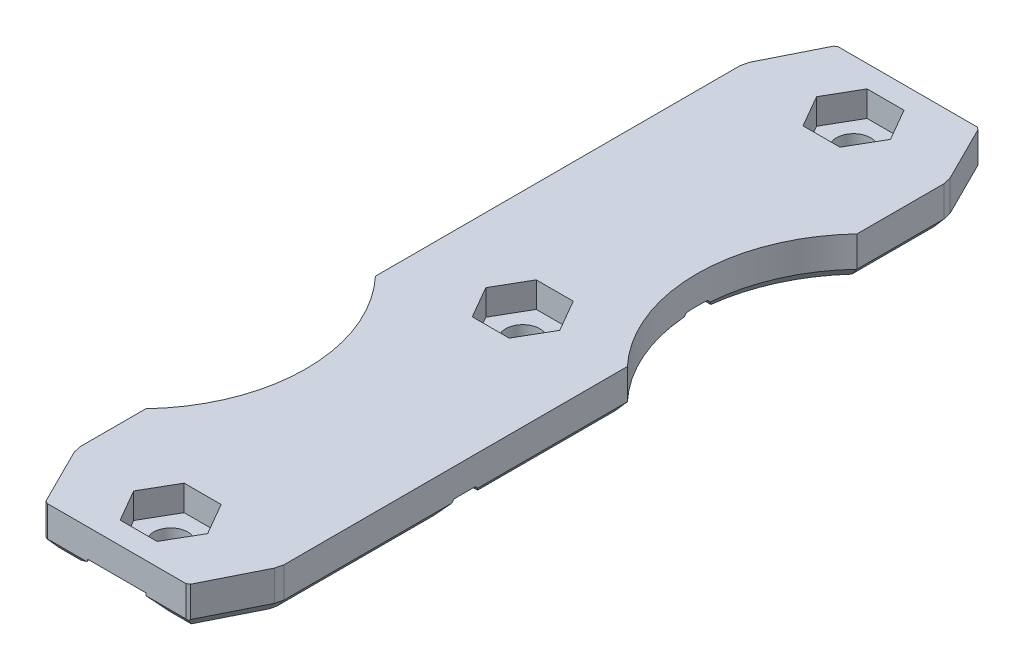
ISO-10303-21;
HEADER;
FILE_DESCRIPTION(('STEP AP214'),'2;1');
FILE_NAME('part.step','',(''),(''),'','','');
FILE_SCHEMA(('AUTOMOTIVE_DESIGN { 1 0 10303 214 1 1 1 1 }'));
ENDSEC;
DATA;
#1=APPLICATION_CONTEXT('core data for automotive mechanical design processes');
#2=APPLICATION_PROTOCOL_DEFINITION('international standard','automotive_design',2000,#1);
#3=PRODUCT_CONTEXT('',#1,'mechanical');
#4=PRODUCT('Part','Part','',(#3));
#5=PRODUCT_RELATED_PRODUCT_CATEGORY('part','',(#4));
#6=PRODUCT_DEFINITION_FORMATION('','',#4);
#7=PRODUCT_DEFINITION_CONTEXT('part definition',#1,'design');
#8=PRODUCT_DEFINITION('design','',#6,#7);
#9=PRODUCT_DEFINITION_SHAPE('','',#8);
#10=(LENGTH_UNIT() NAMED_UNIT(*) SI_UNIT(.MILLI.,.METRE.));
#11=(NAMED_UNIT(*) PLANE_ANGLE_UNIT() SI_UNIT($,.RADIAN.));
#12=(NAMED_UNIT(*) SI_UNIT($,.STERADIAN.) SOLID_ANGLE_UNIT());
#13=UNCERTAINTY_MEASURE_WITH_UNIT(LENGTH_MEASURE(1.E-05),#10,'distance_accuracy_value','');
#14=(GEOMETRIC_REPRESENTATION_CONTEXT(3) GLOBAL_UNCERTAINTY_ASSIGNED_CONTEXT((#13)) GLOBAL_UNIT_ASSIGNED_CONTEXT((#10,
#11,#12)) REPRESENTATION_CONTEXT('',''));
#15=CARTESIAN_POINT('',(0.,0.,0.));
#16=DIRECTION('',(0.,0.,1.));
#17=DIRECTION('',(1.,0.,0.));
#18=AXIS2_PLACEMENT_3D('',#15,#16,#17);
#19=CARTESIAN_POINT('',(-28.186135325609,3.83,75.3051351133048));
#20=DIRECTION('',(0.,-1.,0.));
#21=DIRECTION('',(0.,0.,-1.));
#22=AXIS2_PLACEMENT_3D('',#19,#20,#21);
#23=CYLINDRICAL_SURFACE('',#22,1.60000000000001);
#24=CARTESIAN_POINT('',(-28.186135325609,0.,75.3051351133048));
#25=DIRECTION('',(0.,1.,0.));
#26=DIRECTION('',(0.,0.,-1.));
#27=AXIS2_PLACEMENT_3D('',#24,#25,#26);
#28=CIRCLE('',#27,1.60000000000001);
#29=CARTESIAN_POINT('',(-28.186135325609,0.,73.7051351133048));
#30=VERTEX_POINT('',#29);
#31=EDGE_CURVE('E1136',#30,#30,#28,.T.);
#32=ORIENTED_EDGE('',*,*,#31,.F.);
#33=EDGE_LOOP('',(#32));
#34=FACE_BOUND('',#33,.T.);
#35=CARTESIAN_POINT('',(-28.186135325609,1.43,75.3051351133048));
#36=DIRECTION('',(0.,-1.,0.));
#37=DIRECTION('',(0.,0.,1.));
#38=AXIS2_PLACEMENT_3D('',#35,#36,#37);
#39=CIRCLE('',#38,1.60000000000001);
#40=CARTESIAN_POINT('',(-28.186135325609,1.43,76.9051351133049));
#41=VERTEX_POINT('',#40);
#42=EDGE_CURVE('E40',#41,#41,#39,.F.);
#43=ORIENTED_EDGE('',*,*,#42,.T.);
#44=EDGE_LOOP('',(#43));
#45=FACE_BOUND('',#44,.T.);
#46=ADVANCED_FACE('F36',(#34,#45),#23,.F.);
#47=CARTESIAN_POINT('',(-28.186135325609,3.83,42.3051351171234));
#48=DIRECTION('',(0.,-1.,0.));
#49=DIRECTION('',(0.,0.,-1.));
#50=AXIS2_PLACEMENT_3D('',#47,#48,#49);
#51=CYLINDRICAL_SURFACE('',#50,1.6);
#52=CARTESIAN_POINT('',(-28.186135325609,0.,42.3051351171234));
#53=DIRECTION('',(0.,1.,0.));
#54=DIRECTION('',(0.,0.,-1.));
#55=AXIS2_PLACEMENT_3D('',#52,#53,#54);
#56=CIRCLE('',#55,1.6);
#57=CARTESIAN_POINT('',(-28.186135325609,0.,40.7051351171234));
#58=VERTEX_POINT('',#57);
#59=EDGE_CURVE('E1133',#58,#58,#56,.T.);
#60=ORIENTED_EDGE('',*,*,#59,.F.);
#61=EDGE_LOOP('',(#60));
#62=FACE_BOUND('',#61,.T.);
#63=CARTESIAN_POINT('',(-28.186135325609,1.43,42.3051351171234));
#64=DIRECTION('',(0.,-1.,0.));
#65=DIRECTION('',(0.,0.,1.));
#66=AXIS2_PLACEMENT_3D('',#63,#64,#65);
#67=CIRCLE('',#66,1.6);
#68=CARTESIAN_POINT('',(-28.186135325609,1.43,43.9051351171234));
#69=VERTEX_POINT('',#68);
#70=EDGE_CURVE('E2923',#69,#69,#67,.F.);
#71=ORIENTED_EDGE('',*,*,#70,.T.);
#72=EDGE_LOOP('',(#71));
#73=FACE_BOUND('',#72,.T.);
#74=ADVANCED_FACE('F1627',(#62,#73),#51,.F.);
#75=CARTESIAN_POINT('',(-28.186135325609,3.83,11.3051351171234));
#76=DIRECTION('',(0.,-1.,0.));
#77=DIRECTION('',(0.,0.,-1.));
#78=AXIS2_PLACEMENT_3D('',#75,#76,#77);
#79=CYLINDRICAL_SURFACE('',#78,1.60000000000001);
#80=CARTESIAN_POINT('',(-28.186135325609,0.,11.3051351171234));
#81=DIRECTION('',(0.,1.,0.));
#82=DIRECTION('',(0.,0.,-1.));
#83=AXIS2_PLACEMENT_3D('',#80,#81,#82);
#84=CIRCLE('',#83,1.60000000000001);
#85=CARTESIAN_POINT('',(-28.186135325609,0.,9.7051351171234));
#86=VERTEX_POINT('',#85);
#87=EDGE_CURVE('E1129',#86,#86,#84,.T.);
#88=ORIENTED_EDGE('',*,*,#87,.F.);
#89=EDGE_LOOP('',(#88));
#90=FACE_BOUND('',#89,.T.);
#91=CARTESIAN_POINT('',(-28.186135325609,1.43,11.3051351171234));
#92=DIRECTION('',(0.,-1.,0.));
#93=DIRECTION('',(0.,0.,1.));
#94=AXIS2_PLACEMENT_3D('',#91,#92,#93);
#95=CIRCLE('',#94,1.60000000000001);
#96=CARTESIAN_POINT('',(-28.186135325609,1.43,12.9051351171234));
#97=VERTEX_POINT('',#96);
#98=EDGE_CURVE('E905',#97,#97,#95,.F.);
#99=ORIENTED_EDGE('',*,*,#98,.T.);
#100=EDGE_LOOP('',(#99));
#101=FACE_BOUND('',#100,.T.);
#102=ADVANCED_FACE('F1531',(#90,#101),#79,.F.);
#103=CARTESIAN_POINT('',(-7.18613532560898,3.83,31.3051351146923));
#104=DIRECTION('',(0.,1.,0.));
#105=DIRECTION('',(0.,0.,1.));
#106=AXIS2_PLACEMENT_3D('',#103,#104,#105);
#107=PLANE('',#106);
#108=DIRECTION('',(0.5,0.,0.866025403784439));
#109=VECTOR('',#108,1.);
#110=CARTESIAN_POINT('',(-26.4540845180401,3.83,8.30513511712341));
#111=LINE('',#110,#109);
#112=CARTESIAN_POINT('',(-26.4540845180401,3.83,8.30513511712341));
#113=VERTEX_POINT('',#112);
#114=CARTESIAN_POINT('',(-24.7220337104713,3.83,11.3051351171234));
#115=VERTEX_POINT('',#114);
#116=EDGE_CURVE('E840',#113,#115,#111,.T.);
#117=ORIENTED_EDGE('',*,*,#116,.T.);
#118=DIRECTION('',(-0.500000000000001,0.,0.866025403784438));
#119=VECTOR('',#118,1.);
#120=CARTESIAN_POINT('',(-24.7220337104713,3.83,11.3051351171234));
#121=LINE('',#120,#119);
#122=CARTESIAN_POINT('',(-26.4540845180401,3.83,14.3051351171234));
#123=VERTEX_POINT('',#122);
#124=EDGE_CURVE('E843',#115,#123,#121,.T.);
#125=ORIENTED_EDGE('',*,*,#124,.T.);
#126=DIRECTION('',(-1.,0.,0.));
#127=VECTOR('',#126,1.);
#128=CARTESIAN_POINT('',(-26.4540845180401,3.83,14.3051351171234));
#129=LINE('',#128,#127);
#130=CARTESIAN_POINT('',(-29.9181861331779,3.83,14.3051351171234));
#131=VERTEX_POINT('',#130);
#132=EDGE_CURVE('E846',#123,#131,#129,.T.);
#133=ORIENTED_EDGE('',*,*,#132,.T.);
#134=DIRECTION('',(-0.499999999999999,0.,-0.866025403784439));
#135=VECTOR('',#134,1.);
#136=CARTESIAN_POINT('',(-29.9181861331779,3.83,14.3051351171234));
#137=LINE('',#136,#135);
#138=CARTESIAN_POINT('',(-31.6502369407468,3.83,11.3051351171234));
#139=VERTEX_POINT('',#138);
#140=EDGE_CURVE('E849',#131,#139,#137,.T.);
#141=ORIENTED_EDGE('',*,*,#140,.T.);
#142=DIRECTION('',(0.5,0.,-0.866025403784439));
#143=VECTOR('',#142,1.);
#144=CARTESIAN_POINT('',(-31.6502369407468,3.83,11.3051351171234));
#145=LINE('',#144,#143);
#146=CARTESIAN_POINT('',(-29.9181861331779,3.83,8.30513511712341));
#147=VERTEX_POINT('',#146);
#148=EDGE_CURVE('E852',#139,#147,#145,.T.);
#149=ORIENTED_EDGE('',*,*,#148,.T.);
#150=DIRECTION('',(1.,0.,0.));
#151=VECTOR('',#150,1.);
#152=CARTESIAN_POINT('',(-29.9181861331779,3.83,8.30513511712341));
#153=LINE('',#152,#151);
#154=EDGE_CURVE('E825',#147,#113,#153,.T.);
#155=ORIENTED_EDGE('',*,*,#154,.T.);
#156=EDGE_LOOP('',(#117,#125,#133,#141,#149,#155));
#157=FACE_BOUND('',#156,.T.);
#158=DIRECTION('',(0.500000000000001,0.,0.866025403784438));
#159=VECTOR('',#158,1.);
#160=CARTESIAN_POINT('',(-26.4540845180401,3.83,72.3051351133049));
#161=LINE('',#160,#159);
#162=CARTESIAN_POINT('',(-26.4540845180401,3.83,72.3051351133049));
#163=VERTEX_POINT('',#162);
#164=CARTESIAN_POINT('',(-24.7220337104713,3.83,75.3051351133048));
#165=VERTEX_POINT('',#164);
#166=EDGE_CURVE('E801',#163,#165,#161,.T.);
#167=ORIENTED_EDGE('',*,*,#166,.T.);
#168=DIRECTION('',(-0.5,0.,0.866025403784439));
#169=VECTOR('',#168,1.);
#170=CARTESIAN_POINT('',(-24.7220337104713,3.83,75.3051351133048));
#171=LINE('',#170,#169);
#172=CARTESIAN_POINT('',(-26.4540845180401,3.83,78.3051351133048));
#173=VERTEX_POINT('',#172);
#174=EDGE_CURVE('E769',#165,#173,#171,.T.);
#175=ORIENTED_EDGE('',*,*,#174,.T.);
#176=DIRECTION('',(-1.,0.,0.));
#177=VECTOR('',#176,1.);
#178=CARTESIAN_POINT('',(-26.4540845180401,3.83,78.3051351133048));
#179=LINE('',#178,#177);
#180=CARTESIAN_POINT('',(-29.9181861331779,3.83,78.3051351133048));
#181=VERTEX_POINT('',#180);
#182=EDGE_CURVE('E805',#173,#181,#179,.T.);
#183=ORIENTED_EDGE('',*,*,#182,.T.);
#184=DIRECTION('',(-0.500000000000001,0.,-0.866025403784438));
#185=VECTOR('',#184,1.);
#186=CARTESIAN_POINT('',(-29.9181861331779,3.83,78.3051351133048));
#187=LINE('',#186,#185);
#188=CARTESIAN_POINT('',(-31.6502369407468,3.83,75.3051351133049));
#189=VERTEX_POINT('',#188);
#190=EDGE_CURVE('E808',#181,#189,#187,.T.);
#191=ORIENTED_EDGE('',*,*,#190,.T.);
#192=DIRECTION('',(0.499999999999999,0.,-0.866025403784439));
#193=VECTOR('',#192,1.);
#194=CARTESIAN_POINT('',(-31.6502369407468,3.83,75.3051351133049));
#195=LINE('',#194,#193);
#196=CARTESIAN_POINT('',(-29.9181861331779,3.83,72.3051351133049));
#197=VERTEX_POINT('',#196);
#198=EDGE_CURVE('E790',#189,#197,#195,.T.);
#199=ORIENTED_EDGE('',*,*,#198,.T.);
#200=DIRECTION('',(1.,0.,0.));
#201=VECTOR('',#200,1.);
#202=CARTESIAN_POINT('',(-29.9181861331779,3.83,72.3051351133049));
#203=LINE('',#202,#201);
#204=EDGE_CURVE('E787',#197,#163,#203,.T.);
#205=ORIENTED_EDGE('',*,*,#204,.T.);
#206=EDGE_LOOP('',(#167,#175,#183,#191,#199,#205));
#207=FACE_BOUND('',#206,.T.);
#208=DIRECTION('',(0.5,0.,0.866025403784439));
#209=VECTOR('',#208,1.);
#210=CARTESIAN_POINT('',(-26.4540845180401,3.83,39.3051351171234));
#211=LINE('',#210,#209);
#212=CARTESIAN_POINT('',(-26.4540845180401,3.83,39.3051351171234));
#213=VERTEX_POINT('',#212);
#214=CARTESIAN_POINT('',(-24.7220337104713,3.83,42.3051351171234));
#215=VERTEX_POINT('',#214);
#216=EDGE_CURVE('E814',#213,#215,#211,.T.);
#217=ORIENTED_EDGE('',*,*,#216,.T.);
#218=DIRECTION('',(-0.500000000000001,0.,0.866025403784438));
#219=VECTOR('',#218,1.);
#220=CARTESIAN_POINT('',(-24.7220337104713,3.83,42.3051351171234));
#221=LINE('',#220,#219);
#222=CARTESIAN_POINT('',(-26.4540845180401,3.83,45.3051351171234));
#223=VERTEX_POINT('',#222);
#224=EDGE_CURVE('E889',#215,#223,#221,.T.);
#225=ORIENTED_EDGE('',*,*,#224,.T.);
#226=DIRECTION('',(-1.,0.,0.));
#227=VECTOR('',#226,1.);
#228=CARTESIAN_POINT('',(-26.4540845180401,3.83,45.3051351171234));
#229=LINE('',#228,#227);
#230=CARTESIAN_POINT('',(-29.9181861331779,3.83,45.3051351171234));
#231=VERTEX_POINT('',#230);
#232=EDGE_CURVE('E892',#223,#231,#229,.T.);
#233=ORIENTED_EDGE('',*,*,#232,.T.);
#234=DIRECTION('',(-0.5,0.,-0.866025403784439));
#235=VECTOR('',#234,1.);
#236=CARTESIAN_POINT('',(-29.9181861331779,3.83,45.3051351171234));
#237=LINE('',#236,#235);
#238=CARTESIAN_POINT('',(-31.6502369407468,3.83,42.3051351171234));
#239=VERTEX_POINT('',#238);
#240=EDGE_CURVE('E895',#231,#239,#237,.T.);
#241=ORIENTED_EDGE('',*,*,#240,.T.);
#242=DIRECTION('',(0.499999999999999,0.,-0.866025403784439));
#243=VECTOR('',#242,1.);
#244=CARTESIAN_POINT('',(-31.6502369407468,3.83,42.3051351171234));
#245=LINE('',#244,#243);
#246=CARTESIAN_POINT('',(-29.9181861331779,3.83,39.3051351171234));
#247=VERTEX_POINT('',#246);
#248=EDGE_CURVE('E898',#239,#247,#245,.T.);
#249=ORIENTED_EDGE('',*,*,#248,.T.);
#250=DIRECTION('',(1.,0.,0.));
#251=VECTOR('',#250,1.);
#252=CARTESIAN_POINT('',(-29.9181861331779,3.83,39.3051351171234));
#253=LINE('',#252,#251);
#254=EDGE_CURVE('E871',#247,#213,#253,.T.);
#255=ORIENTED_EDGE('',*,*,#254,.T.);
#256=EDGE_LOOP('',(#217,#225,#233,#241,#249,#255));
#257=FACE_BOUND('',#256,.T.);
#258=DIRECTION('',(0.447213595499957,0.,0.894427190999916));
#259=VECTOR('',#258,1.);
#260=CARTESIAN_POINT('',(-21.4093191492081,3.83,6.41503238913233));
#261=LINE('',#260,#259);
#262=CARTESIAN_POINT('',(-21.4093191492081,3.83,6.41503238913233));
#263=VERTEX_POINT('',#262);
#264=CARTESIAN_POINT('',(-18.782031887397,3.83,11.6696069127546));
#265=VERTEX_POINT('',#264);
#266=EDGE_CURVE('E972',#263,#265,#261,.T.);
#267=ORIENTED_EDGE('',*,*,#266,.F.);
#268=DIRECTION('',(0.81673959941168,0.,0.577006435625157));
#269=VECTOR('',#268,1.);
#270=CARTESIAN_POINT('',(-21.6610568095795,3.83,6.23718592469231));
#271=LINE('',#270,#269);
#272=CARTESIAN_POINT('',(-21.6610568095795,3.83,6.23718592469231));
#273=VERTEX_POINT('',#272);
#274=EDGE_CURVE('E969',#273,#263,#271,.T.);
#275=ORIENTED_EDGE('',*,*,#274,.F.);
#276=DIRECTION('',(1.,0.,0.));
#277=VECTOR('',#276,1.);
#278=CARTESIAN_POINT('',(-34.7112138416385,3.83,6.23718592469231));
#279=LINE('',#278,#277);
#280=CARTESIAN_POINT('',(-34.7112138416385,3.83,6.23718592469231));
#281=VERTEX_POINT('',#280);
#282=EDGE_CURVE('E966',#281,#273,#279,.T.);
#283=ORIENTED_EDGE('',*,*,#282,.F.);
#284=DIRECTION('',(0.81673959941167,0.,-0.577006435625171));
#285=VECTOR('',#284,1.);
#286=CARTESIAN_POINT('',(-34.9629515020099,3.83,6.41503238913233));
#287=LINE('',#286,#285);
#288=CARTESIAN_POINT('',(-34.9629515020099,3.83,6.41503238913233));
#289=VERTEX_POINT('',#288);
#290=EDGE_CURVE('E963',#289,#281,#287,.T.);
#291=ORIENTED_EDGE('',*,*,#290,.F.);
#292=DIRECTION('',(0.447213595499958,0.,-0.894427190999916));
#293=VECTOR('',#292,1.);
#294=CARTESIAN_POINT('',(-37.590238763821,3.83,11.6696069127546));
#295=LINE('',#294,#293);
#296=CARTESIAN_POINT('',(-37.590238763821,3.83,11.6696069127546));
#297=VERTEX_POINT('',#296);
#298=EDGE_CURVE('E960',#297,#289,#295,.T.);
#299=ORIENTED_EDGE('',*,*,#298,.F.);
#300=DIRECTION('',(0.21940772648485,0.,-0.975633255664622));
#301=VECTOR('',#300,1.);
#302=CARTESIAN_POINT('',(-37.7540845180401,3.83,12.3981745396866));
#303=LINE('',#302,#301);
#304=CARTESIAN_POINT('',(-37.7540845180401,3.83,12.3981745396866));
#305=VERTEX_POINT('',#304);
#306=EDGE_CURVE('E957',#305,#297,#303,.T.);
#307=ORIENTED_EDGE('',*,*,#306,.F.);
#308=DIRECTION('',(0.,0.,-1.));
#309=VECTOR('',#308,1.);
#310=CARTESIAN_POINT('',(-37.7540845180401,3.83,46.5441772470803));
#311=LINE('',#310,#309);
#312=CARTESIAN_POINT('',(-37.7540845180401,3.83,46.5441772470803));
#313=VERTEX_POINT('',#312);
#314=EDGE_CURVE('E954',#313,#305,#311,.T.);
#315=ORIENTED_EDGE('',*,*,#314,.F.);
#316=CARTESIAN_POINT('',(-49.186135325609,3.83,57.3051351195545));
#317=DIRECTION('',(0.,1.,0.));
#318=DIRECTION('',(0.,0.,1.));
#319=AXIS2_PLACEMENT_3D('',#316,#317,#318);
#320=CIRCLE('',#319,15.7);
#321=CARTESIAN_POINT('',(-37.7540845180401,3.83,68.0660929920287));
#322=VERTEX_POINT('',#321);
#323=EDGE_CURVE('E951',#322,#313,#320,.T.);
#324=ORIENTED_EDGE('',*,*,#323,.F.);
#325=DIRECTION('',(0.,0.,-1.));
#326=VECTOR('',#325,1.);
#327=CARTESIAN_POINT('',(-37.7540845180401,3.83,74.2466015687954));
#328=LINE('',#327,#326);
#329=CARTESIAN_POINT('',(-37.7540845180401,3.83,74.2466015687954));
#330=VERTEX_POINT('',#329);
#331=EDGE_CURVE('E948',#330,#322,#328,.T.);
#332=ORIENTED_EDGE('',*,*,#331,.F.);
#333=DIRECTION('',(-0.240072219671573,0.,-0.970755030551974));
#334=VECTOR('',#333,1.);
#335=CARTESIAN_POINT('',(-37.5748072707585,3.83,74.9715263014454));
#336=LINE('',#335,#334);
#337=CARTESIAN_POINT('',(-37.5748072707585,3.83,74.9715263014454));
#338=VERTEX_POINT('',#337);
#339=EDGE_CURVE('E945',#338,#330,#336,.T.);
#340=ORIENTED_EDGE('',*,*,#339,.F.);
#341=DIRECTION('',(-0.447213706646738,0.,-0.894427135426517));
#342=VECTOR('',#341,1.);
#343=CARTESIAN_POINT('',(-34.9468403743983,3.83,80.2274584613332));
#344=LINE('',#343,#342);
#345=CARTESIAN_POINT('',(-34.9468403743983,3.83,80.2274584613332));
#346=VERTEX_POINT('',#345);
#347=EDGE_CURVE('E942',#346,#338,#344,.T.);
#348=ORIENTED_EDGE('',*,*,#347,.F.);
#349=DIRECTION('',(-0.881346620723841,0.,-0.472470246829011));
#350=VECTOR('',#349,1.);
#351=CARTESIAN_POINT('',(-34.6751897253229,3.83,80.3730843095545));
#352=LINE('',#351,#350);
#353=CARTESIAN_POINT('',(-34.6751897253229,3.83,80.3730843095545));
#354=VERTEX_POINT('',#353);
#355=EDGE_CURVE('E939',#354,#346,#352,.T.);
#356=ORIENTED_EDGE('',*,*,#355,.F.);
#357=DIRECTION('',(-1.,0.,0.));
#358=VECTOR('',#357,1.);
#359=CARTESIAN_POINT('',(-21.6970807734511,3.83,80.3730843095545));
#360=LINE('',#359,#358);
#361=CARTESIAN_POINT('',(-21.6970807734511,3.83,80.3730843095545));
#362=VERTEX_POINT('',#361);
#363=EDGE_CURVE('E936',#362,#354,#360,.T.);
#364=ORIENTED_EDGE('',*,*,#363,.F.);
#365=DIRECTION('',(-0.881347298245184,0.,0.47246898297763));
#366=VECTOR('',#365,1.);
#367=CARTESIAN_POINT('',(-21.4254295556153,3.83,80.2274586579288));
#368=LINE('',#367,#366);
#369=CARTESIAN_POINT('',(-21.4254295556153,3.83,80.2274586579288));
#370=VERTEX_POINT('',#369);
#371=EDGE_CURVE('E933',#370,#362,#368,.T.);
#372=ORIENTED_EDGE('',*,*,#371,.F.);
#373=DIRECTION('',(-0.447213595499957,0.,0.894427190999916));
#374=VECTOR('',#373,1.);
#375=CARTESIAN_POINT('',(-18.7974633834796,3.83,74.9715263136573));
#376=LINE('',#375,#374);
#377=CARTESIAN_POINT('',(-18.7974633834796,3.83,74.9715263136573));
#378=VERTEX_POINT('',#377);
#379=EDGE_CURVE('E930',#378,#370,#376,.T.);
#380=ORIENTED_EDGE('',*,*,#379,.F.);
#381=DIRECTION('',(-0.240072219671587,0.,0.97075503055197));
#382=VECTOR('',#381,1.);
#383=CARTESIAN_POINT('',(-18.6181861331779,3.83,74.2466015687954));
#384=LINE('',#383,#382);
#385=CARTESIAN_POINT('',(-18.6181861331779,3.83,74.2466015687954));
#386=VERTEX_POINT('',#385);
#387=EDGE_CURVE('E927',#386,#378,#384,.T.);
#388=ORIENTED_EDGE('',*,*,#387,.F.);
#389=DIRECTION('',(0.,0.,1.));
#390=VECTOR('',#389,1.);
#391=CARTESIAN_POINT('',(-18.6181861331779,3.83,42.0660929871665));
#392=LINE('',#391,#390);
#393=CARTESIAN_POINT('',(-18.6181861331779,3.83,42.0660929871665));
#394=VERTEX_POINT('',#393);
#395=EDGE_CURVE('E924',#394,#386,#392,.T.);
#396=ORIENTED_EDGE('',*,*,#395,.F.);
#397=CARTESIAN_POINT('',(-7.18613532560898,3.83,31.3051351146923));
#398=DIRECTION('',(0.,1.,0.));
#399=DIRECTION('',(0.,0.,1.));
#400=AXIS2_PLACEMENT_3D('',#397,#398,#399);
#401=CIRCLE('',#400,15.7);
#402=CARTESIAN_POINT('',(-18.6181861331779,3.83,20.5441772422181));
#403=VERTEX_POINT('',#402);
#404=EDGE_CURVE('E921',#403,#394,#401,.T.);
#405=ORIENTED_EDGE('',*,*,#404,.F.);
#406=DIRECTION('',(0.,0.,1.));
#407=VECTOR('',#406,1.);
#408=CARTESIAN_POINT('',(-18.6181861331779,3.83,12.3981745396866));
#409=LINE('',#408,#407);
#410=CARTESIAN_POINT('',(-18.6181861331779,3.83,12.3981745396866));
#411=VERTEX_POINT('',#410);
#412=EDGE_CURVE('E918',#411,#403,#409,.T.);
#413=ORIENTED_EDGE('',*,*,#412,.F.);
#414=DIRECTION('',(0.219407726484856,0.,0.97563325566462));
#415=VECTOR('',#414,1.);
#416=CARTESIAN_POINT('',(-18.782031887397,3.83,11.6696069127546));
#417=LINE('',#416,#415);
#418=EDGE_CURVE('E915',#265,#411,#417,.T.);
#419=ORIENTED_EDGE('',*,*,#418,.F.);
#420=EDGE_LOOP('',(#267,#275,#283,#291,#299,#307,#315,#324,#332,#340,#348,#356,#364,#372,#380,
#388,#396,#405,#413,#419));
#421=FACE_BOUND('',#420,.T.);
#422=ADVANCED_FACE('F1527',(#157,#207,#257,#421),#107,.T.);
#423=CARTESIAN_POINT('',(-30.9285491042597,1.2,0.));
#424=DIRECTION('',(1.,0.,0.));
#425=DIRECTION('',(0.,0.,1.));
#426=AXIS2_PLACEMENT_3D('',#423,#424,#425);
#427=PLANE('',#426);
#428=DIRECTION('',(0.,0.,-1.));
#429=VECTOR('',#428,1.);
#430=CARTESIAN_POINT('',(-30.9285491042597,1.2,0.));
#431=LINE('',#430,#429);
#432=CARTESIAN_POINT('',(-30.9285491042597,1.2,6.55513511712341));
#433=VERTEX_POINT('',#432);
#434=CARTESIAN_POINT('',(-30.9285491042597,1.2,6.23718592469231));
#435=VERTEX_POINT('',#434);
#436=EDGE_CURVE('E1297',#433,#435,#431,.T.);
#437=ORIENTED_EDGE('',*,*,#436,.F.);
#438=DIRECTION('',(0.,-0.511888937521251,-0.859051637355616));
#439=VECTOR('',#438,1.);
#440=CARTESIAN_POINT('',(-30.9285491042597,-1.68254875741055,1.71764391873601));
#441=LINE('',#440,#439);
#442=CARTESIAN_POINT('',(-30.9285491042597,1.01054145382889,6.23718592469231));
#443=VERTEX_POINT('',#442);
#444=EDGE_CURVE('E1490',#443,#433,#441,.F.);
#445=ORIENTED_EDGE('',*,*,#444,.F.);
#446=DIRECTION('',(0.,-1.,0.));
#447=VECTOR('',#446,1.);
#448=CARTESIAN_POINT('',(-30.9285491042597,1.2,6.23718592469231));
#449=LINE('',#448,#447);
#450=EDGE_CURVE('E1056',#435,#443,#449,.T.);
#451=ORIENTED_EDGE('',*,*,#450,.F.);
#452=EDGE_LOOP('',(#437,#445,#451));
#453=FACE_BOUND('',#452,.T.);
#454=ADVANCED_FACE('F1530',(#453),#427,.T.);
#455=CARTESIAN_POINT('',(-25.4437215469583,1.2,0.));
#456=DIRECTION('',(-1.,0.,0.));
#457=DIRECTION('',(0.,0.,-1.));
#458=AXIS2_PLACEMENT_3D('',#455,#456,#457);
#459=PLANE('',#458);
#460=DIRECTION('',(0.,0.511888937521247,0.859051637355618));
#461=VECTOR('',#460,1.);
#462=CARTESIAN_POINT('',(-25.4437215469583,-1.68254875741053,1.71764391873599));
#463=LINE('',#462,#461);
#464=CARTESIAN_POINT('',(-25.4437215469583,1.2,6.55513511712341));
#465=VERTEX_POINT('',#464);
#466=CARTESIAN_POINT('',(-25.4437215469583,1.0105414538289,6.23718592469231));
#467=VERTEX_POINT('',#466);
#468=EDGE_CURVE('E2981',#465,#467,#463,.F.);
#469=ORIENTED_EDGE('',*,*,#468,.F.);
#470=DIRECTION('',(0.,0.,1.));
#471=VECTOR('',#470,1.);
#472=CARTESIAN_POINT('',(-25.4437215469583,1.2,0.));
#473=LINE('',#472,#471);
#474=CARTESIAN_POINT('',(-25.4437215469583,1.2,6.23718592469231));
#475=VERTEX_POINT('',#474);
#476=EDGE_CURVE('E1294',#475,#465,#473,.T.);
#477=ORIENTED_EDGE('',*,*,#476,.F.);
#478=DIRECTION('',(0.,1.,0.));
#479=VECTOR('',#478,1.);
#480=CARTESIAN_POINT('',(-25.4437215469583,1.2,6.23718592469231));
#481=LINE('',#480,#479);
#482=EDGE_CURVE('E1051',#467,#475,#481,.T.);
#483=ORIENTED_EDGE('',*,*,#482,.F.);
#484=EDGE_LOOP('',(#469,#477,#483));
#485=FACE_BOUND('',#484,.T.);
#486=ADVANCED_FACE('F1613',(#485),#459,.T.);
#487=CARTESIAN_POINT('',(-25.4437215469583,1.2,0.));
#488=DIRECTION('',(-1.,0.,0.));
#489=DIRECTION('',(0.,0.,-1.));
#490=AXIS2_PLACEMENT_3D('',#487,#488,#489);
#491=PLANE('',#490);
#492=DIRECTION('',(0.,0.,1.));
#493=VECTOR('',#492,1.);
#494=CARTESIAN_POINT('',(-25.4437215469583,1.2,0.));
#495=LINE('',#494,#493);
#496=CARTESIAN_POINT('',(-25.4437215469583,1.2,80.0551351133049));
#497=VERTEX_POINT('',#496);
#498=CARTESIAN_POINT('',(-25.4437215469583,1.2,80.3730843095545));
#499=VERTEX_POINT('',#498);
#500=EDGE_CURVE('E1240',#497,#499,#495,.T.);
#501=ORIENTED_EDGE('',*,*,#500,.F.);
#502=DIRECTION('',(0.,-0.511888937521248,0.859051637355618));
#503=VECTOR('',#502,1.);
#504=CARTESIAN_POINT('',(-25.4437215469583,36.4033674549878,20.9768698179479));
#505=LINE('',#504,#503);
#506=CARTESIAN_POINT('',(-25.4437215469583,1.0105414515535,80.3730843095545));
#507=VERTEX_POINT('',#506);
#508=EDGE_CURVE('E2840',#507,#497,#505,.F.);
#509=ORIENTED_EDGE('',*,*,#508,.F.);
#510=DIRECTION('',(0.,-1.,0.));
#511=VECTOR('',#510,1.);
#512=CARTESIAN_POINT('',(-25.4437215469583,1.2,80.3730843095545));
#513=LINE('',#512,#511);
#514=EDGE_CURVE('E1037',#499,#507,#513,.T.);
#515=ORIENTED_EDGE('',*,*,#514,.F.);
#516=EDGE_LOOP('',(#501,#509,#515));
#517=FACE_BOUND('',#516,.T.);
#518=ADVANCED_FACE('F1609',(#517),#491,.T.);
#519=CARTESIAN_POINT('',(-30.9285491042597,1.2,0.));
#520=DIRECTION('',(1.,0.,0.));
#521=DIRECTION('',(0.,0.,1.));
#522=AXIS2_PLACEMENT_3D('',#519,#520,#521);
#523=PLANE('',#522);
#524=DIRECTION('',(0.,0.511888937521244,-0.85905163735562));
#525=VECTOR('',#524,1.);
#526=CARTESIAN_POINT('',(-30.9285491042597,36.4033674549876,20.9768698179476));
#527=LINE('',#526,#525);
#528=CARTESIAN_POINT('',(-30.9285491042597,1.2,80.0551351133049));
#529=VERTEX_POINT('',#528);
#530=CARTESIAN_POINT('',(-30.9285491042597,1.01054145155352,80.3730843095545));
#531=VERTEX_POINT('',#530);
#532=EDGE_CURVE('E1465',#529,#531,#527,.F.);
#533=ORIENTED_EDGE('',*,*,#532,.F.);
#534=DIRECTION('',(0.,0.,-1.));
#535=VECTOR('',#534,1.);
#536=CARTESIAN_POINT('',(-30.9285491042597,1.2,0.));
#537=LINE('',#536,#535);
#538=CARTESIAN_POINT('',(-30.9285491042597,1.2,80.3730843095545));
#539=VERTEX_POINT('',#538);
#540=EDGE_CURVE('E1237',#539,#529,#537,.T.);
#541=ORIENTED_EDGE('',*,*,#540,.F.);
#542=DIRECTION('',(0.,1.,0.));
#543=VECTOR('',#542,1.);
#544=CARTESIAN_POINT('',(-30.9285491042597,1.2,80.3730843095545));
#545=LINE('',#544,#543);
#546=EDGE_CURVE('E1042',#531,#539,#545,.T.);
#547=ORIENTED_EDGE('',*,*,#546,.F.);
#548=EDGE_LOOP('',(#533,#541,#547));
#549=FACE_BOUND('',#548,.T.);
#550=ADVANCED_FACE('F1605',(#549),#523,.T.);
#551=CARTESIAN_POINT('',(0.,1.2,32.3051351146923));
#552=DIRECTION('',(0.,0.642787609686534,0.766044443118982));
#553=DIRECTION('',(1.,0.,0.));
#554=AXIS2_PLACEMENT_3D('',#551,#552,#553);
#555=PLANE('',#554);
#556=DIRECTION('',(1.,0.,0.));
#557=VECTOR('',#556,1.);
#558=CARTESIAN_POINT('',(0.,1.2,32.3051351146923));
#559=LINE('',#558,#557);
#560=CARTESIAN_POINT('',(-37.7540845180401,1.2,32.3051351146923));
#561=VERTEX_POINT('',#560);
#562=CARTESIAN_POINT('',(-29.186135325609,1.2,32.3051351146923));
#563=VERTEX_POINT('',#562);
#564=EDGE_CURVE('E1200',#561,#563,#559,.T.);
#565=ORIENTED_EDGE('',*,*,#564,.T.);
#566=DIRECTION('',(-0.540716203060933,-0.644400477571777,0.540716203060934));
#567=VECTOR('',#566,1.);
#568=CARTESIAN_POINT('',(-19.740953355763,12.4563295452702,22.8599531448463));
#569=LINE('',#568,#567);
#570=CARTESIAN_POINT('',(-30.1930548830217,0.,33.312054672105));
#571=VERTEX_POINT('',#570);
#572=EDGE_CURVE('E3195',#571,#563,#569,.F.);
#573=ORIENTED_EDGE('',*,*,#572,.F.);
#574=DIRECTION('',(-1.,0.,0.));
#575=VECTOR('',#574,1.);
#576=CARTESIAN_POINT('',(-7.18613532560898,0.,33.312054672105));
#577=LINE('',#576,#575);
#578=CARTESIAN_POINT('',(-36.9471649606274,0.,33.312054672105));
#579=VERTEX_POINT('',#578);
#580=EDGE_CURVE('E1429',#571,#579,#577,.T.);
#581=ORIENTED_EDGE('',*,*,#580,.T.);
#582=DIRECTION('',(0.540716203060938,-0.644400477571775,0.540716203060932));
#583=VECTOR('',#582,1.);
#584=CARTESIAN_POINT('',(-26.857296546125,-12.0246369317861,43.4019230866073));
#585=LINE('',#584,#583);
#586=CARTESIAN_POINT('',(-37.7540845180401,0.961649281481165,32.5051351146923));
#587=VERTEX_POINT('',#586);
#588=EDGE_CURVE('E3196',#579,#587,#585,.F.);
#589=ORIENTED_EDGE('',*,*,#588,.T.);
#590=DIRECTION('',(0.,0.766044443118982,-0.642787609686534));
#591=VECTOR('',#590,1.);
#592=CARTESIAN_POINT('',(-37.7540845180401,1.2,32.3051351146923));
#593=LINE('',#592,#591);
#594=EDGE_CURVE('E1100',#561,#587,#593,.F.);
#595=ORIENTED_EDGE('',*,*,#594,.F.);
#596=EDGE_LOOP('',(#565,#573,#581,#589,#595));
#597=FACE_BOUND('',#596,.T.);
#598=ADVANCED_FACE('F1608',(#597),#555,.F.);
#599=CARTESIAN_POINT('',(-49.186135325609,1.19999999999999,57.3051351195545));
#600=DIRECTION('',(0.,-1.,0.));
#601=DIRECTION('',(0.,0.,-1.));
#602=AXIS2_PLACEMENT_3D('',#599,#600,#601);
#603=CONICAL_SURFACE('',#602,15.5,0.698131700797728);
#604=CARTESIAN_POINT('',(-37.9540845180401,1.19999999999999,46.6237946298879));
#605=CARTESIAN_POINT('',(-37.7864467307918,1.00021706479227,46.556832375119));
#606=CARTESIAN_POINT('',(-37.6187178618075,0.800325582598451,46.4904320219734));
#607=CARTESIAN_POINT('',(-37.2830780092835,0.40032558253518,46.3587551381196));
#608=CARTESIAN_POINT('',(-37.1151670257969,0.200217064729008,46.2934786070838));
#609=CARTESIAN_POINT('',(-36.9471649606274,0.,46.2287639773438));
#610=B_SPLINE_CURVE_WITH_KNOTS('',3,(#604,#605,#606,#607,#608,#609),.UNSPECIFIED.,.F.,.F.,(4,2,
4),(0.,0.807766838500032,1.6155334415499),.UNSPECIFIED.);
#611=CARTESIAN_POINT('',(-36.9471649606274,0.,46.2287639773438));
#612=VERTEX_POINT('',#611);
#613=CARTESIAN_POINT('',(-37.7540845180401,0.96164928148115,46.5441772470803));
#614=VERTEX_POINT('',#613);
#615=EDGE_CURVE('E1494',#612,#614,#610,.F.);
#616=ORIENTED_EDGE('',*,*,#615,.F.);
#617=CARTESIAN_POINT('',(-49.186135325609,0.,57.3051351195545));
#618=DIRECTION('',(0.,-1.,0.));
#619=DIRECTION('',(0.,0.,1.));
#620=AXIS2_PLACEMENT_3D('',#617,#618,#619);
#621=CIRCLE('',#620,16.5069195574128);
#622=CARTESIAN_POINT('',(-32.8016711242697,0.,55.2982155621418));
#623=VERTEX_POINT('',#622);
#624=EDGE_CURVE('E1434',#612,#623,#621,.T.);
#625=ORIENTED_EDGE('',*,*,#624,.T.);
#626=CARTESIAN_POINT('',(-32.8016711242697,0.,55.2982155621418));
#627=CARTESIAN_POINT('',(-32.8764617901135,0.100715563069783,55.3827259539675));
#628=CARTESIAN_POINT('',(-32.9516390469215,0.201262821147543,55.4670951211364));
#629=CARTESIAN_POINT('',(-33.1027863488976,0.402001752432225,55.6355350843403));
#630=CARTESIAN_POINT('',(-33.1787563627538,0.502193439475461,55.7196058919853));
#631=CARTESIAN_POINT('',(-33.3315149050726,0.702210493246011,55.8874401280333));
#632=CARTESIAN_POINT('',(-33.408303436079,0.802035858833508,55.9712035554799));
#633=CARTESIAN_POINT('',(-33.562725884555,1.0013074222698,56.1384122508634));
#634=CARTESIAN_POINT('',(-33.6403598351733,1.10075360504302,56.2218575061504));
#635=CARTESIAN_POINT('',(-33.7184270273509,1.2,56.3051351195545));
#636=B_SPLINE_CURVE_WITH_KNOTS('',3,(#626,#627,#628,#629,#630,#631,#632,#633,#634,#635),
.UNSPECIFIED.,.F.,.F.,(4,2,2,2,4),(0.,0.453776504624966,0.907535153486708,1.36129521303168,
1.81507312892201),.UNSPECIFIED.);
#637=CARTESIAN_POINT('',(-33.532062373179,0.961649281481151,56.1051351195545));
#638=VERTEX_POINT('',#637);
#639=EDGE_CURVE('E1503',#638,#623,#636,.F.);
#640=ORIENTED_EDGE('',*,*,#639,.F.);
#641=CARTESIAN_POINT('',(-49.186135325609,0.96164928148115,57.3051351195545));
#642=DIRECTION('',(0.,1.,0.));
#643=DIRECTION('',(0.,0.,-1.));
#644=AXIS2_PLACEMENT_3D('',#641,#642,#643);
#645=CIRCLE('',#644,15.7);
#646=EDGE_CURVE('E1125',#614,#638,#645,.F.);
#647=ORIENTED_EDGE('',*,*,#646,.F.);
#648=EDGE_LOOP('',(#616,#625,#640,#647));
#649=FACE_BOUND('',#648,.T.);
#650=ADVANCED_FACE('F1511',(#649),#603,.F.);
#651=CARTESIAN_POINT('',(-49.186135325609,1.20000000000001,57.3051351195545));
#652=DIRECTION('',(0.,-1.,0.));
#653=DIRECTION('',(0.,0.,-1.));
#654=AXIS2_PLACEMENT_3D('',#651,#652,#653);
#655=CONICAL_SURFACE('',#654,15.5,0.698131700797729);
#656=CARTESIAN_POINT('',(-33.7184270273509,1.2,58.3051351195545));
#657=CARTESIAN_POINT('',(-33.6403598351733,1.10075360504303,58.3884127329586));
#658=CARTESIAN_POINT('',(-33.562725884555,1.00130742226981,58.4718579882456));
#659=CARTESIAN_POINT('',(-33.408303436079,0.802035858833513,58.6390666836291));
#660=CARTESIAN_POINT('',(-33.3315149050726,0.702210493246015,58.7228301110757));
#661=CARTESIAN_POINT('',(-33.1787563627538,0.502193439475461,58.8906643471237));
#662=CARTESIAN_POINT('',(-33.1027863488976,0.402001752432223,58.9747351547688));
#663=CARTESIAN_POINT('',(-32.9516390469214,0.201262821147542,59.1431751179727));
#664=CARTESIAN_POINT('',(-32.8764617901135,0.100715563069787,59.2275442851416));
#665=CARTESIAN_POINT('',(-32.8016711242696,0.,59.3120546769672));
#666=B_SPLINE_CURVE_WITH_KNOTS('',3,(#656,#657,#658,#659,#660,#661,#662,#663,#664,#665),
.UNSPECIFIED.,.F.,.F.,(4,2,2,2,4),(0.,0.453777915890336,0.907537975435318,1.36129662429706,
1.81507312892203),.UNSPECIFIED.);
#667=CARTESIAN_POINT('',(-32.8016711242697,0.,59.3120546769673));
#668=VERTEX_POINT('',#667);
#669=CARTESIAN_POINT('',(-33.532062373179,0.961649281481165,58.5051351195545));
#670=VERTEX_POINT('',#669);
#671=EDGE_CURVE('E2817',#668,#670,#666,.F.);
#672=ORIENTED_EDGE('',*,*,#671,.F.);
#673=CARTESIAN_POINT('',(-49.186135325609,0.,57.3051351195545));
#674=DIRECTION('',(0.,-1.,0.));
#675=DIRECTION('',(0.,0.,1.));
#676=AXIS2_PLACEMENT_3D('',#673,#674,#675);
#677=CIRCLE('',#676,16.5069195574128);
#678=CARTESIAN_POINT('',(-36.9471649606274,0.,68.3815062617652));
#679=VERTEX_POINT('',#678);
#680=EDGE_CURVE('E1451',#668,#679,#677,.T.);
#681=ORIENTED_EDGE('',*,*,#680,.T.);
#682=CARTESIAN_POINT('',(-37.9540845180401,1.20000000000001,67.9864756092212));
#683=CARTESIAN_POINT('',(-37.7864467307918,1.00021706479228,68.0534378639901));
#684=CARTESIAN_POINT('',(-37.6187178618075,0.800325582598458,68.1198382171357));
#685=CARTESIAN_POINT('',(-37.2830780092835,0.400325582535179,68.2515151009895));
#686=CARTESIAN_POINT('',(-37.1151670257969,0.200217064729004,68.3167916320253));
#687=CARTESIAN_POINT('',(-36.9471649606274,0.,68.3815062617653));
#688=B_SPLINE_CURVE_WITH_KNOTS('',3,(#682,#683,#684,#685,#686,#687),.UNSPECIFIED.,.F.,.F.,(4,2,
4),(0.,0.807766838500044,1.61553344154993),.UNSPECIFIED.);
#689=CARTESIAN_POINT('',(-37.7540845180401,0.961649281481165,68.0660929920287));
#690=VERTEX_POINT('',#689);
#691=EDGE_CURVE('E2809',#679,#690,#688,.F.);
#692=ORIENTED_EDGE('',*,*,#691,.T.);
#693=CARTESIAN_POINT('',(-49.186135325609,0.961649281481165,57.3051351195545));
#694=DIRECTION('',(0.,1.,0.));
#695=DIRECTION('',(0.,0.,-1.));
#696=AXIS2_PLACEMENT_3D('',#693,#694,#695);
#697=CIRCLE('',#696,15.7);
#698=EDGE_CURVE('E1115',#670,#690,#697,.F.);
#699=ORIENTED_EDGE('',*,*,#698,.F.);
#700=EDGE_LOOP('',(#672,#681,#692,#699));
#701=FACE_BOUND('',#700,.T.);
#702=ADVANCED_FACE('F2724',(#701),#655,.F.);
#703=CARTESIAN_POINT('',(-37.9540845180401,1.20000000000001,74.2709650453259));
#704=DIRECTION('',(0.76604444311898,0.642787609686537,0.));
#705=DIRECTION('',(0.,0.,-1.));
#706=AXIS2_PLACEMENT_3D('',#703,#704,#705);
#707=PLANE('',#706);
#708=ORIENTED_EDGE('',*,*,#691,.F.);
#709=DIRECTION('',(0.,0.,1.));
#710=VECTOR('',#709,1.);
#711=CARTESIAN_POINT('',(-36.9471649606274,0.,31.3051351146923));
#712=LINE('',#711,#710);
#713=CARTESIAN_POINT('',(-36.9471649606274,0.,74.1483047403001));
#714=VERTEX_POINT('',#713);
#715=EDGE_CURVE('E1454',#679,#714,#712,.T.);
#716=ORIENTED_EDGE('',*,*,#715,.T.);
#717=DIRECTION('',(0.640826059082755,-0.763706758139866,-0.0780637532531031));
#718=VECTOR('',#717,1.);
#719=CARTESIAN_POINT('',(-37.9540845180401,1.20000000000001,74.2709650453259));
#720=LINE('',#719,#718);
#721=CARTESIAN_POINT('',(-37.7540845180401,0.961649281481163,74.2466015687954));
#722=VERTEX_POINT('',#721);
#723=EDGE_CURVE('E3169',#714,#722,#720,.F.);
#724=ORIENTED_EDGE('',*,*,#723,.T.);
#725=DIRECTION('',(0.,0.,-1.));
#726=VECTOR('',#725,1.);
#727=CARTESIAN_POINT('',(-37.7540845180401,0.961649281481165,74.2709650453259));
#728=LINE('',#727,#726);
#729=EDGE_CURVE('E1112',#690,#722,#728,.F.);
#730=ORIENTED_EDGE('',*,*,#729,.F.);
#731=EDGE_LOOP('',(#708,#716,#724,#730));
#732=FACE_BOUND('',#731,.T.);
#733=ADVANCED_FACE('F2714',(#732),#707,.F.);
#734=CARTESIAN_POINT('',(-37.763625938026,1.20000000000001,75.0411025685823));
#735=DIRECTION('',(0.743641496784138,0.642787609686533,-0.18390598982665));
#736=DIRECTION('',(-0.240072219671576,0.,-0.970755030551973));
#737=AXIS2_PLACEMENT_3D('',#734,#735,#736);
#738=PLANE('',#737);
#739=ORIENTED_EDGE('',*,*,#723,.F.);
#740=DIRECTION('',(0.240072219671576,0.,0.970755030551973));
#741=VECTOR('',#740,1.);
#742=CARTESIAN_POINT('',(-45.2165548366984,0.,40.7102341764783));
#743=LINE('',#742,#741);
#744=CARTESIAN_POINT('',(-36.812999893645,0.,74.6908140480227));
#745=VERTEX_POINT('',#744);
#746=EDGE_CURVE('E1457',#714,#745,#743,.T.);
#747=ORIENTED_EDGE('',*,*,#746,.T.);
#748=DIRECTION('',(0.605311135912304,-0.764100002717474,-0.223046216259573));
#749=VECTOR('',#748,1.);
#750=CARTESIAN_POINT('',(-37.763625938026,1.20000000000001,75.0411025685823));
#751=LINE('',#750,#749);
#752=CARTESIAN_POINT('',(-37.5748072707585,0.961649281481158,74.9715263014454));
#753=VERTEX_POINT('',#752);
#754=EDGE_CURVE('E3159',#745,#753,#751,.F.);
#755=ORIENTED_EDGE('',*,*,#754,.T.);
#756=DIRECTION('',(-0.240072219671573,0.,-0.970755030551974));
#757=VECTOR('',#756,1.);
#758=CARTESIAN_POINT('',(-37.5694749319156,0.961649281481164,74.993088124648));
#759=LINE('',#758,#757);
#760=EDGE_CURVE('E1109',#722,#753,#759,.F.);
#761=ORIENTED_EDGE('',*,*,#760,.F.);
#762=EDGE_LOOP('',(#739,#747,#755,#761));
#763=FACE_BOUND('',#762,.T.);
#764=ADVANCED_FACE('F2704',(#763),#738,.F.);
#765=CARTESIAN_POINT('',(-57.8613021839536,1.2,33.4062383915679));
#766=DIRECTION('',(-0.663413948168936,0.642787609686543,0.383022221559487));
#767=DIRECTION('',(0.5,0.,0.866025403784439));
#768=AXIS2_PLACEMENT_3D('',#765,#766,#767);
#769=PLANE('',#768);
#770=DIRECTION('',(0.743960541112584,0.511888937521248,0.429525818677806));
#771=VECTOR('',#770,1.);
#772=CARTESIAN_POINT('',(-60.7738667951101,-19.541103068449,63.1692323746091));
#773=LINE('',#772,#771);
#774=CARTESIAN_POINT('',(-30.9759211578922,0.961649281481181,80.3730843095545));
#775=VERTEX_POINT('',#774);
#776=CARTESIAN_POINT('',(-32.373546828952,0.,79.5661647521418));
#777=VERTEX_POINT('',#776);
#778=EDGE_CURVE('E2940',#775,#777,#773,.F.);
#779=ORIENTED_EDGE('',*,*,#778,.T.);
#780=DIRECTION('',(-0.5,0.,-0.866025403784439));
#781=VECTOR('',#780,1.);
#782=CARTESIAN_POINT('',(-46.9743327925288,0.,54.2768616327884));
#783=LINE('',#782,#781);
#784=CARTESIAN_POINT('',(-34.8336534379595,0.,75.3051351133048));
#785=VERTEX_POINT('',#784);
#786=EDGE_CURVE('E1437',#777,#785,#783,.T.);
#787=ORIENTED_EDGE('',*,*,#786,.T.);
#788=DIRECTION('',(-0.695854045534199,-0.718183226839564,0.));
#789=VECTOR('',#788,1.);
#790=CARTESIAN_POINT('',(-13.8057331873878,21.702682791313,75.3051351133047));
#791=LINE('',#790,#789);
#792=CARTESIAN_POINT('',(-33.6709628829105,1.2,75.3051351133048));
#793=VERTEX_POINT('',#792);
#794=EDGE_CURVE('E3166',#793,#785,#791,.T.);
#795=ORIENTED_EDGE('',*,*,#794,.F.);
#796=DIRECTION('',(0.5,0.,0.866025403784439));
#797=VECTOR('',#796,1.);
#798=CARTESIAN_POINT('',(-57.8613021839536,1.2,33.4062383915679));
#799=LINE('',#798,#797);
#800=EDGE_CURVE('E1235',#793,#529,#799,.T.);
#801=ORIENTED_EDGE('',*,*,#800,.T.);
#802=ORIENTED_EDGE('',*,*,#532,.T.);
#803=DIRECTION('',(-0.6958540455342,-0.718183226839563,0.));
#804=VECTOR('',#803,1.);
#805=CARTESIAN_POINT('',(-43.8750522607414,-12.3514005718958,80.3730843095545));
#806=LINE('',#805,#804);
#807=EDGE_CURVE('E1045',#775,#531,#806,.F.);
#808=ORIENTED_EDGE('',*,*,#807,.F.);
#809=EDGE_LOOP('',(#779,#787,#795,#801,#802,#808));
#810=FACE_BOUND('',#809,.T.);
#811=ADVANCED_FACE('F2694',(#810),#769,.F.);
#812=CARTESIAN_POINT('',(-35.0973183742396,1.20000000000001,80.3737160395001));
#813=DIRECTION('',(0.685170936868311,0.642787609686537,-0.342585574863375));
#814=DIRECTION('',(-0.447213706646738,0.,-0.894427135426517));
#815=AXIS2_PLACEMENT_3D('',#812,#813,#814);
#816=PLANE('',#815);
#817=ORIENTED_EDGE('',*,*,#754,.F.);
#818=DIRECTION('',(0.447213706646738,0.,0.894427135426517));
#819=VECTOR('',#818,1.);
#820=CARTESIAN_POINT('',(-48.2418988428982,0.,51.8330232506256));
#821=LINE('',#820,#819);
#822=CARTESIAN_POINT('',(-34.3753237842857,0.,79.5661647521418));
#823=VERTEX_POINT('',#822);
#824=EDGE_CURVE('E1460',#745,#823,#821,.T.);
#825=ORIENTED_EDGE('',*,*,#824,.T.);
#826=DIRECTION('',(0.369198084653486,-0.711923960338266,-0.597375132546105));
#827=VECTOR('',#826,1.);
#828=CARTESIAN_POINT('',(-34.9672512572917,1.14141261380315,80.5239236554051));
#829=LINE('',#828,#827);
#830=CARTESIAN_POINT('',(-34.824544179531,0.866230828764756,80.2930187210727));
#831=VERTEX_POINT('',#830);
#832=EDGE_CURVE('E3042',#823,#831,#829,.F.);
#833=ORIENTED_EDGE('',*,*,#832,.T.);
#834=DIRECTION('',(-0.726216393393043,0.566611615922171,-0.389308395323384));
#835=VECTOR('',#834,1.);
#836=CARTESIAN_POINT('',(-35.0829279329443,1.06782809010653,80.1545049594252));
#837=LINE('',#836,#835);
#838=CARTESIAN_POINT('',(-34.9468403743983,0.961649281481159,80.2274584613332));
#839=VERTEX_POINT('',#838);
#840=EDGE_CURVE('E1106',#839,#831,#837,.F.);
#841=ORIENTED_EDGE('',*,*,#840,.F.);
#842=DIRECTION('',(-0.447213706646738,0.,-0.894427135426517));
#843=VECTOR('',#842,1.);
#844=CARTESIAN_POINT('',(-34.9184329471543,0.961649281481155,80.2842732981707));
#845=LINE('',#844,#843);
#846=EDGE_CURVE('E11',#753,#839,#845,.F.);
#847=ORIENTED_EDGE('',*,*,#846,.F.);
#848=EDGE_LOOP('',(#817,#825,#833,#841,#847));
#849=FACE_BOUND('',#848,.T.);
#850=ADVANCED_FACE('F2684',(#849),#816,.F.);
#851=CARTESIAN_POINT('',(-21.6468541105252,1.20000000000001,80.5730843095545));
#852=DIRECTION('',(0.,0.642787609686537,-0.76604444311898));
#853=DIRECTION('',(-1.,0.,0.));
#854=AXIS2_PLACEMENT_3D('',#851,#852,#853);
#855=PLANE('',#854);
#856=ORIENTED_EDGE('',*,*,#832,.F.);
#857=DIRECTION('',(1.,0.,0.));
#858=VECTOR('',#857,1.);
#859=CARTESIAN_POINT('',(-7.18613532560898,0.,79.5661647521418));
#860=LINE('',#859,#858);
#861=EDGE_CURVE('E1463',#823,#777,#860,.T.);
#862=ORIENTED_EDGE('',*,*,#861,.T.);
#863=ORIENTED_EDGE('',*,*,#778,.F.);
#864=DIRECTION('',(-1.,0.,0.));
#865=VECTOR('',#864,1.);
#866=CARTESIAN_POINT('',(-21.6468541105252,0.961649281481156,80.3730843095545));
#867=LINE('',#866,#865);
#868=CARTESIAN_POINT('',(-34.6751897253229,0.961649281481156,80.3730843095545));
#869=VERTEX_POINT('',#868);
#870=EDGE_CURVE('E1047',#869,#775,#867,.F.);
#871=ORIENTED_EDGE('',*,*,#870,.F.);
#872=DIRECTION('',(-0.76797365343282,-0.490637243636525,-0.411693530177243));
#873=VECTOR('',#872,1.);
#874=CARTESIAN_POINT('',(-26.8382482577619,5.9684556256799,84.5742936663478));
#875=LINE('',#874,#873);
#876=EDGE_CURVE('E45',#831,#869,#875,.F.);
#877=ORIENTED_EDGE('',*,*,#876,.F.);
#878=EDGE_LOOP('',(#856,#862,#863,#871,#877));
#879=FACE_BOUND('',#878,.T.);
#880=ADVANCED_FACE('F2674',(#879),#855,.F.);
#881=CARTESIAN_POINT('',(-37.9540845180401,1.20000000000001,46.6237946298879));
#882=DIRECTION('',(0.766044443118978,0.642787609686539,0.));
#883=DIRECTION('',(0.,0.,-1.));
#884=AXIS2_PLACEMENT_3D('',#881,#882,#883);
#885=PLANE('',#884);
#886=DIRECTION('',(0.641156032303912,-0.764100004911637,0.0712048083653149));
#887=VECTOR('',#886,1.);
#888=CARTESIAN_POINT('',(-37.9540845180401,1.20000000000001,12.3759631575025));
#889=LINE('',#888,#887);
#890=CARTESIAN_POINT('',(-37.7540845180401,0.961649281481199,12.3981745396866));
#891=VERTEX_POINT('',#890);
#892=CARTESIAN_POINT('',(-36.9471649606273,0.,12.4877885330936));
#893=VERTEX_POINT('',#892);
#894=EDGE_CURVE('E3043',#891,#893,#889,.T.);
#895=ORIENTED_EDGE('',*,*,#894,.T.);
#896=DIRECTION('',(0.,0.,1.));
#897=VECTOR('',#896,1.);
#898=CARTESIAN_POINT('',(-36.9471649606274,0.,31.3051351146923));
#899=LINE('',#898,#897);
#900=CARTESIAN_POINT('',(-36.9471649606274,0.,29.2982155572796));
#901=VERTEX_POINT('',#900);
#902=EDGE_CURVE('E1474',#893,#901,#899,.T.);
#903=ORIENTED_EDGE('',*,*,#902,.T.);
#904=DIRECTION('',(0.540716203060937,-0.644400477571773,-0.540716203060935));
#905=VECTOR('',#904,1.);
#906=CARTESIAN_POINT('',(-42.7252364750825,6.88603748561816,35.0762870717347));
#907=LINE('',#906,#905);
#908=CARTESIAN_POINT('',(-37.7540845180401,0.961649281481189,30.1051351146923));
#909=VERTEX_POINT('',#908);
#910=EDGE_CURVE('E3039',#901,#909,#907,.F.);
#911=ORIENTED_EDGE('',*,*,#910,.T.);
#912=DIRECTION('',(0.,0.,-1.));
#913=VECTOR('',#912,1.);
#914=CARTESIAN_POINT('',(-37.7540845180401,0.961649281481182,46.6237946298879));
#915=LINE('',#914,#913);
#916=EDGE_CURVE('E1095',#891,#909,#915,.F.);
#917=ORIENTED_EDGE('',*,*,#916,.F.);
#918=EDGE_LOOP('',(#895,#903,#911,#917));
#919=FACE_BOUND('',#918,.T.);
#920=ADVANCED_FACE('F2664',(#919),#885,.F.);
#921=CARTESIAN_POINT('',(0.,1.2,30.3051351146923));
#922=DIRECTION('',(0.,0.642787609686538,-0.766044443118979));
#923=DIRECTION('',(-1.,0.,0.));
#924=AXIS2_PLACEMENT_3D('',#921,#922,#923);
#925=PLANE('',#924);
#926=ORIENTED_EDGE('',*,*,#910,.F.);
#927=DIRECTION('',(1.,0.,0.));
#928=VECTOR('',#927,1.);
#929=CARTESIAN_POINT('',(-7.18613532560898,0.,29.2982155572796));
#930=LINE('',#929,#928);
#931=CARTESIAN_POINT('',(-30.1930548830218,0.,29.2982155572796));
#932=VERTEX_POINT('',#931);
#933=EDGE_CURVE('E1477',#901,#932,#930,.T.);
#934=ORIENTED_EDGE('',*,*,#933,.T.);
#935=DIRECTION('',(-0.540716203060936,-0.644400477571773,-0.540716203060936));
#936=VECTOR('',#935,1.);
#937=CARTESIAN_POINT('',(-20.6528678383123,11.3695521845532,38.838402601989));
#938=LINE('',#937,#936);
#939=CARTESIAN_POINT('',(-29.186135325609,1.2,30.3051351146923));
#940=VERTEX_POINT('',#939);
#941=EDGE_CURVE('E3046',#932,#940,#938,.F.);
#942=ORIENTED_EDGE('',*,*,#941,.T.);
#943=DIRECTION('',(-1.,0.,0.));
#944=VECTOR('',#943,1.);
#945=CARTESIAN_POINT('',(0.,1.2,30.3051351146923));
#946=LINE('',#945,#944);
#947=CARTESIAN_POINT('',(-37.7540845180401,1.2,30.3051351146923));
#948=VERTEX_POINT('',#947);
#949=EDGE_CURVE('E1197',#940,#948,#946,.T.);
#950=ORIENTED_EDGE('',*,*,#949,.T.);
#951=DIRECTION('',(0.,-0.766044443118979,-0.642787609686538));
#952=VECTOR('',#951,1.);
#953=CARTESIAN_POINT('',(-37.7540845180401,1.2,30.3051351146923));
#954=LINE('',#953,#952);
#955=EDGE_CURVE('E1092',#909,#948,#954,.F.);
#956=ORIENTED_EDGE('',*,*,#955,.F.);
#957=EDGE_LOOP('',(#926,#934,#942,#950,#956));
#958=FACE_BOUND('',#957,.T.);
#959=ADVANCED_FACE('F2654',(#958),#925,.F.);
#960=CARTESIAN_POINT('',(-37.9540845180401,1.20000000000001,12.3759631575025));
#961=DIRECTION('',(0.747378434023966,0.642787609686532,0.168076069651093));
#962=DIRECTION('',(0.219407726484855,0.,-0.975633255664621));
#963=AXIS2_PLACEMENT_3D('',#960,#961,#962);
#964=PLANE('',#963);
#965=DIRECTION('',(0.608083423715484,-0.763706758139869,0.216763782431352));
#966=VECTOR('',#965,1.);
#967=CARTESIAN_POINT('',(-37.7800198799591,1.20000000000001,11.6019555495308));
#968=LINE('',#967,#966);
#969=CARTESIAN_POINT('',(-37.590238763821,0.961649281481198,11.6696069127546));
#970=VERTEX_POINT('',#969);
#971=CARTESIAN_POINT('',(-36.8245482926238,0.,11.9425529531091));
#972=VERTEX_POINT('',#971);
#973=EDGE_CURVE('E3049',#970,#972,#968,.T.);
#974=ORIENTED_EDGE('',*,*,#973,.T.);
#975=DIRECTION('',(-0.219407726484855,0.,0.975633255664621));
#976=VECTOR('',#975,1.);
#977=CARTESIAN_POINT('',(-39.5425453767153,0.,24.0285828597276));
#978=LINE('',#977,#976);
#979=EDGE_CURVE('E1472',#972,#893,#978,.T.);
#980=ORIENTED_EDGE('',*,*,#979,.T.);
#981=ORIENTED_EDGE('',*,*,#894,.F.);
#982=DIRECTION('',(0.21940772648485,0.,-0.975633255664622));
#983=VECTOR('',#982,1.);
#984=CARTESIAN_POINT('',(-37.7589578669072,0.961649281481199,12.4198447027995));
#985=LINE('',#984,#983);
#986=EDGE_CURVE('E1089',#970,#891,#985,.F.);
#987=ORIENTED_EDGE('',*,*,#986,.F.);
#988=EDGE_LOOP('',(#974,#980,#981,#987));
#989=FACE_BOUND('',#988,.T.);
#990=ADVANCED_FACE('F2644',(#989),#964,.F.);
#991=CARTESIAN_POINT('',(-37.7800198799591,1.20000000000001,11.6019555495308));
#992=DIRECTION('',(0.685170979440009,0.642787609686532,0.342585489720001));
#993=DIRECTION('',(0.447213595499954,0.,-0.894427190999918));
#994=AXIS2_PLACEMENT_3D('',#991,#992,#993);
#995=PLANE('',#994);
#996=DIRECTION('',(0.36919812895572,-0.711923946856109,0.597375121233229));
#997=VECTOR('',#996,1.);
#998=CARTESIAN_POINT('',(-34.9672521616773,1.14141270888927,6.086346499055));
#999=LINE('',#998,#997);
#1000=CARTESIAN_POINT('',(-34.8245449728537,0.866230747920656,6.31725158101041));
#1001=VERTEX_POINT('',#1000);
#1002=CARTESIAN_POINT('',(-34.3753245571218,0.,7.04410548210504));
#1003=VERTEX_POINT('',#1002);
#1004=EDGE_CURVE('E3054',#1001,#1003,#999,.T.);
#1005=ORIENTED_EDGE('',*,*,#1004,.T.);
#1006=DIRECTION('',(-0.447213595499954,0.,0.894427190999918));
#1007=VECTOR('',#1006,1.);
#1008=CARTESIAN_POINT('',(-38.6418985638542,0.,15.5772534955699));
#1009=LINE('',#1008,#1007);
#1010=EDGE_CURVE('E1470',#1003,#972,#1009,.T.);
#1011=ORIENTED_EDGE('',*,*,#1010,.T.);
#1012=ORIENTED_EDGE('',*,*,#973,.F.);
#1013=DIRECTION('',(0.447213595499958,0.,-0.894427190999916));
#1014=VECTOR('',#1013,1.);
#1015=CARTESIAN_POINT('',(-37.6011344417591,0.961649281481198,11.6913982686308));
#1016=LINE('',#1015,#1014);
#1017=CARTESIAN_POINT('',(-34.9629515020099,0.961649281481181,6.41503238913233));
#1018=VERTEX_POINT('',#1017);
#1019=EDGE_CURVE('E2917',#1018,#970,#1016,.F.);
#1020=ORIENTED_EDGE('',*,*,#1019,.F.);
#1021=DIRECTION('',(0.711677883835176,-0.490636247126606,-0.502782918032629));
#1022=VECTOR('',#1021,1.);
#1023=CARTESIAN_POINT('',(-38.3289638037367,3.28220424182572,8.79303727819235));
#1024=LINE('',#1023,#1022);
#1025=EDGE_CURVE('E1086',#1001,#1018,#1024,.F.);
#1026=ORIENTED_EDGE('',*,*,#1025,.F.);
#1027=EDGE_LOOP('',(#1005,#1011,#1012,#1020,#1026));
#1028=FACE_BOUND('',#1027,.T.);
#1029=ADVANCED_FACE('F2634',(#1028),#995,.F.);
#1030=CARTESIAN_POINT('',(-34.7747349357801,1.20000000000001,6.03718592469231));
#1031=DIRECTION('',(0.,0.642787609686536,0.766044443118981));
#1032=DIRECTION('',(1.,0.,0.));
#1033=AXIS2_PLACEMENT_3D('',#1030,#1031,#1032);
#1034=PLANE('',#1033);
#1035=DIRECTION('',(0.743960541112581,0.511888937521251,-0.429525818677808));
#1036=VECTOR('',#1035,1.);
#1037=CARTESIAN_POINT('',(-32.9237982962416,-0.378605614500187,7.36179331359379));
#1038=LINE('',#1037,#1036);
#1039=CARTESIAN_POINT('',(-30.9759211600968,0.961649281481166,6.23718592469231));
#1040=VERTEX_POINT('',#1039);
#1041=CARTESIAN_POINT('',(-32.3735468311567,0.,7.04410548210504));
#1042=VERTEX_POINT('',#1041);
#1043=EDGE_CURVE('E3059',#1040,#1042,#1038,.F.);
#1044=ORIENTED_EDGE('',*,*,#1043,.T.);
#1045=DIRECTION('',(-1.,0.,0.));
#1046=VECTOR('',#1045,1.);
#1047=CARTESIAN_POINT('',(-7.18613532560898,0.,7.04410548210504));
#1048=LINE('',#1047,#1046);
#1049=EDGE_CURVE('E1468',#1042,#1003,#1048,.T.);
#1050=ORIENTED_EDGE('',*,*,#1049,.T.);
#1051=ORIENTED_EDGE('',*,*,#1004,.F.);
#1052=DIRECTION('',(0.672980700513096,0.566612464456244,-0.47544430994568));
#1053=VECTOR('',#1052,1.);
#1054=CARTESIAN_POINT('',(-34.5851020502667,1.06782842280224,6.14809104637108));
#1055=LINE('',#1054,#1053);
#1056=CARTESIAN_POINT('',(-34.7112138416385,0.961649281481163,6.23718592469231));
#1057=VERTEX_POINT('',#1056);
#1058=EDGE_CURVE('E2915',#1057,#1001,#1055,.F.);
#1059=ORIENTED_EDGE('',*,*,#1058,.F.);
#1060=DIRECTION('',(1.,0.,0.));
#1061=VECTOR('',#1060,1.);
#1062=CARTESIAN_POINT('',(-34.7747349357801,0.961649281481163,6.23718592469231));
#1063=LINE('',#1062,#1061);
#1064=EDGE_CURVE('E1061',#1040,#1057,#1063,.F.);
#1065=ORIENTED_EDGE('',*,*,#1064,.F.);
#1066=EDGE_LOOP('',(#1044,#1050,#1051,#1059,#1065));
#1067=FACE_BOUND('',#1066,.T.);
#1068=ADVANCED_FACE('F2624',(#1067),#1034,.F.);
#1069=CARTESIAN_POINT('',(-20.3579550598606,1.2,-11.7536708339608));
#1070=DIRECTION('',(-0.66341394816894,0.642787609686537,-0.38302222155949));
#1071=DIRECTION('',(-0.5,0.,0.866025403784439));
#1072=AXIS2_PLACEMENT_3D('',#1069,#1070,#1071);
#1073=PLANE('',#1072);
#1074=ORIENTED_EDGE('',*,*,#444,.T.);
#1075=DIRECTION('',(-0.5,0.,0.866025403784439));
#1076=VECTOR('',#1075,1.);
#1077=CARTESIAN_POINT('',(-20.3579550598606,1.2,-11.7536708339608));
#1078=LINE('',#1077,#1076);
#1079=CARTESIAN_POINT('',(-33.6709628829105,1.2,11.3051351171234));
#1080=VERTEX_POINT('',#1079);
#1081=EDGE_CURVE('E1300',#433,#1080,#1078,.T.);
#1082=ORIENTED_EDGE('',*,*,#1081,.T.);
#1083=DIRECTION('',(-0.695854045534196,-0.718183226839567,0.));
#1084=VECTOR('',#1083,1.);
#1085=CARTESIAN_POINT('',(-27.2246333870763,7.85318502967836,11.3051351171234));
#1086=LINE('',#1085,#1084);
#1087=CARTESIAN_POINT('',(-34.8336534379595,0.,11.3051351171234));
#1088=VERTEX_POINT('',#1087);
#1089=EDGE_CURVE('E3061',#1088,#1080,#1086,.F.);
#1090=ORIENTED_EDGE('',*,*,#1089,.F.);
#1091=DIRECTION('',(0.5,0.,-0.866025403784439));
#1092=VECTOR('',#1091,1.);
#1093=CARTESIAN_POINT('',(-36.5820279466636,0.,14.3334085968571));
#1094=LINE('',#1093,#1092);
#1095=EDGE_CURVE('E1488',#1088,#1042,#1094,.T.);
#1096=ORIENTED_EDGE('',*,*,#1095,.T.);
#1097=ORIENTED_EDGE('',*,*,#1043,.F.);
#1098=DIRECTION('',(0.695854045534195,0.718183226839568,0.));
#1099=VECTOR('',#1098,1.);
#1100=CARTESIAN_POINT('',(-25.7154495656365,6.39092355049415,6.23718592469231));
#1101=LINE('',#1100,#1099);
#1102=EDGE_CURVE('E1059',#443,#1040,#1101,.F.);
#1103=ORIENTED_EDGE('',*,*,#1102,.F.);
#1104=EDGE_LOOP('',(#1074,#1082,#1090,#1096,#1097,#1103));
#1105=FACE_BOUND('',#1104,.T.);
#1106=ADVANCED_FACE('F2614',(#1105),#1073,.F.);
#1107=CARTESIAN_POINT('',(-7.186135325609,0.,55.2982155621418));
#1108=DIRECTION('',(0.,-0.642787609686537,0.76604444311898));
#1109=DIRECTION('',(-1.,0.,0.));
#1110=AXIS2_PLACEMENT_3D('',#1107,#1108,#1109);
#1111=PLANE('',#1110);
#1112=DIRECTION('',(1.,0.,0.));
#1113=VECTOR('',#1112,1.);
#1114=CARTESIAN_POINT('',(0.,1.2,56.3051351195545));
#1115=LINE('',#1114,#1113);
#1116=CARTESIAN_POINT('',(-27.186135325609,1.2,56.3051351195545));
#1117=VERTEX_POINT('',#1116);
#1118=CARTESIAN_POINT('',(-18.6181861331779,1.2,56.3051351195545));
#1119=VERTEX_POINT('',#1118);
#1120=EDGE_CURVE('E1258',#1117,#1119,#1115,.T.);
#1121=ORIENTED_EDGE('',*,*,#1120,.F.);
#1122=DIRECTION('',(0.540716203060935,-0.644400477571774,-0.540716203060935));
#1123=VECTOR('',#1122,1.);
#1124=CARTESIAN_POINT('',(-19.1642625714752,-8.3600956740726,48.2832623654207));
#1125=LINE('',#1124,#1123);
#1126=CARTESIAN_POINT('',(-26.1792157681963,0.,55.2982155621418));
#1127=VERTEX_POINT('',#1126);
#1128=EDGE_CURVE('E3116',#1127,#1117,#1125,.F.);
#1129=ORIENTED_EDGE('',*,*,#1128,.F.);
#1130=DIRECTION('',(1.,0.,0.));
#1131=VECTOR('',#1130,1.);
#1132=CARTESIAN_POINT('',(-18.4181861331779,0.,55.2982155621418));
#1133=LINE('',#1132,#1131);
#1134=CARTESIAN_POINT('',(-19.4251056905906,0.,55.2982155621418));
#1135=VERTEX_POINT('',#1134);
#1136=EDGE_CURVE('E3017',#1127,#1135,#1133,.T.);
#1137=ORIENTED_EDGE('',*,*,#1136,.T.);
#1138=DIRECTION('',(0.540716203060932,0.644400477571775,0.540716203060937));
#1139=VECTOR('',#1138,1.);
#1140=CARTESIAN_POINT('',(-15.8467488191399,4.26451965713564,58.8765724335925));
#1141=LINE('',#1140,#1139);
#1142=CARTESIAN_POINT('',(-18.6181861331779,0.961649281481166,56.1051351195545));
#1143=VERTEX_POINT('',#1142);
#1144=EDGE_CURVE('E2848',#1135,#1143,#1141,.T.);
#1145=ORIENTED_EDGE('',*,*,#1144,.T.);
#1146=DIRECTION('',(0.,-0.76604444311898,-0.642787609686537));
#1147=VECTOR('',#1146,1.);
#1148=CARTESIAN_POINT('',(-18.6181861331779,0.,55.2982155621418));
#1149=LINE('',#1148,#1147);
#1150=EDGE_CURVE('E1022',#1119,#1143,#1149,.T.);
#1151=ORIENTED_EDGE('',*,*,#1150,.F.);
#1152=EDGE_LOOP('',(#1121,#1129,#1137,#1145,#1151));
#1153=FACE_BOUND('',#1152,.T.);
#1154=ADVANCED_FACE('F2604',(#1153),#1111,.T.);
#1155=CARTESIAN_POINT('',(-7.18613532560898,1.20000000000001,31.3051351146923));
#1156=DIRECTION('',(0.,-1.,0.));
#1157=DIRECTION('',(0.,0.,-1.));
#1158=AXIS2_PLACEMENT_3D('',#1155,#1156,#1157);
#1159=CONICAL_SURFACE('',#1158,15.5,0.698131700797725);
#1160=CARTESIAN_POINT('',(-18.4181861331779,1.20000000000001,41.986475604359));
#1161=CARTESIAN_POINT('',(-18.5858239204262,1.00021706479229,42.0534378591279));
#1162=CARTESIAN_POINT('',(-18.7535527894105,0.800325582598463,42.1198382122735));
#1163=CARTESIAN_POINT('',(-19.0891926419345,0.400325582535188,42.2515150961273));
#1164=CARTESIAN_POINT('',(-19.2571036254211,0.200217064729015,42.316791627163));
#1165=CARTESIAN_POINT('',(-19.4251056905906,0.,42.3815062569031));
#1166=B_SPLINE_CURVE_WITH_KNOTS('',3,(#1160,#1161,#1162,#1163,#1164,#1165),.UNSPECIFIED.,.F.,
.F.,(4,2,4),(0.,0.807766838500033,1.61553344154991),.UNSPECIFIED.);
#1167=CARTESIAN_POINT('',(-19.4251056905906,0.,42.381506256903));
#1168=VERTEX_POINT('',#1167);
#1169=CARTESIAN_POINT('',(-18.6181861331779,0.961649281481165,42.0660929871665));
#1170=VERTEX_POINT('',#1169);
#1171=EDGE_CURVE('E2830',#1168,#1170,#1166,.F.);
#1172=ORIENTED_EDGE('',*,*,#1171,.F.);
#1173=CARTESIAN_POINT('',(-7.18613532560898,0.,31.3051351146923));
#1174=DIRECTION('',(0.,-1.,0.));
#1175=DIRECTION('',(0.,0.,1.));
#1176=AXIS2_PLACEMENT_3D('',#1173,#1174,#1175);
#1177=CIRCLE('',#1176,16.5069195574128);
#1178=CARTESIAN_POINT('',(-23.5705995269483,0.,33.312054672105));
#1179=VERTEX_POINT('',#1178);
#1180=EDGE_CURVE('E3012',#1168,#1179,#1177,.T.);
#1181=ORIENTED_EDGE('',*,*,#1180,.T.);
#1182=CARTESIAN_POINT('',(-23.5705995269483,0.,33.312054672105));
#1183=CARTESIAN_POINT('',(-23.4958088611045,0.100715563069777,33.2275442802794));
#1184=CARTESIAN_POINT('',(-23.4206316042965,0.201262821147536,33.1431751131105));
#1185=CARTESIAN_POINT('',(-23.2694843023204,0.402001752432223,32.9747351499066));
#1186=CARTESIAN_POINT('',(-23.1935142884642,0.502193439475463,32.8906643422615));
#1187=CARTESIAN_POINT('',(-23.0407557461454,0.702210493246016,32.7228301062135));
#1188=CARTESIAN_POINT('',(-22.963967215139,0.802035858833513,32.6390666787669));
#1189=CARTESIAN_POINT('',(-22.809544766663,1.00130742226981,32.4718579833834));
#1190=CARTESIAN_POINT('',(-22.7319108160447,1.10075360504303,32.3884127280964));
#1191=CARTESIAN_POINT('',(-22.6538436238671,1.20000000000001,32.3051351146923));
#1192=B_SPLINE_CURVE_WITH_KNOTS('',3,(#1182,#1183,#1184,#1185,#1186,#1187,#1188,#1189,#1190,
#1191),.UNSPECIFIED.,.F.,.F.,(4,2,2,2,4),(0.,0.453776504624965,0.907535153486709,
1.36129521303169,1.81507312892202),.UNSPECIFIED.);
#1193=CARTESIAN_POINT('',(-22.840208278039,0.961649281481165,32.5051351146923));
#1194=VERTEX_POINT('',#1193);
#1195=EDGE_CURVE('E2838',#1194,#1179,#1192,.F.);
#1196=ORIENTED_EDGE('',*,*,#1195,.F.);
#1197=CARTESIAN_POINT('',(-7.18613532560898,0.961649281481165,31.3051351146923));
#1198=DIRECTION('',(0.,1.,0.));
#1199=DIRECTION('',(0.,0.,-1.));
#1200=AXIS2_PLACEMENT_3D('',#1197,#1198,#1199);
#1201=CIRCLE('',#1200,15.7);
#1202=EDGE_CURVE('E1083',#1170,#1194,#1201,.F.);
#1203=ORIENTED_EDGE('',*,*,#1202,.F.);
#1204=EDGE_LOOP('',(#1172,#1181,#1196,#1203));
#1205=FACE_BOUND('',#1204,.T.);
#1206=ADVANCED_FACE('F2594',(#1205),#1159,.F.);
#1207=CARTESIAN_POINT('',(-7.18613532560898,1.20000000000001,31.3051351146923));
#1208=DIRECTION('',(0.,-1.,0.));
#1209=DIRECTION('',(0.,0.,-1.));
#1210=AXIS2_PLACEMENT_3D('',#1207,#1208,#1209);
#1211=CONICAL_SURFACE('',#1210,15.5,0.698131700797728);
#1212=CARTESIAN_POINT('',(-22.653843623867,1.2,30.3051351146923));
#1213=CARTESIAN_POINT('',(-22.7319108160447,1.10075360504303,30.2218575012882));
#1214=CARTESIAN_POINT('',(-22.809544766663,1.00130742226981,30.1384122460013));
#1215=CARTESIAN_POINT('',(-22.963967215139,0.802035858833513,29.9712035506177));
#1216=CARTESIAN_POINT('',(-23.0407557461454,0.702210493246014,29.8874401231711));
#1217=CARTESIAN_POINT('',(-23.1935142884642,0.502193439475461,29.7196058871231));
#1218=CARTESIAN_POINT('',(-23.2694843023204,0.402001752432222,29.6355350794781));
#1219=CARTESIAN_POINT('',(-23.4206316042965,0.20126282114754,29.4670951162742));
#1220=CARTESIAN_POINT('',(-23.4958088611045,0.100715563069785,29.3827259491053));
#1221=CARTESIAN_POINT('',(-23.5705995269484,0.,29.2982155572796));
#1222=B_SPLINE_CURVE_WITH_KNOTS('',3,(#1212,#1213,#1214,#1215,#1216,#1217,#1218,#1219,#1220,
#1221),.UNSPECIFIED.,.F.,.F.,(4,2,2,2,4),(0.,0.453777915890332,0.907537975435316,
1.36129662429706,1.81507312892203),.UNSPECIFIED.);
#1223=CARTESIAN_POINT('',(-23.5705995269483,0.,29.2982155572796));
#1224=VERTEX_POINT('',#1223);
#1225=CARTESIAN_POINT('',(-22.840208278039,0.961649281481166,30.1051351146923));
#1226=VERTEX_POINT('',#1225);
#1227=EDGE_CURVE('E2863',#1224,#1226,#1222,.F.);
#1228=ORIENTED_EDGE('',*,*,#1227,.F.);
#1229=CARTESIAN_POINT('',(-7.18613532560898,0.,31.3051351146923));
#1230=DIRECTION('',(0.,-1.,0.));
#1231=DIRECTION('',(0.,0.,1.));
#1232=AXIS2_PLACEMENT_3D('',#1229,#1230,#1231);
#1233=CIRCLE('',#1232,16.5069195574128);
#1234=CARTESIAN_POINT('',(-19.4251056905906,0.,20.2287639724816));
#1235=VERTEX_POINT('',#1234);
#1236=EDGE_CURVE('E2995',#1224,#1235,#1233,.T.);
#1237=ORIENTED_EDGE('',*,*,#1236,.T.);
#1238=CARTESIAN_POINT('',(-18.4181861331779,1.20000000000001,20.6237946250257));
#1239=CARTESIAN_POINT('',(-18.5858239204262,1.00021706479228,20.5568323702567));
#1240=CARTESIAN_POINT('',(-18.7535527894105,0.800325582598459,20.4904320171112));
#1241=CARTESIAN_POINT('',(-19.0891926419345,0.400325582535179,20.3587551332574));
#1242=CARTESIAN_POINT('',(-19.2571036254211,0.200217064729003,20.2934786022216));
#1243=CARTESIAN_POINT('',(-19.4251056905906,0.,20.2287639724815));
#1244=B_SPLINE_CURVE_WITH_KNOTS('',3,(#1238,#1239,#1240,#1241,#1242,#1243),.UNSPECIFIED.,.F.,
.F.,(4,2,4),(0.,0.80776683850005,1.61553344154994),.UNSPECIFIED.);
#1245=CARTESIAN_POINT('',(-18.6181861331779,0.961649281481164,20.5441772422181));
#1246=VERTEX_POINT('',#1245);
#1247=EDGE_CURVE('E2855',#1235,#1246,#1244,.F.);
#1248=ORIENTED_EDGE('',*,*,#1247,.T.);
#1249=CARTESIAN_POINT('',(-7.18613532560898,0.961649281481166,31.3051351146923));
#1250=DIRECTION('',(0.,1.,0.));
#1251=DIRECTION('',(0.,0.,-1.));
#1252=AXIS2_PLACEMENT_3D('',#1249,#1250,#1251);
#1253=CIRCLE('',#1252,15.7);
#1254=EDGE_CURVE('E1073',#1226,#1246,#1253,.F.);
#1255=ORIENTED_EDGE('',*,*,#1254,.F.);
#1256=EDGE_LOOP('',(#1228,#1237,#1248,#1255));
#1257=FACE_BOUND('',#1256,.T.);
#1258=ADVANCED_FACE('F2583',(#1257),#1211,.F.);
#1259=CARTESIAN_POINT('',(-18.4181861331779,1.20000000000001,12.3759631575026));
#1260=DIRECTION('',(-0.76604444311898,0.642787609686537,0.));
#1261=DIRECTION('',(0.,0.,1.));
#1262=AXIS2_PLACEMENT_3D('',#1259,#1260,#1261);
#1263=PLANE('',#1262);
#1264=ORIENTED_EDGE('',*,*,#1247,.F.);
#1265=DIRECTION('',(0.,0.,-1.));
#1266=VECTOR('',#1265,1.);
#1267=CARTESIAN_POINT('',(-19.4251056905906,0.,31.3051351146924));
#1268=LINE('',#1267,#1266);
#1269=CARTESIAN_POINT('',(-19.4251056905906,0.,12.4877885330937));
#1270=VERTEX_POINT('',#1269);
#1271=EDGE_CURVE('E2992',#1235,#1270,#1268,.T.);
#1272=ORIENTED_EDGE('',*,*,#1271,.T.);
#1273=DIRECTION('',(-0.641156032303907,-0.764100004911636,0.0712048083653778));
#1274=VECTOR('',#1273,1.);
#1275=CARTESIAN_POINT('',(-18.4181861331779,1.20000000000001,12.3759631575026));
#1276=LINE('',#1275,#1274);
#1277=CARTESIAN_POINT('',(-18.6181861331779,0.961649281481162,12.3981745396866));
#1278=VERTEX_POINT('',#1277);
#1279=EDGE_CURVE('E3082',#1270,#1278,#1276,.F.);
#1280=ORIENTED_EDGE('',*,*,#1279,.T.);
#1281=DIRECTION('',(0.,0.,1.));
#1282=VECTOR('',#1281,1.);
#1283=CARTESIAN_POINT('',(-18.6181861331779,0.961649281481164,12.3759631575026));
#1284=LINE('',#1283,#1282);
#1285=EDGE_CURVE('E1070',#1246,#1278,#1284,.F.);
#1286=ORIENTED_EDGE('',*,*,#1285,.F.);
#1287=EDGE_LOOP('',(#1264,#1272,#1280,#1286));
#1288=FACE_BOUND('',#1287,.T.);
#1289=ADVANCED_FACE('F2573',(#1288),#1263,.F.);
#1290=CARTESIAN_POINT('',(-18.5922507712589,1.20000000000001,11.6019555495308));
#1291=DIRECTION('',(-0.747378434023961,0.642787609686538,0.168076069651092));
#1292=DIRECTION('',(0.219407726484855,0.,0.975633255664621));
#1293=AXIS2_PLACEMENT_3D('',#1290,#1291,#1292);
#1294=PLANE('',#1293);
#1295=ORIENTED_EDGE('',*,*,#1279,.F.);
#1296=DIRECTION('',(-0.219407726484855,0.,-0.975633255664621));
#1297=VECTOR('',#1296,1.);
#1298=CARTESIAN_POINT('',(-14.8078557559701,0.,33.0191647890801));
#1299=LINE('',#1298,#1297);
#1300=CARTESIAN_POINT('',(-19.5477223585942,0.,11.9425529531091));
#1301=VERTEX_POINT('',#1300);
#1302=EDGE_CURVE('E2989',#1270,#1301,#1299,.T.);
#1303=ORIENTED_EDGE('',*,*,#1302,.T.);
#1304=DIRECTION('',(-0.608083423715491,-0.763706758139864,0.21676378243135));
#1305=VECTOR('',#1304,1.);
#1306=CARTESIAN_POINT('',(-18.5922507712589,1.20000000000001,11.6019555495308));
#1307=LINE('',#1306,#1305);
#1308=CARTESIAN_POINT('',(-18.782031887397,0.961649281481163,11.6696069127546));
#1309=VERTEX_POINT('',#1308);
#1310=EDGE_CURVE('E3076',#1301,#1309,#1307,.F.);
#1311=ORIENTED_EDGE('',*,*,#1310,.T.);
#1312=DIRECTION('',(0.219407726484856,0.,0.975633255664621));
#1313=VECTOR('',#1312,1.);
#1314=CARTESIAN_POINT('',(-18.7873774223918,0.961649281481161,11.6458370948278));
#1315=LINE('',#1314,#1313);
#1316=EDGE_CURVE('E1067',#1278,#1309,#1315,.F.);
#1317=ORIENTED_EDGE('',*,*,#1316,.F.);
#1318=EDGE_LOOP('',(#1295,#1303,#1311,#1317));
#1319=FACE_BOUND('',#1318,.T.);
#1320=ADVANCED_FACE('F2563',(#1319),#1294,.F.);
#1321=CARTESIAN_POINT('',(-21.9212479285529,1.2,12.6562383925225));
#1322=DIRECTION('',(0.663413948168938,0.64278760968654,-0.383022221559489));
#1323=DIRECTION('',(-0.5,0.,-0.866025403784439));
#1324=AXIS2_PLACEMENT_3D('',#1321,#1322,#1323);
#1325=PLANE('',#1324);
#1326=DIRECTION('',(-0.743960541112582,0.511888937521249,-0.429525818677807));
#1327=VECTOR('',#1326,1.);
#1328=CARTESIAN_POINT('',(-21.512519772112,-1.71065571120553,8.4795160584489));
#1329=LINE('',#1328,#1327);
#1330=CARTESIAN_POINT('',(-25.3963494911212,0.961649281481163,6.23718592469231));
#1331=VERTEX_POINT('',#1330);
#1332=CARTESIAN_POINT('',(-23.9987238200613,0.,7.04410548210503));
#1333=VERTEX_POINT('',#1332);
#1334=EDGE_CURVE('E3073',#1331,#1333,#1329,.F.);
#1335=ORIENTED_EDGE('',*,*,#1334,.T.);
#1336=DIRECTION('',(0.5,0.,0.866025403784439));
#1337=VECTOR('',#1336,1.);
#1338=CARTESIAN_POINT('',(-9.29024270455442,0.,32.5199420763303));
#1339=LINE('',#1338,#1337);
#1340=CARTESIAN_POINT('',(-21.5386172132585,0.,11.3051351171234));
#1341=VERTEX_POINT('',#1340);
#1342=EDGE_CURVE('E3009',#1333,#1341,#1339,.T.);
#1343=ORIENTED_EDGE('',*,*,#1342,.T.);
#1344=DIRECTION('',(0.695854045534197,-0.718183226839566,0.));
#1345=VECTOR('',#1344,1.);
#1346=CARTESIAN_POINT('',(-17.5828902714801,-4.08266181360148,11.3051351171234));
#1347=LINE('',#1346,#1345);
#1348=CARTESIAN_POINT('',(-22.7013077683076,1.2,11.3051351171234));
#1349=VERTEX_POINT('',#1348);
#1350=EDGE_CURVE('E3079',#1349,#1341,#1347,.T.);
#1351=ORIENTED_EDGE('',*,*,#1350,.F.);
#1352=DIRECTION('',(-0.5,0.,-0.866025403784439));
#1353=VECTOR('',#1352,1.);
#1354=CARTESIAN_POINT('',(-21.9212479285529,1.2,12.6562383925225));
#1355=LINE('',#1354,#1353);
#1356=EDGE_CURVE('E1292',#1349,#465,#1355,.T.);
#1357=ORIENTED_EDGE('',*,*,#1356,.T.);
#1358=ORIENTED_EDGE('',*,*,#468,.T.);
#1359=DIRECTION('',(0.695854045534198,-0.718183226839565,0.));
#1360=VECTOR('',#1359,1.);
#1361=CARTESIAN_POINT('',(-23.8327765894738,-0.65209693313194,6.23718592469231));
#1362=LINE('',#1361,#1360);
#1363=EDGE_CURVE('E1049',#1331,#467,#1362,.F.);
#1364=ORIENTED_EDGE('',*,*,#1363,.F.);
#1365=EDGE_LOOP('',(#1335,#1343,#1351,#1357,#1358,#1364));
#1366=FACE_BOUND('',#1365,.T.);
#1367=ADVANCED_FACE('F2553',(#1366),#1325,.F.);
#1368=CARTESIAN_POINT('',(-21.2528957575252,1.20000000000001,6.28066557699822));
#1369=DIRECTION('',(-0.685170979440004,0.642787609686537,0.342585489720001));
#1370=DIRECTION('',(0.447213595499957,0.,0.894427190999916));
#1371=AXIS2_PLACEMENT_3D('',#1368,#1369,#1370);
#1372=PLANE('',#1371);
#1373=ORIENTED_EDGE('',*,*,#1310,.F.);
#1374=DIRECTION('',(-0.447213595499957,0.,-0.894427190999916));
#1375=VECTOR('',#1374,1.);
#1376=CARTESIAN_POINT('',(-9.3303720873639,0.,32.3772534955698));
#1377=LINE('',#1376,#1375);
#1378=CARTESIAN_POINT('',(-21.9969460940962,0.,7.04410548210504));
#1379=VERTEX_POINT('',#1378);
#1380=EDGE_CURVE('E2986',#1301,#1379,#1377,.T.);
#1381=ORIENTED_EDGE('',*,*,#1380,.T.);
#1382=DIRECTION('',(-0.369198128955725,-0.711923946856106,0.597375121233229));
#1383=VECTOR('',#1382,1.);
#1384=CARTESIAN_POINT('',(-21.411740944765,1.12844981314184,6.09722366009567));
#1385=LINE('',#1384,#1383);
#1386=CARTESIAN_POINT('',(-21.5477256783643,0.866230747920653,6.31725158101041));
#1387=VERTEX_POINT('',#1386);
#1388=EDGE_CURVE('E2897',#1379,#1387,#1385,.F.);
#1389=ORIENTED_EDGE('',*,*,#1388,.T.);
#1390=DIRECTION('',(0.711677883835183,0.490636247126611,0.502782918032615));
#1391=VECTOR('',#1390,1.);
#1392=CARTESIAN_POINT('',(-21.2949459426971,1.04049905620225,6.49583424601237));
#1393=LINE('',#1392,#1391);
#1394=CARTESIAN_POINT('',(-21.4093191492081,0.961649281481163,6.41503238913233));
#1395=VERTEX_POINT('',#1394);
#1396=EDGE_CURVE('E1064',#1395,#1387,#1393,.F.);
#1397=ORIENTED_EDGE('',*,*,#1396,.F.);
#1398=DIRECTION('',(0.447213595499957,0.,0.894427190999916));
#1399=VECTOR('',#1398,1.);
#1400=CARTESIAN_POINT('',(-21.4317811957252,0.961649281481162,6.37010829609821));
#1401=LINE('',#1400,#1399);
#1402=EDGE_CURVE('E2912',#1309,#1395,#1401,.F.);
#1403=ORIENTED_EDGE('',*,*,#1402,.F.);
#1404=EDGE_LOOP('',(#1373,#1381,#1389,#1397,#1403));
#1405=FACE_BOUND('',#1404,.T.);
#1406=ADVANCED_FACE('F2543',(#1405),#1372,.F.);
#1407=CARTESIAN_POINT('',(-34.7747349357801,1.20000000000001,6.03718592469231));
#1408=DIRECTION('',(0.,0.642787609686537,0.76604444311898));
#1409=DIRECTION('',(1.,0.,0.));
#1410=AXIS2_PLACEMENT_3D('',#1407,#1408,#1409);
#1411=PLANE('',#1410);
#1412=ORIENTED_EDGE('',*,*,#1388,.F.);
#1413=DIRECTION('',(-1.,0.,0.));
#1414=VECTOR('',#1413,1.);
#1415=CARTESIAN_POINT('',(-7.18613532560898,0.,7.04410548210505));
#1416=LINE('',#1415,#1414);
#1417=EDGE_CURVE('E2984',#1379,#1333,#1416,.T.);
#1418=ORIENTED_EDGE('',*,*,#1417,.T.);
#1419=ORIENTED_EDGE('',*,*,#1334,.F.);
#1420=DIRECTION('',(1.,0.,0.));
#1421=VECTOR('',#1420,1.);
#1422=CARTESIAN_POINT('',(-34.7747349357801,0.961649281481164,6.23718592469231));
#1423=LINE('',#1422,#1421);
#1424=CARTESIAN_POINT('',(-21.6610568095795,0.961649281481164,6.23718592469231));
#1425=VERTEX_POINT('',#1424);
#1426=EDGE_CURVE('E2907',#1425,#1331,#1423,.F.);
#1427=ORIENTED_EDGE('',*,*,#1426,.F.);
#1428=DIRECTION('',(0.672980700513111,-0.566612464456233,0.475444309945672));
#1429=VECTOR('',#1428,1.);
#1430=CARTESIAN_POINT('',(-27.7551619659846,6.09254818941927,1.93185054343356));
#1431=LINE('',#1430,#1429);
#1432=EDGE_CURVE('E2909',#1387,#1425,#1431,.F.);
#1433=ORIENTED_EDGE('',*,*,#1432,.F.);
#1434=EDGE_LOOP('',(#1412,#1418,#1419,#1427,#1433));
#1435=FACE_BOUND('',#1434,.T.);
#1436=ADVANCED_FACE('F2533',(#1435),#1411,.F.);
#1437=CARTESIAN_POINT('',(15.5820991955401,1.2,8.99632916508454));
#1438=DIRECTION('',(0.663413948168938,0.642787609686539,0.383022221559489));
#1439=DIRECTION('',(0.5,0.,-0.866025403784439));
#1440=AXIS2_PLACEMENT_3D('',#1437,#1438,#1439);
#1441=PLANE('',#1440);
#1442=ORIENTED_EDGE('',*,*,#508,.T.);
#1443=DIRECTION('',(0.5,0.,-0.866025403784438));
#1444=VECTOR('',#1443,1.);
#1445=CARTESIAN_POINT('',(15.5820991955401,1.2,8.99632916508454));
#1446=LINE('',#1445,#1444);
#1447=CARTESIAN_POINT('',(-22.7013077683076,1.2,75.3051351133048));
#1448=VERTEX_POINT('',#1447);
#1449=EDGE_CURVE('E1243',#497,#1448,#1446,.T.);
#1450=ORIENTED_EDGE('',*,*,#1449,.T.);
#1451=DIRECTION('',(0.695854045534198,-0.718183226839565,0.));
#1452=VECTOR('',#1451,1.);
#1453=CARTESIAN_POINT('',(-4.16399007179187,-17.932159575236,75.3051351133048));
#1454=LINE('',#1453,#1452);
#1455=CARTESIAN_POINT('',(-21.5386172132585,0.,75.3051351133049));
#1456=VERTEX_POINT('',#1455);
#1457=EDGE_CURVE('E2890',#1456,#1448,#1454,.F.);
#1458=ORIENTED_EDGE('',*,*,#1457,.F.);
#1459=DIRECTION('',(-0.5,0.,0.866025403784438));
#1460=VECTOR('',#1459,1.);
#1461=CARTESIAN_POINT('',(1.10206214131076,0.,36.0903281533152));
#1462=LINE('',#1461,#1460);
#1463=CARTESIAN_POINT('',(-23.998723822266,0.,79.5661647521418));
#1464=VERTEX_POINT('',#1463);
#1465=EDGE_CURVE('E2965',#1456,#1464,#1462,.T.);
#1466=ORIENTED_EDGE('',*,*,#1465,.T.);
#1467=DIRECTION('',(0.743960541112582,-0.511888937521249,-0.429525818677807));
#1468=VECTOR('',#1467,1.);
#1469=CARTESIAN_POINT('',(20.0019818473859,-30.2750928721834,54.1623454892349));
#1470=LINE('',#1469,#1468);
#1471=CARTESIAN_POINT('',(-25.3963494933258,0.961649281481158,80.3730843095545));
#1472=VERTEX_POINT('',#1471);
#1473=EDGE_CURVE('E2884',#1464,#1472,#1470,.F.);
#1474=ORIENTED_EDGE('',*,*,#1473,.T.);
#1475=DIRECTION('',(-0.695854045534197,0.718183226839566,0.));
#1476=VECTOR('',#1475,1.);
#1477=CARTESIAN_POINT('',(-5.67317389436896,-19.3944210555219,80.3730843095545));
#1478=LINE('',#1477,#1476);
#1479=EDGE_CURVE('E1034',#507,#1472,#1478,.F.);
#1480=ORIENTED_EDGE('',*,*,#1479,.F.);
#1481=EDGE_LOOP('',(#1442,#1450,#1458,#1466,#1474,#1480));
#1482=FACE_BOUND('',#1481,.T.);
#1483=ADVANCED_FACE('F2523',(#1482),#1441,.F.);
#1484=CARTESIAN_POINT('',(0.,1.2,58.3051351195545));
#1485=DIRECTION('',(0.,0.642787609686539,0.766044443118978));
#1486=DIRECTION('',(1.,0.,0.));
#1487=AXIS2_PLACEMENT_3D('',#1484,#1485,#1486);
#1488=PLANE('',#1487);
#1489=DIRECTION('',(-0.540716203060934,-0.644400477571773,0.540716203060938));
#1490=VECTOR('',#1489,1.);
#1491=CARTESIAN_POINT('',(-13.6470341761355,6.88603748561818,53.5339831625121));
#1492=LINE('',#1491,#1490);
#1493=CARTESIAN_POINT('',(-18.6181861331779,0.961649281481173,58.5051351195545));
#1494=VERTEX_POINT('',#1493);
#1495=CARTESIAN_POINT('',(-19.4251056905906,0.,59.3120546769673));
#1496=VERTEX_POINT('',#1495);
#1497=EDGE_CURVE('E2881',#1494,#1496,#1492,.T.);
#1498=ORIENTED_EDGE('',*,*,#1497,.T.);
#1499=DIRECTION('',(-1.,0.,0.));
#1500=VECTOR('',#1499,1.);
#1501=CARTESIAN_POINT('',(-7.18613532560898,0.,59.3120546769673));
#1502=LINE('',#1501,#1500);
#1503=CARTESIAN_POINT('',(-26.1792157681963,0.,59.3120546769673));
#1504=VERTEX_POINT('',#1503);
#1505=EDGE_CURVE('E2976',#1496,#1504,#1502,.T.);
#1506=ORIENTED_EDGE('',*,*,#1505,.T.);
#1507=DIRECTION('',(-0.540716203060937,0.644400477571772,-0.540716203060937));
#1508=VECTOR('',#1507,1.);
#1509=CARTESIAN_POINT('',(-19.2376158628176,-8.2726766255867,66.253654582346));
#1510=LINE('',#1509,#1508);
#1511=CARTESIAN_POINT('',(-27.186135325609,1.2,58.3051351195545));
#1512=VERTEX_POINT('',#1511);
#1513=EDGE_CURVE('E2887',#1512,#1504,#1510,.F.);
#1514=ORIENTED_EDGE('',*,*,#1513,.F.);
#1515=DIRECTION('',(1.,0.,0.));
#1516=VECTOR('',#1515,1.);
#1517=CARTESIAN_POINT('',(0.,1.2,58.3051351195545));
#1518=LINE('',#1517,#1516);
#1519=CARTESIAN_POINT('',(-18.6181861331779,1.2,58.3051351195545));
#1520=VERTEX_POINT('',#1519);
#1521=EDGE_CURVE('E1255',#1512,#1520,#1518,.T.);
#1522=ORIENTED_EDGE('',*,*,#1521,.T.);
#1523=DIRECTION('',(0.,-0.766044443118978,0.642787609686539));
#1524=VECTOR('',#1523,1.);
#1525=CARTESIAN_POINT('',(-18.6181861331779,1.20000000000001,58.3051351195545));
#1526=LINE('',#1525,#1524);
#1527=EDGE_CURVE('E1017',#1494,#1520,#1526,.F.);
#1528=ORIENTED_EDGE('',*,*,#1527,.F.);
#1529=EDGE_LOOP('',(#1498,#1506,#1514,#1522,#1528));
#1530=FACE_BOUND('',#1529,.T.);
#1531=ADVANCED_FACE('F2513',(#1530),#1488,.F.);
#1532=CARTESIAN_POINT('',(-21.6468541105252,1.20000000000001,80.5730843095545));
#1533=DIRECTION('',(0.,0.642787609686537,-0.76604444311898));
#1534=DIRECTION('',(-1.,0.,0.));
#1535=AXIS2_PLACEMENT_3D('',#1532,#1533,#1534);
#1536=PLANE('',#1535);
#1537=ORIENTED_EDGE('',*,*,#1473,.F.);
#1538=DIRECTION('',(1.,0.,0.));
#1539=VECTOR('',#1538,1.);
#1540=CARTESIAN_POINT('',(-7.18613532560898,0.,79.5661647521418));
#1541=LINE('',#1540,#1539);
#1542=CARTESIAN_POINT('',(-21.9969460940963,0.,79.5661647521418));
#1543=VERTEX_POINT('',#1542);
#1544=EDGE_CURVE('E2960',#1464,#1543,#1541,.T.);
#1545=ORIENTED_EDGE('',*,*,#1544,.T.);
#1546=DIRECTION('',(-0.369198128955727,-0.711923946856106,-0.597375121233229));
#1547=VECTOR('',#1546,1.);
#1548=CARTESIAN_POINT('',(-21.411740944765,1.12844981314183,80.5130465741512));
#1549=LINE('',#1548,#1547);
#1550=CARTESIAN_POINT('',(-21.5477256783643,0.866230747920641,80.2930186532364));
#1551=VERTEX_POINT('',#1550);
#1552=EDGE_CURVE('E2878',#1543,#1551,#1549,.F.);
#1553=ORIENTED_EDGE('',*,*,#1552,.T.);
#1554=DIRECTION('',(-0.767974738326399,0.490636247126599,0.411692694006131));
#1555=VECTOR('',#1554,1.);
#1556=CARTESIAN_POINT('',(-21.8205014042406,1.04049905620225,80.4392471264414));
#1557=LINE('',#1556,#1555);
#1558=CARTESIAN_POINT('',(-21.6970807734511,0.961649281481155,80.3730843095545));
#1559=VERTEX_POINT('',#1558);
#1560=EDGE_CURVE('E1031',#1559,#1551,#1557,.F.);
#1561=ORIENTED_EDGE('',*,*,#1560,.F.);
#1562=DIRECTION('',(-1.,0.,0.));
#1563=VECTOR('',#1562,1.);
#1564=CARTESIAN_POINT('',(-21.6468541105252,0.961649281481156,80.3730843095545));
#1565=LINE('',#1564,#1563);
#1566=EDGE_CURVE('E2904',#1472,#1559,#1565,.F.);
#1567=ORIENTED_EDGE('',*,*,#1566,.F.);
#1568=EDGE_LOOP('',(#1537,#1545,#1553,#1561,#1567));
#1569=FACE_BOUND('',#1568,.T.);
#1570=ADVANCED_FACE('F2503',(#1569),#1536,.F.);
#1571=CARTESIAN_POINT('',(-18.4181861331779,1.20000000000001,41.986475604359));
#1572=DIRECTION('',(-0.76604444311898,0.642787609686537,0.));
#1573=DIRECTION('',(0.,0.,1.));
#1574=AXIS2_PLACEMENT_3D('',#1571,#1572,#1573);
#1575=PLANE('',#1574);
#1576=DIRECTION('',(0.640826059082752,0.763706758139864,0.0780637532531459));
#1577=VECTOR('',#1576,1.);
#1578=CARTESIAN_POINT('',(-20.0332269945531,-0.724730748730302,74.0742249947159));
#1579=LINE('',#1578,#1577);
#1580=CARTESIAN_POINT('',(-18.6181861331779,0.961649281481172,74.2466015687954));
#1581=VERTEX_POINT('',#1580);
#1582=CARTESIAN_POINT('',(-19.4251056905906,0.,74.1483047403));
#1583=VERTEX_POINT('',#1582);
#1584=EDGE_CURVE('E2875',#1581,#1583,#1579,.F.);
#1585=ORIENTED_EDGE('',*,*,#1584,.T.);
#1586=DIRECTION('',(0.,0.,-1.));
#1587=VECTOR('',#1586,1.);
#1588=CARTESIAN_POINT('',(-19.4251056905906,0.,31.3051351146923));
#1589=LINE('',#1588,#1587);
#1590=EDGE_CURVE('E2979',#1583,#1496,#1589,.T.);
#1591=ORIENTED_EDGE('',*,*,#1590,.T.);
#1592=ORIENTED_EDGE('',*,*,#1497,.F.);
#1593=DIRECTION('',(0.,0.,1.));
#1594=VECTOR('',#1593,1.);
#1595=CARTESIAN_POINT('',(-18.6181861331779,0.961649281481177,41.986475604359));
#1596=LINE('',#1595,#1594);
#1597=EDGE_CURVE('E978',#1581,#1494,#1596,.F.);
#1598=ORIENTED_EDGE('',*,*,#1597,.F.);
#1599=EDGE_LOOP('',(#1585,#1591,#1592,#1598));
#1600=FACE_BOUND('',#1599,.T.);
#1601=ADVANCED_FACE('F2493',(#1600),#1575,.F.);
#1602=CARTESIAN_POINT('',(-18.6086447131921,1.20000000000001,75.0411025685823));
#1603=DIRECTION('',(-0.685170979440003,0.642787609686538,-0.342585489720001));
#1604=DIRECTION('',(-0.447213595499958,0.,0.894427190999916));
#1605=AXIS2_PLACEMENT_3D('',#1602,#1603,#1604);
#1606=PLANE('',#1605);
#1607=ORIENTED_EDGE('',*,*,#1552,.F.);
#1608=DIRECTION('',(0.447213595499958,0.,-0.894427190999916));
#1609=VECTOR('',#1608,1.);
#1610=CARTESIAN_POINT('',(0.269627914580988,0.,35.0330167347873));
#1611=LINE('',#1610,#1609);
#1612=CARTESIAN_POINT('',(-19.5592707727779,0.,74.690814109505));
#1613=VERTEX_POINT('',#1612);
#1614=EDGE_CURVE('E2955',#1543,#1613,#1611,.T.);
#1615=ORIENTED_EDGE('',*,*,#1614,.T.);
#1616=DIRECTION('',(-0.605311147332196,-0.764100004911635,-0.2230461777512));
#1617=VECTOR('',#1616,1.);
#1618=CARTESIAN_POINT('',(-18.6086447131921,1.20000000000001,75.0411025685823));
#1619=LINE('',#1618,#1617);
#1620=CARTESIAN_POINT('',(-18.7974633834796,0.961649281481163,74.9715263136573));
#1621=VERTEX_POINT('',#1620);
#1622=EDGE_CURVE('E1128',#1613,#1621,#1619,.F.);
#1623=ORIENTED_EDGE('',*,*,#1622,.T.);
#1624=DIRECTION('',(-0.447213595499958,0.,0.894427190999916));
#1625=VECTOR('',#1624,1.);
#1626=CARTESIAN_POINT('',(-18.787530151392,0.961649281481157,74.9516598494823));
#1627=LINE('',#1626,#1625);
#1628=CARTESIAN_POINT('',(-21.4254295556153,0.961649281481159,80.2274586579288));
#1629=VERTEX_POINT('',#1628);
#1630=EDGE_CURVE('E1028',#1629,#1621,#1627,.F.);
#1631=ORIENTED_EDGE('',*,*,#1630,.F.);
#1632=DIRECTION('',(-0.726216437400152,-0.566612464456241,0.389307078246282));
#1633=VECTOR('',#1632,1.);
#1634=CARTESIAN_POINT('',(-18.3755143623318,3.34127039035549,78.5924728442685));
#1635=LINE('',#1634,#1633);
#1636=EDGE_CURVE('E2901',#1551,#1629,#1635,.F.);
#1637=ORIENTED_EDGE('',*,*,#1636,.F.);
#1638=EDGE_LOOP('',(#1607,#1615,#1623,#1631,#1637));
#1639=FACE_BOUND('',#1638,.T.);
#1640=ADVANCED_FACE('F2483',(#1639),#1606,.F.);
#1641=CARTESIAN_POINT('',(-18.4181861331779,1.20000000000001,74.2709650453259));
#1642=DIRECTION('',(-0.743641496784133,0.642787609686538,-0.183905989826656));
#1643=DIRECTION('',(-0.240072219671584,0.,0.970755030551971));
#1644=AXIS2_PLACEMENT_3D('',#1641,#1642,#1643);
#1645=PLANE('',#1644);
#1646=ORIENTED_EDGE('',*,*,#1622,.F.);
#1647=DIRECTION('',(0.240072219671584,0.,-0.970755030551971));
#1648=VECTOR('',#1647,1.);
#1649=CARTESIAN_POINT('',(-8.73505964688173,0.,30.9220789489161));
#1650=LINE('',#1649,#1648);
#1651=EDGE_CURVE('E2954',#1613,#1583,#1650,.T.);
#1652=ORIENTED_EDGE('',*,*,#1651,.T.);
#1653=ORIENTED_EDGE('',*,*,#1584,.F.);
#1654=DIRECTION('',(-0.240072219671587,0.,0.970755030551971));
#1655=VECTOR('',#1654,1.);
#1656=CARTESIAN_POINT('',(-18.6123371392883,0.961649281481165,74.2229506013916));
#1657=LINE('',#1656,#1655);
#1658=EDGE_CURVE('E2898',#1621,#1581,#1657,.F.);
#1659=ORIENTED_EDGE('',*,*,#1658,.F.);
#1660=EDGE_LOOP('',(#1646,#1652,#1653,#1659));
#1661=FACE_BOUND('',#1660,.T.);
#1662=ADVANCED_FACE('F2474',(#1661),#1645,.F.);
#1663=CARTESIAN_POINT('',(-7.18613532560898,0.,31.3051351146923));
#1664=DIRECTION('',(0.,1.,0.));
#1665=DIRECTION('',(0.,0.,1.));
#1666=AXIS2_PLACEMENT_3D('',#1663,#1664,#1665);
#1667=PLANE('',#1666);
#1668=ORIENTED_EDGE('',*,*,#1380,.F.);
#1669=ORIENTED_EDGE('',*,*,#1302,.F.);
#1670=ORIENTED_EDGE('',*,*,#1271,.F.);
#1671=ORIENTED_EDGE('',*,*,#1236,.F.);
#1672=DIRECTION('',(1.,0.,0.));
#1673=VECTOR('',#1672,1.);
#1674=CARTESIAN_POINT('',(-22.653843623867,0.,29.2982155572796));
#1675=LINE('',#1674,#1673);
#1676=CARTESIAN_POINT('',(-26.1792157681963,0.,29.2982155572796));
#1677=VERTEX_POINT('',#1676);
#1678=EDGE_CURVE('E2998',#1677,#1224,#1675,.T.);
#1679=ORIENTED_EDGE('',*,*,#1678,.F.);
#1680=DIRECTION('',(0.,0.,1.));
#1681=VECTOR('',#1680,1.);
#1682=CARTESIAN_POINT('',(-26.1792157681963,0.,30.3051351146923));
#1683=LINE('',#1682,#1681);
#1684=CARTESIAN_POINT('',(-26.1792157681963,0.,17.0620546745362));
#1685=VERTEX_POINT('',#1684);
#1686=EDGE_CURVE('E3000',#1685,#1677,#1683,.T.);
#1687=ORIENTED_EDGE('',*,*,#1686,.F.);
#1688=DIRECTION('',(-1.,0.,0.));
#1689=VECTOR('',#1688,1.);
#1690=CARTESIAN_POINT('',(-7.18613532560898,0.,17.0620546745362));
#1691=LINE('',#1690,#1689);
#1692=CARTESIAN_POINT('',(-24.8623762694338,0.,17.0620546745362));
#1693=VERTEX_POINT('',#1692);
#1694=EDGE_CURVE('E3003',#1693,#1685,#1691,.T.);
#1695=ORIENTED_EDGE('',*,*,#1694,.F.);
#1696=DIRECTION('',(-0.5,0.,0.866025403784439));
#1697=VECTOR('',#1696,1.);
#1698=CARTESIAN_POINT('',(-26.6107507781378,0.,20.0903281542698));
#1699=LINE('',#1698,#1697);
#1700=EDGE_CURVE('E3006',#1341,#1693,#1699,.T.);
#1701=ORIENTED_EDGE('',*,*,#1700,.F.);
#1702=ORIENTED_EDGE('',*,*,#1342,.F.);
#1703=ORIENTED_EDGE('',*,*,#1417,.F.);
#1704=EDGE_LOOP('',(#1668,#1669,#1670,#1671,#1679,#1687,#1695,#1701,#1702,#1703));
#1705=FACE_BOUND('',#1704,.T.);
#1706=ADVANCED_FACE('F1526',(#1705),#1667,.F.);
#1707=DIRECTION('',(0.,0.,-1.));
#1708=VECTOR('',#1707,1.);
#1709=CARTESIAN_POINT('',(-19.4251056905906,0.,31.3051351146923));
#1710=LINE('',#1709,#1708);
#1711=EDGE_CURVE('E3015',#1135,#1168,#1710,.T.);
#1712=ORIENTED_EDGE('',*,*,#1711,.F.);
#1713=ORIENTED_EDGE('',*,*,#1136,.F.);
#1714=DIRECTION('',(0.,0.,1.));
#1715=VECTOR('',#1714,1.);
#1716=CARTESIAN_POINT('',(-26.1792157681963,0.,56.3051351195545));
#1717=LINE('',#1716,#1715);
#1718=CARTESIAN_POINT('',(-26.1792157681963,0.,48.0620546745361));
#1719=VERTEX_POINT('',#1718);
#1720=EDGE_CURVE('E3020',#1719,#1127,#1717,.T.);
#1721=ORIENTED_EDGE('',*,*,#1720,.F.);
#1722=DIRECTION('',(-1.,0.,0.));
#1723=VECTOR('',#1722,1.);
#1724=CARTESIAN_POINT('',(-7.18613532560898,0.,48.0620546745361));
#1725=LINE('',#1724,#1723);
#1726=CARTESIAN_POINT('',(-24.8623762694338,0.,48.0620546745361));
#1727=VERTEX_POINT('',#1726);
#1728=EDGE_CURVE('E3022',#1727,#1719,#1725,.T.);
#1729=ORIENTED_EDGE('',*,*,#1728,.F.);
#1730=DIRECTION('',(-0.5,0.,0.866025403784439));
#1731=VECTOR('',#1730,1.);
#1732=CARTESIAN_POINT('',(-13.187357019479,0.,27.8403281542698));
#1733=LINE('',#1732,#1731);
#1734=CARTESIAN_POINT('',(-21.5386172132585,0.,42.3051351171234));
#1735=VERTEX_POINT('',#1734);
#1736=EDGE_CURVE('E3025',#1735,#1727,#1733,.T.);
#1737=ORIENTED_EDGE('',*,*,#1736,.F.);
#1738=DIRECTION('',(0.5,0.,0.866025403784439));
#1739=VECTOR('',#1738,1.);
#1740=CARTESIAN_POINT('',(-22.7136364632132,0.,40.2699420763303));
#1741=LINE('',#1740,#1739);
#1742=CARTESIAN_POINT('',(-24.8623762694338,0.,36.5482155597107));
#1743=VERTEX_POINT('',#1742);
#1744=EDGE_CURVE('E3028',#1743,#1735,#1741,.T.);
#1745=ORIENTED_EDGE('',*,*,#1744,.F.);
#1746=DIRECTION('',(1.,0.,0.));
#1747=VECTOR('',#1746,1.);
#1748=CARTESIAN_POINT('',(-7.18613532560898,0.,36.5482155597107));
#1749=LINE('',#1748,#1747);
#1750=CARTESIAN_POINT('',(-26.1792157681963,0.,36.5482155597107));
#1751=VERTEX_POINT('',#1750);
#1752=EDGE_CURVE('E3031',#1751,#1743,#1749,.T.);
#1753=ORIENTED_EDGE('',*,*,#1752,.F.);
#1754=DIRECTION('',(0.,0.,1.));
#1755=VECTOR('',#1754,1.);
#1756=CARTESIAN_POINT('',(-26.1792157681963,0.,37.5551351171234));
#1757=LINE('',#1756,#1755);
#1758=CARTESIAN_POINT('',(-26.1792157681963,0.,33.312054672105));
#1759=VERTEX_POINT('',#1758);
#1760=EDGE_CURVE('E3034',#1759,#1751,#1757,.T.);
#1761=ORIENTED_EDGE('',*,*,#1760,.F.);
#1762=DIRECTION('',(-1.,0.,0.));
#1763=VECTOR('',#1762,1.);
#1764=CARTESIAN_POINT('',(-27.186135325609,0.,33.312054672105));
#1765=LINE('',#1764,#1763);
#1766=EDGE_CURVE('E1493',#1179,#1759,#1765,.T.);
#1767=ORIENTED_EDGE('',*,*,#1766,.F.);
#1768=ORIENTED_EDGE('',*,*,#1180,.F.);
#1769=EDGE_LOOP('',(#1712,#1713,#1721,#1729,#1737,#1745,#1753,#1761,#1767,#1768));
#1770=FACE_BOUND('',#1769,.T.);
#1771=ADVANCED_FACE('F2457',(#1770),#1667,.F.);
#1772=ORIENTED_EDGE('',*,*,#824,.F.);
#1773=ORIENTED_EDGE('',*,*,#746,.F.);
#1774=ORIENTED_EDGE('',*,*,#715,.F.);
#1775=ORIENTED_EDGE('',*,*,#680,.F.);
#1776=DIRECTION('',(-1.,0.,0.));
#1777=VECTOR('',#1776,1.);
#1778=CARTESIAN_POINT('',(-33.7184270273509,0.,59.3120546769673));
#1779=LINE('',#1778,#1777);
#1780=CARTESIAN_POINT('',(-30.1930548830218,0.,59.3120546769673));
#1781=VERTEX_POINT('',#1780);
#1782=EDGE_CURVE('E1449',#1781,#668,#1779,.T.);
#1783=ORIENTED_EDGE('',*,*,#1782,.F.);
#1784=DIRECTION('',(0.,0.,-1.));
#1785=VECTOR('',#1784,1.);
#1786=CARTESIAN_POINT('',(-30.1930548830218,0.,31.3051351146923));
#1787=LINE('',#1786,#1785);
#1788=CARTESIAN_POINT('',(-30.1930548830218,0.,69.5482155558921));
#1789=VERTEX_POINT('',#1788);
#1790=EDGE_CURVE('E1446',#1789,#1781,#1787,.T.);
#1791=ORIENTED_EDGE('',*,*,#1790,.F.);
#1792=DIRECTION('',(1.,0.,0.));
#1793=VECTOR('',#1792,1.);
#1794=CARTESIAN_POINT('',(-7.18613532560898,0.,69.5482155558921));
#1795=LINE('',#1794,#1793);
#1796=CARTESIAN_POINT('',(-31.5098943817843,0.,69.5482155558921));
#1797=VERTEX_POINT('',#1796);
#1798=EDGE_CURVE('E1443',#1797,#1789,#1795,.T.);
#1799=ORIENTED_EDGE('',*,*,#1798,.F.);
#1800=DIRECTION('',(0.5,0.,-0.866025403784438));
#1801=VECTOR('',#1800,1.);
#1802=CARTESIAN_POINT('',(-8.86921502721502,0.,30.3334085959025));
#1803=LINE('',#1802,#1801);
#1804=EDGE_CURVE('E1440',#785,#1797,#1803,.T.);
#1805=ORIENTED_EDGE('',*,*,#1804,.F.);
#1806=ORIENTED_EDGE('',*,*,#786,.F.);
#1807=ORIENTED_EDGE('',*,*,#861,.F.);
#1808=EDGE_LOOP('',(#1772,#1773,#1774,#1775,#1783,#1791,#1799,#1805,#1806,#1807));
#1809=FACE_BOUND('',#1808,.T.);
#1810=ADVANCED_FACE('F2448',(#1809),#1667,.F.);
#1811=DIRECTION('',(0.,0.,1.));
#1812=VECTOR('',#1811,1.);
#1813=CARTESIAN_POINT('',(-36.9471649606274,0.,31.3051351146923));
#1814=LINE('',#1813,#1812);
#1815=EDGE_CURVE('E1432',#579,#612,#1814,.T.);
#1816=ORIENTED_EDGE('',*,*,#1815,.F.);
#1817=ORIENTED_EDGE('',*,*,#580,.F.);
#1818=DIRECTION('',(0.,0.,-1.));
#1819=VECTOR('',#1818,1.);
#1820=CARTESIAN_POINT('',(-30.1930548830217,0.,31.3051351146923));
#1821=LINE('',#1820,#1819);
#1822=CARTESIAN_POINT('',(-30.1930548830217,0.,36.5482155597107));
#1823=VERTEX_POINT('',#1822);
#1824=EDGE_CURVE('E1427',#1823,#571,#1821,.T.);
#1825=ORIENTED_EDGE('',*,*,#1824,.F.);
#1826=DIRECTION('',(1.,0.,0.));
#1827=VECTOR('',#1826,1.);
#1828=CARTESIAN_POINT('',(-7.18613532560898,0.,36.5482155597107));
#1829=LINE('',#1828,#1827);
#1830=CARTESIAN_POINT('',(-31.5098943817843,0.,36.5482155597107));
#1831=VERTEX_POINT('',#1830);
#1832=EDGE_CURVE('E1424',#1831,#1823,#1829,.T.);
#1833=ORIENTED_EDGE('',*,*,#1832,.F.);
#1834=DIRECTION('',(0.5,0.,-0.866025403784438));
#1835=VECTOR('',#1834,1.);
#1836=CARTESIAN_POINT('',(-23.1586341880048,0.,22.0834085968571));
#1837=LINE('',#1836,#1835);
#1838=CARTESIAN_POINT('',(-34.8336534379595,0.,42.3051351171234));
#1839=VERTEX_POINT('',#1838);
#1840=EDGE_CURVE('E1421',#1839,#1831,#1837,.T.);
#1841=ORIENTED_EDGE('',*,*,#1840,.F.);
#1842=DIRECTION('',(-0.5,0.,-0.866025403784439));
#1843=VECTOR('',#1842,1.);
#1844=CARTESIAN_POINT('',(-32.684913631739,0.,46.0268616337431));
#1845=LINE('',#1844,#1843);
#1846=CARTESIAN_POINT('',(-31.5098943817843,0.,48.0620546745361));
#1847=VERTEX_POINT('',#1846);
#1848=EDGE_CURVE('E1418',#1847,#1839,#1845,.T.);
#1849=ORIENTED_EDGE('',*,*,#1848,.F.);
#1850=DIRECTION('',(-1.,0.,0.));
#1851=VECTOR('',#1850,1.);
#1852=CARTESIAN_POINT('',(-7.18613532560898,0.,48.0620546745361));
#1853=LINE('',#1852,#1851);
#1854=CARTESIAN_POINT('',(-30.1930548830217,0.,48.0620546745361));
#1855=VERTEX_POINT('',#1854);
#1856=EDGE_CURVE('E1415',#1855,#1847,#1853,.T.);
#1857=ORIENTED_EDGE('',*,*,#1856,.F.);
#1858=DIRECTION('',(0.,0.,-1.));
#1859=VECTOR('',#1858,1.);
#1860=CARTESIAN_POINT('',(-30.1930548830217,0.,31.3051351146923));
#1861=LINE('',#1860,#1859);
#1862=CARTESIAN_POINT('',(-30.1930548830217,0.,55.2982155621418));
#1863=VERTEX_POINT('',#1862);
#1864=EDGE_CURVE('E1412',#1863,#1855,#1861,.T.);
#1865=ORIENTED_EDGE('',*,*,#1864,.F.);
#1866=DIRECTION('',(1.,0.,0.));
#1867=VECTOR('',#1866,1.);
#1868=CARTESIAN_POINT('',(-29.186135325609,0.,55.2982155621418));
#1869=LINE('',#1868,#1867);
#1870=EDGE_CURVE('E1359',#623,#1863,#1869,.T.);
#1871=ORIENTED_EDGE('',*,*,#1870,.F.);
#1872=ORIENTED_EDGE('',*,*,#624,.F.);
#1873=EDGE_LOOP('',(#1816,#1817,#1825,#1833,#1841,#1849,#1857,#1865,#1871,#1872));
#1874=FACE_BOUND('',#1873,.T.);
#1875=ADVANCED_FACE('F2296',(#1874),#1667,.F.);
#1876=DIRECTION('',(-0.5,0.,-0.866025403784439));
#1877=VECTOR('',#1876,1.);
#1878=CARTESIAN_POINT('',(-19.2615198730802,0.,38.2768616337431));
#1879=LINE('',#1878,#1877);
#1880=CARTESIAN_POINT('',(-31.5098943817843,0.,17.0620546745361));
#1881=VERTEX_POINT('',#1880);
#1882=EDGE_CURVE('E1486',#1881,#1088,#1879,.T.);
#1883=ORIENTED_EDGE('',*,*,#1882,.F.);
#1884=DIRECTION('',(-1.,0.,0.));
#1885=VECTOR('',#1884,1.);
#1886=CARTESIAN_POINT('',(-7.18613532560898,0.,17.0620546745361));
#1887=LINE('',#1886,#1885);
#1888=CARTESIAN_POINT('',(-30.1930548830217,0.,17.0620546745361));
#1889=VERTEX_POINT('',#1888);
#1890=EDGE_CURVE('E1483',#1889,#1881,#1887,.T.);
#1891=ORIENTED_EDGE('',*,*,#1890,.F.);
#1892=DIRECTION('',(0.,0.,-1.));
#1893=VECTOR('',#1892,1.);
#1894=CARTESIAN_POINT('',(-30.1930548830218,0.,31.3051351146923));
#1895=LINE('',#1894,#1893);
#1896=EDGE_CURVE('E1480',#932,#1889,#1895,.T.);
#1897=ORIENTED_EDGE('',*,*,#1896,.F.);
#1898=ORIENTED_EDGE('',*,*,#933,.F.);
#1899=ORIENTED_EDGE('',*,*,#902,.F.);
#1900=ORIENTED_EDGE('',*,*,#979,.F.);
#1901=ORIENTED_EDGE('',*,*,#1010,.F.);
#1902=ORIENTED_EDGE('',*,*,#1049,.F.);
#1903=ORIENTED_EDGE('',*,*,#1095,.F.);
#1904=EDGE_LOOP('',(#1883,#1891,#1897,#1898,#1899,#1900,#1901,#1902,#1903));
#1905=FACE_BOUND('',#1904,.T.);
#1906=ADVANCED_FACE('F1524',(#1905),#1667,.F.);
#1907=ORIENTED_EDGE('',*,*,#1614,.F.);
#1908=ORIENTED_EDGE('',*,*,#1544,.F.);
#1909=ORIENTED_EDGE('',*,*,#1465,.F.);
#1910=DIRECTION('',(0.5,0.,0.866025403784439));
#1911=VECTOR('',#1910,1.);
#1912=CARTESIAN_POINT('',(-37.003055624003,0.,48.5199420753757));
#1913=LINE('',#1912,#1911);
#1914=CARTESIAN_POINT('',(-24.8623762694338,0.,69.5482155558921));
#1915=VERTEX_POINT('',#1914);
#1916=EDGE_CURVE('E2968',#1915,#1456,#1913,.T.);
#1917=ORIENTED_EDGE('',*,*,#1916,.F.);
#1918=DIRECTION('',(1.,0.,0.));
#1919=VECTOR('',#1918,1.);
#1920=CARTESIAN_POINT('',(-7.18613532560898,0.,69.5482155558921));
#1921=LINE('',#1920,#1919);
#1922=CARTESIAN_POINT('',(-26.1792157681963,0.,69.5482155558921));
#1923=VERTEX_POINT('',#1922);
#1924=EDGE_CURVE('E2970',#1923,#1915,#1921,.T.);
#1925=ORIENTED_EDGE('',*,*,#1924,.F.);
#1926=DIRECTION('',(0.,0.,1.));
#1927=VECTOR('',#1926,1.);
#1928=CARTESIAN_POINT('',(-26.1792157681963,0.,70.5551351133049));
#1929=LINE('',#1928,#1927);
#1930=EDGE_CURVE('E2973',#1504,#1923,#1929,.T.);
#1931=ORIENTED_EDGE('',*,*,#1930,.F.);
#1932=ORIENTED_EDGE('',*,*,#1505,.F.);
#1933=ORIENTED_EDGE('',*,*,#1590,.F.);
#1934=ORIENTED_EDGE('',*,*,#1651,.F.);
#1935=EDGE_LOOP('',(#1907,#1908,#1909,#1917,#1925,#1931,#1932,#1933,#1934));
#1936=FACE_BOUND('',#1935,.T.);
#1937=ADVANCED_FACE('F1520',(#1936),#1667,.F.);
#1938=CARTESIAN_POINT('',(-56.9952767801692,1.2,32.9062383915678));
#1939=DIRECTION('',(-0.866025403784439,0.,0.499999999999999));
#1940=DIRECTION('',(-0.499999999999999,0.,-0.866025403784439));
#1941=AXIS2_PLACEMENT_3D('',#1938,#1939,#1940);
#1942=PLANE('',#1941);
#1943=DIRECTION('',(0.499999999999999,0.,0.866025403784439));
#1944=VECTOR('',#1943,1.);
#1945=CARTESIAN_POINT('',(-56.9952767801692,0.,32.9062383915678));
#1946=LINE('',#1945,#1944);
#1947=CARTESIAN_POINT('',(-32.5162623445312,0.,75.3051351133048));
#1948=VERTEX_POINT('',#1947);
#1949=CARTESIAN_POINT('',(-30.3511988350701,0.,79.0551351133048));
#1950=VERTEX_POINT('',#1949);
#1951=EDGE_CURVE('E1340',#1948,#1950,#1946,.T.);
#1952=ORIENTED_EDGE('',*,*,#1951,.T.);
#1953=DIRECTION('',(0.,-1.,0.));
#1954=VECTOR('',#1953,1.);
#1955=CARTESIAN_POINT('',(-30.3511988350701,1.2,79.0551351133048));
#1956=LINE('',#1955,#1954);
#1957=CARTESIAN_POINT('',(-30.3511988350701,1.2,79.0551351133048));
#1958=VERTEX_POINT('',#1957);
#1959=EDGE_CURVE('E1356',#1958,#1950,#1956,.T.);
#1960=ORIENTED_EDGE('',*,*,#1959,.F.);
#1961=DIRECTION('',(0.499999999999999,0.,0.866025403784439));
#1962=VECTOR('',#1961,1.);
#1963=CARTESIAN_POINT('',(-56.9952767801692,1.2,32.9062383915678));
#1964=LINE('',#1963,#1962);
#1965=CARTESIAN_POINT('',(-32.5162623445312,1.2,75.3051351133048));
#1966=VERTEX_POINT('',#1965);
#1967=EDGE_CURVE('E1175',#1966,#1958,#1964,.T.);
#1968=ORIENTED_EDGE('',*,*,#1967,.F.);
#1969=DIRECTION('',(0.,-1.,0.));
#1970=VECTOR('',#1969,1.);
#1971=CARTESIAN_POINT('',(-32.5162623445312,1.2,75.3051351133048));
#1972=LINE('',#1971,#1970);
#1973=EDGE_CURVE('E1372',#1966,#1948,#1972,.T.);
#1974=ORIENTED_EDGE('',*,*,#1973,.T.);
#1975=EDGE_LOOP('',(#1952,#1960,#1968,#1974));
#1976=FACE_BOUND('',#1975,.T.);
#1977=ADVANCED_FACE('F1523',(#1976),#1942,.T.);
#1978=CARTESIAN_POINT('',(0.,1.2,79.0551351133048));
#1979=DIRECTION('',(0.,0.,1.));
#1980=DIRECTION('',(-1.,0.,0.));
#1981=AXIS2_PLACEMENT_3D('',#1978,#1979,#1980);
#1982=PLANE('',#1981);
#1983=DIRECTION('',(1.,0.,0.));
#1984=VECTOR('',#1983,1.);
#1985=CARTESIAN_POINT('',(0.,0.,79.0551351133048));
#1986=LINE('',#1985,#1984);
#1987=CARTESIAN_POINT('',(-26.0210718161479,0.,79.0551351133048));
#1988=VERTEX_POINT('',#1987);
#1989=EDGE_CURVE('E1144',#1950,#1988,#1986,.T.);
#1990=ORIENTED_EDGE('',*,*,#1989,.T.);
#1991=DIRECTION('',(0.,-1.,0.));
#1992=VECTOR('',#1991,1.);
#1993=CARTESIAN_POINT('',(-26.0210718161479,1.2,79.0551351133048));
#1994=LINE('',#1993,#1992);
#1995=CARTESIAN_POINT('',(-26.0210718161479,1.2,79.0551351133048));
#1996=VERTEX_POINT('',#1995);
#1997=EDGE_CURVE('E1360',#1996,#1988,#1994,.T.);
#1998=ORIENTED_EDGE('',*,*,#1997,.F.);
#1999=DIRECTION('',(1.,0.,0.));
#2000=VECTOR('',#1999,1.);
#2001=CARTESIAN_POINT('',(0.,1.2,79.0551351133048));
#2002=LINE('',#2001,#2000);
#2003=EDGE_CURVE('E1189',#1958,#1996,#2002,.T.);
#2004=ORIENTED_EDGE('',*,*,#2003,.F.);
#2005=ORIENTED_EDGE('',*,*,#1959,.T.);
#2006=EDGE_LOOP('',(#1990,#1998,#2004,#2005));
#2007=FACE_BOUND('',#2006,.T.);
#2008=ADVANCED_FACE('F1586',(#2007),#1982,.T.);
#2009=CARTESIAN_POINT('',(14.7160737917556,1.2,8.49632916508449));
#2010=DIRECTION('',(0.866025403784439,0.,0.5));
#2011=DIRECTION('',(-0.5,0.,0.866025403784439));
#2012=AXIS2_PLACEMENT_3D('',#2009,#2010,#2011);
#2013=PLANE('',#2012);
#2014=DIRECTION('',(0.5,0.,-0.866025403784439));
#2015=VECTOR('',#2014,1.);
#2016=CARTESIAN_POINT('',(14.7160737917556,0.,8.49632916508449));
#2017=LINE('',#2016,#2015);
#2018=CARTESIAN_POINT('',(-23.8560083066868,0.,75.3051351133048));
#2019=VERTEX_POINT('',#2018);
#2020=EDGE_CURVE('E1351',#1988,#2019,#2017,.T.);
#2021=ORIENTED_EDGE('',*,*,#2020,.T.);
#2022=DIRECTION('',(0.,-1.,0.));
#2023=VECTOR('',#2022,1.);
#2024=CARTESIAN_POINT('',(-23.8560083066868,1.2,75.3051351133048));
#2025=LINE('',#2024,#2023);
#2026=CARTESIAN_POINT('',(-23.8560083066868,1.2,75.3051351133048));
#2027=VERTEX_POINT('',#2026);
#2028=EDGE_CURVE('E1363',#2027,#2019,#2025,.T.);
#2029=ORIENTED_EDGE('',*,*,#2028,.F.);
#2030=DIRECTION('',(0.5,0.,-0.866025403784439));
#2031=VECTOR('',#2030,1.);
#2032=CARTESIAN_POINT('',(14.7160737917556,1.2,8.49632916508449));
#2033=LINE('',#2032,#2031);
#2034=EDGE_CURVE('E1186',#1996,#2027,#2033,.T.);
#2035=ORIENTED_EDGE('',*,*,#2034,.F.);
#2036=ORIENTED_EDGE('',*,*,#1997,.T.);
#2037=EDGE_LOOP('',(#2021,#2029,#2035,#2036));
#2038=FACE_BOUND('',#2037,.T.);
#2039=ADVANCED_FACE('F1597',(#2038),#2013,.T.);
#2040=CARTESIAN_POINT('',(-50.5000862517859,1.2,29.156238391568));
#2041=DIRECTION('',(0.866025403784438,0.,-0.500000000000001));
#2042=DIRECTION('',(0.500000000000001,0.,0.866025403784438));
#2043=AXIS2_PLACEMENT_3D('',#2040,#2041,#2042);
#2044=PLANE('',#2043);
#2045=DIRECTION('',(-0.500000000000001,0.,-0.866025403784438));
#2046=VECTOR('',#2045,1.);
#2047=CARTESIAN_POINT('',(-50.5000862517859,0.,29.156238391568));
#2048=LINE('',#2047,#2046);
#2049=CARTESIAN_POINT('',(-26.0210718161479,0.,71.5551351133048));
#2050=VERTEX_POINT('',#2049);
#2051=EDGE_CURVE('E1348',#2019,#2050,#2048,.T.);
#2052=ORIENTED_EDGE('',*,*,#2051,.T.);
#2053=DIRECTION('',(0.,-1.,0.));
#2054=VECTOR('',#2053,1.);
#2055=CARTESIAN_POINT('',(-26.0210718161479,1.2,71.5551351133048));
#2056=LINE('',#2055,#2054);
#2057=CARTESIAN_POINT('',(-26.0210718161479,1.2,71.5551351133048));
#2058=VERTEX_POINT('',#2057);
#2059=EDGE_CURVE('E1366',#2058,#2050,#2056,.T.);
#2060=ORIENTED_EDGE('',*,*,#2059,.F.);
#2061=DIRECTION('',(-0.500000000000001,0.,-0.866025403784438));
#2062=VECTOR('',#2061,1.);
#2063=CARTESIAN_POINT('',(-50.5000862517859,1.2,29.156238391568));
#2064=LINE('',#2063,#2062);
#2065=EDGE_CURVE('E1183',#2027,#2058,#2064,.T.);
#2066=ORIENTED_EDGE('',*,*,#2065,.F.);
#2067=ORIENTED_EDGE('',*,*,#2028,.T.);
#2068=EDGE_LOOP('',(#2052,#2060,#2066,#2067));
#2069=FACE_BOUND('',#2068,.T.);
#2070=ADVANCED_FACE('F1593',(#2069),#2044,.T.);
#2071=CARTESIAN_POINT('',(0.,1.2,71.5551351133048));
#2072=DIRECTION('',(0.,0.,-1.));
#2073=DIRECTION('',(1.,0.,0.));
#2074=AXIS2_PLACEMENT_3D('',#2071,#2072,#2073);
#2075=PLANE('',#2074);
#2076=DIRECTION('',(-1.,0.,0.));
#2077=VECTOR('',#2076,1.);
#2078=CARTESIAN_POINT('',(0.,0.,71.5551351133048));
#2079=LINE('',#2078,#2077);
#2080=CARTESIAN_POINT('',(-30.3511988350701,0.,71.5551351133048));
#2081=VERTEX_POINT('',#2080);
#2082=EDGE_CURVE('E1345',#2050,#2081,#2079,.T.);
#2083=ORIENTED_EDGE('',*,*,#2082,.T.);
#2084=DIRECTION('',(0.,-1.,0.));
#2085=VECTOR('',#2084,1.);
#2086=CARTESIAN_POINT('',(-30.3511988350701,1.2,71.5551351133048));
#2087=LINE('',#2086,#2085);
#2088=CARTESIAN_POINT('',(-30.3511988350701,1.2,71.5551351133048));
#2089=VERTEX_POINT('',#2088);
#2090=EDGE_CURVE('E1369',#2089,#2081,#2087,.T.);
#2091=ORIENTED_EDGE('',*,*,#2090,.F.);
#2092=DIRECTION('',(-1.,0.,0.));
#2093=VECTOR('',#2092,1.);
#2094=CARTESIAN_POINT('',(0.,1.2,71.5551351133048));
#2095=LINE('',#2094,#2093);
#2096=EDGE_CURVE('E1180',#2058,#2089,#2095,.T.);
#2097=ORIENTED_EDGE('',*,*,#2096,.F.);
#2098=ORIENTED_EDGE('',*,*,#2059,.T.);
#2099=EDGE_LOOP('',(#2083,#2091,#2097,#2098));
#2100=FACE_BOUND('',#2099,.T.);
#2101=ADVANCED_FACE('F1565',(#2100),#2075,.T.);
#2102=CARTESIAN_POINT('',(-36.2106670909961,1.2,20.9062383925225));
#2103=DIRECTION('',(0.866025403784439,0.,-0.5));
#2104=DIRECTION('',(0.5,0.,0.866025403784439));
#2105=AXIS2_PLACEMENT_3D('',#2102,#2103,#2104);
#2106=PLANE('',#2105);
#2107=DIRECTION('',(-0.5,0.,-0.866025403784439));
#2108=VECTOR('',#2107,1.);
#2109=CARTESIAN_POINT('',(-36.2106670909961,0.,20.9062383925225));
#2110=LINE('',#2109,#2108);
#2111=CARTESIAN_POINT('',(-23.8560083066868,0.,42.3051351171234));
#2112=VERTEX_POINT('',#2111);
#2113=CARTESIAN_POINT('',(-26.0210718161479,0.,38.5551351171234));
#2114=VERTEX_POINT('',#2113);
#2115=EDGE_CURVE('E1323',#2112,#2114,#2110,.T.);
#2116=ORIENTED_EDGE('',*,*,#2115,.T.);
#2117=DIRECTION('',(0.,-1.,0.));
#2118=VECTOR('',#2117,1.);
#2119=CARTESIAN_POINT('',(-26.0210718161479,1.2,38.5551351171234));
#2120=LINE('',#2119,#2118);
#2121=CARTESIAN_POINT('',(-26.0210718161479,1.2,38.5551351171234));
#2122=VERTEX_POINT('',#2121);
#2123=EDGE_CURVE('E1375',#2122,#2114,#2120,.T.);
#2124=ORIENTED_EDGE('',*,*,#2123,.F.);
#2125=DIRECTION('',(-0.5,0.,-0.866025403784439));
#2126=VECTOR('',#2125,1.);
#2127=CARTESIAN_POINT('',(-36.2106670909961,1.2,20.9062383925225));
#2128=LINE('',#2127,#2126);
#2129=CARTESIAN_POINT('',(-23.8560083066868,1.2,42.3051351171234));
#2130=VERTEX_POINT('',#2129);
#2131=EDGE_CURVE('E1158',#2130,#2122,#2128,.T.);
#2132=ORIENTED_EDGE('',*,*,#2131,.F.);
#2133=DIRECTION('',(0.,-1.,0.));
#2134=VECTOR('',#2133,1.);
#2135=CARTESIAN_POINT('',(-23.8560083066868,1.2,42.3051351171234));
#2136=LINE('',#2135,#2134);
#2137=EDGE_CURVE('E1390',#2130,#2112,#2136,.T.);
#2138=ORIENTED_EDGE('',*,*,#2137,.T.);
#2139=EDGE_LOOP('',(#2116,#2124,#2132,#2138));
#2140=FACE_BOUND('',#2139,.T.);
#2141=ADVANCED_FACE('F1561',(#2140),#2106,.T.);
#2142=CARTESIAN_POINT('',(0.,1.2,38.5551351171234));
#2143=DIRECTION('',(0.,0.,-1.));
#2144=DIRECTION('',(1.,0.,0.));
#2145=AXIS2_PLACEMENT_3D('',#2142,#2143,#2144);
#2146=PLANE('',#2145);
#2147=DIRECTION('',(-1.,0.,0.));
#2148=VECTOR('',#2147,1.);
#2149=CARTESIAN_POINT('',(0.,0.,38.5551351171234));
#2150=LINE('',#2149,#2148);
#2151=CARTESIAN_POINT('',(-30.3511988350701,0.,38.5551351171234));
#2152=VERTEX_POINT('',#2151);
#2153=EDGE_CURVE('E1337',#2114,#2152,#2150,.T.);
#2154=ORIENTED_EDGE('',*,*,#2153,.T.);
#2155=DIRECTION('',(0.,-1.,0.));
#2156=VECTOR('',#2155,1.);
#2157=CARTESIAN_POINT('',(-30.3511988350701,1.2,38.5551351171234));
#2158=LINE('',#2157,#2156);
#2159=CARTESIAN_POINT('',(-30.3511988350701,1.2,38.5551351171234));
#2160=VERTEX_POINT('',#2159);
#2161=EDGE_CURVE('E1378',#2160,#2152,#2158,.T.);
#2162=ORIENTED_EDGE('',*,*,#2161,.F.);
#2163=DIRECTION('',(-1.,0.,0.));
#2164=VECTOR('',#2163,1.);
#2165=CARTESIAN_POINT('',(0.,1.2,38.5551351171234));
#2166=LINE('',#2165,#2164);
#2167=EDGE_CURVE('E1172',#2122,#2160,#2166,.T.);
#2168=ORIENTED_EDGE('',*,*,#2167,.F.);
#2169=ORIENTED_EDGE('',*,*,#2123,.T.);
#2170=EDGE_LOOP('',(#2154,#2162,#2168,#2169));
#2171=FACE_BOUND('',#2170,.T.);
#2172=ADVANCED_FACE('F1564',(#2171),#2146,.T.);
#2173=CARTESIAN_POINT('',(-6.0685358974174,1.2,-3.50367083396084));
#2174=DIRECTION('',(-0.866025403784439,0.,-0.5));
#2175=DIRECTION('',(0.5,0.,-0.866025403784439));
#2176=AXIS2_PLACEMENT_3D('',#2173,#2174,#2175);
#2177=PLANE('',#2176);
#2178=DIRECTION('',(-0.5,0.,0.866025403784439));
#2179=VECTOR('',#2178,1.);
#2180=CARTESIAN_POINT('',(-6.0685358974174,0.,-3.50367083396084));
#2181=LINE('',#2180,#2179);
#2182=CARTESIAN_POINT('',(-32.5162623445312,0.,42.3051351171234));
#2183=VERTEX_POINT('',#2182);
#2184=EDGE_CURVE('E1334',#2152,#2183,#2181,.T.);
#2185=ORIENTED_EDGE('',*,*,#2184,.T.);
#2186=DIRECTION('',(0.,-1.,0.));
#2187=VECTOR('',#2186,1.);
#2188=CARTESIAN_POINT('',(-32.5162623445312,1.2,42.3051351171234));
#2189=LINE('',#2188,#2187);
#2190=CARTESIAN_POINT('',(-32.5162623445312,1.2,42.3051351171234));
#2191=VERTEX_POINT('',#2190);
#2192=EDGE_CURVE('E1381',#2191,#2183,#2189,.T.);
#2193=ORIENTED_EDGE('',*,*,#2192,.F.);
#2194=DIRECTION('',(-0.5,0.,0.866025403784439));
#2195=VECTOR('',#2194,1.);
#2196=CARTESIAN_POINT('',(-6.0685358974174,1.2,-3.50367083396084));
#2197=LINE('',#2196,#2195);
#2198=EDGE_CURVE('E1169',#2160,#2191,#2197,.T.);
#2199=ORIENTED_EDGE('',*,*,#2198,.F.);
#2200=ORIENTED_EDGE('',*,*,#2161,.T.);
#2201=EDGE_LOOP('',(#2185,#2193,#2199,#2200));
#2202=FACE_BOUND('',#2201,.T.);
#2203=ADVANCED_FACE('F1576',(#2202),#2177,.T.);
#2204=CARTESIAN_POINT('',(-42.7058576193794,1.2,24.6562383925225));
#2205=DIRECTION('',(-0.866025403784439,0.,0.5));
#2206=DIRECTION('',(-0.5,0.,-0.866025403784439));
#2207=AXIS2_PLACEMENT_3D('',#2204,#2205,#2206);
#2208=PLANE('',#2207);
#2209=DIRECTION('',(0.5,0.,0.866025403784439));
#2210=VECTOR('',#2209,1.);
#2211=CARTESIAN_POINT('',(-42.7058576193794,0.,24.6562383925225));
#2212=LINE('',#2211,#2210);
#2213=CARTESIAN_POINT('',(-30.3511988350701,0.,46.0551351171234));
#2214=VERTEX_POINT('',#2213);
#2215=EDGE_CURVE('E1331',#2183,#2214,#2212,.T.);
#2216=ORIENTED_EDGE('',*,*,#2215,.T.);
#2217=DIRECTION('',(0.,-1.,0.));
#2218=VECTOR('',#2217,1.);
#2219=CARTESIAN_POINT('',(-30.3511988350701,1.2,46.0551351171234));
#2220=LINE('',#2219,#2218);
#2221=CARTESIAN_POINT('',(-30.3511988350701,1.2,46.0551351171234));
#2222=VERTEX_POINT('',#2221);
#2223=EDGE_CURVE('E1384',#2222,#2214,#2220,.T.);
#2224=ORIENTED_EDGE('',*,*,#2223,.F.);
#2225=DIRECTION('',(0.5,0.,0.866025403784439));
#2226=VECTOR('',#2225,1.);
#2227=CARTESIAN_POINT('',(-42.7058576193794,1.2,24.6562383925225));
#2228=LINE('',#2227,#2226);
#2229=EDGE_CURVE('E1166',#2191,#2222,#2228,.T.);
#2230=ORIENTED_EDGE('',*,*,#2229,.F.);
#2231=ORIENTED_EDGE('',*,*,#2192,.T.);
#2232=EDGE_LOOP('',(#2216,#2224,#2230,#2231));
#2233=FACE_BOUND('',#2232,.T.);
#2234=ADVANCED_FACE('F1572',(#2233),#2208,.T.);
#2235=CARTESIAN_POINT('',(0.,1.2,46.0551351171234));
#2236=DIRECTION('',(0.,0.,1.));
#2237=DIRECTION('',(-1.,0.,0.));
#2238=AXIS2_PLACEMENT_3D('',#2235,#2236,#2237);
#2239=PLANE('',#2238);
#2240=DIRECTION('',(1.,0.,0.));
#2241=VECTOR('',#2240,1.);
#2242=CARTESIAN_POINT('',(0.,0.,46.0551351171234));
#2243=LINE('',#2242,#2241);
#2244=CARTESIAN_POINT('',(-26.0210718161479,0.,46.0551351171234));
#2245=VERTEX_POINT('',#2244);
#2246=EDGE_CURVE('E1328',#2214,#2245,#2243,.T.);
#2247=ORIENTED_EDGE('',*,*,#2246,.T.);
#2248=DIRECTION('',(0.,-1.,0.));
#2249=VECTOR('',#2248,1.);
#2250=CARTESIAN_POINT('',(-26.0210718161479,1.2,46.0551351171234));
#2251=LINE('',#2250,#2249);
#2252=CARTESIAN_POINT('',(-26.0210718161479,1.2,46.0551351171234));
#2253=VERTEX_POINT('',#2252);
#2254=EDGE_CURVE('E1387',#2253,#2245,#2251,.T.);
#2255=ORIENTED_EDGE('',*,*,#2254,.F.);
#2256=DIRECTION('',(1.,0.,0.));
#2257=VECTOR('',#2256,1.);
#2258=CARTESIAN_POINT('',(0.,1.2,46.0551351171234));
#2259=LINE('',#2258,#2257);
#2260=EDGE_CURVE('E1163',#2222,#2253,#2259,.T.);
#2261=ORIENTED_EDGE('',*,*,#2260,.F.);
#2262=ORIENTED_EDGE('',*,*,#2223,.T.);
#2263=EDGE_LOOP('',(#2247,#2255,#2261,#2262));
#2264=FACE_BOUND('',#2263,.T.);
#2265=ADVANCED_FACE('F1537',(#2264),#2239,.T.);
#2266=CARTESIAN_POINT('',(-22.7872733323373,1.2,13.1562383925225));
#2267=DIRECTION('',(0.866025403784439,0.,-0.5));
#2268=DIRECTION('',(0.5,0.,0.866025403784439));
#2269=AXIS2_PLACEMENT_3D('',#2266,#2267,#2268);
#2270=PLANE('',#2269);
#2271=DIRECTION('',(-0.5,0.,-0.866025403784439));
#2272=VECTOR('',#2271,1.);
#2273=CARTESIAN_POINT('',(-22.7872733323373,0.,13.1562383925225));
#2274=LINE('',#2273,#2272);
#2275=CARTESIAN_POINT('',(-23.8560083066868,0.,11.3051351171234));
#2276=VERTEX_POINT('',#2275);
#2277=CARTESIAN_POINT('',(-26.0210718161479,0.,7.55513511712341));
#2278=VERTEX_POINT('',#2277);
#2279=EDGE_CURVE('E1132',#2276,#2278,#2274,.T.);
#2280=ORIENTED_EDGE('',*,*,#2279,.T.);
#2281=DIRECTION('',(0.,-1.,0.));
#2282=VECTOR('',#2281,1.);
#2283=CARTESIAN_POINT('',(-26.0210718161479,1.2,7.55513511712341));
#2284=LINE('',#2283,#2282);
#2285=CARTESIAN_POINT('',(-26.0210718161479,1.2,7.55513511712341));
#2286=VERTEX_POINT('',#2285);
#2287=EDGE_CURVE('E1393',#2286,#2278,#2284,.T.);
#2288=ORIENTED_EDGE('',*,*,#2287,.F.);
#2289=DIRECTION('',(-0.5,0.,-0.866025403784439));
#2290=VECTOR('',#2289,1.);
#2291=CARTESIAN_POINT('',(-22.7872733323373,1.2,13.1562383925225));
#2292=LINE('',#2291,#2290);
#2293=CARTESIAN_POINT('',(-23.8560083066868,1.2,11.3051351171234));
#2294=VERTEX_POINT('',#2293);
#2295=EDGE_CURVE('E1140',#2294,#2286,#2292,.T.);
#2296=ORIENTED_EDGE('',*,*,#2295,.F.);
#2297=DIRECTION('',(0.,-1.,0.));
#2298=VECTOR('',#2297,1.);
#2299=CARTESIAN_POINT('',(-23.8560083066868,1.2,11.3051351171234));
#2300=LINE('',#2299,#2298);
#2301=EDGE_CURVE('E1306',#2294,#2276,#2300,.T.);
#2302=ORIENTED_EDGE('',*,*,#2301,.T.);
#2303=EDGE_LOOP('',(#2280,#2288,#2296,#2302));
#2304=FACE_BOUND('',#2303,.T.);
#2305=ADVANCED_FACE('F1533',(#2304),#2270,.T.);
#2306=CARTESIAN_POINT('',(0.,1.2,7.55513511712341));
#2307=DIRECTION('',(0.,0.,-1.));
#2308=DIRECTION('',(1.,0.,0.));
#2309=AXIS2_PLACEMENT_3D('',#2306,#2307,#2308);
#2310=PLANE('',#2309);
#2311=DIRECTION('',(-1.,0.,0.));
#2312=VECTOR('',#2311,1.);
#2313=CARTESIAN_POINT('',(0.,0.,7.55513511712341));
#2314=LINE('',#2313,#2312);
#2315=CARTESIAN_POINT('',(-30.3511988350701,0.,7.55513511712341));
#2316=VERTEX_POINT('',#2315);
#2317=EDGE_CURVE('E1320',#2278,#2316,#2314,.T.);
#2318=ORIENTED_EDGE('',*,*,#2317,.T.);
#2319=DIRECTION('',(0.,-1.,0.));
#2320=VECTOR('',#2319,1.);
#2321=CARTESIAN_POINT('',(-30.3511988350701,1.2,7.55513511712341));
#2322=LINE('',#2321,#2320);
#2323=CARTESIAN_POINT('',(-30.3511988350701,1.2,7.55513511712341));
#2324=VERTEX_POINT('',#2323);
#2325=EDGE_CURVE('E1396',#2324,#2316,#2322,.T.);
#2326=ORIENTED_EDGE('',*,*,#2325,.F.);
#2327=DIRECTION('',(-1.,0.,0.));
#2328=VECTOR('',#2327,1.);
#2329=CARTESIAN_POINT('',(0.,1.2,7.55513511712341));
#2330=LINE('',#2329,#2328);
#2331=EDGE_CURVE('E1155',#2286,#2324,#2330,.T.);
#2332=ORIENTED_EDGE('',*,*,#2331,.F.);
#2333=ORIENTED_EDGE('',*,*,#2287,.T.);
#2334=EDGE_LOOP('',(#2318,#2326,#2332,#2333));
#2335=FACE_BOUND('',#2334,.T.);
#2336=ADVANCED_FACE('F1536',(#2335),#2310,.T.);
#2337=CARTESIAN_POINT('',(-19.4919296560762,1.2,-11.2536708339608));
#2338=DIRECTION('',(-0.866025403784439,0.,-0.5));
#2339=DIRECTION('',(0.5,0.,-0.866025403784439));
#2340=AXIS2_PLACEMENT_3D('',#2337,#2338,#2339);
#2341=PLANE('',#2340);
#2342=DIRECTION('',(-0.5,0.,0.866025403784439));
#2343=VECTOR('',#2342,1.);
#2344=CARTESIAN_POINT('',(-19.4919296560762,0.,-11.2536708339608));
#2345=LINE('',#2344,#2343);
#2346=CARTESIAN_POINT('',(-32.5162623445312,0.,11.3051351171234));
#2347=VERTEX_POINT('',#2346);
#2348=EDGE_CURVE('E1317',#2316,#2347,#2345,.T.);
#2349=ORIENTED_EDGE('',*,*,#2348,.T.);
#2350=DIRECTION('',(0.,-1.,0.));
#2351=VECTOR('',#2350,1.);
#2352=CARTESIAN_POINT('',(-32.5162623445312,1.2,11.3051351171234));
#2353=LINE('',#2352,#2351);
#2354=CARTESIAN_POINT('',(-32.5162623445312,1.2,11.3051351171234));
#2355=VERTEX_POINT('',#2354);
#2356=EDGE_CURVE('E1399',#2355,#2347,#2353,.T.);
#2357=ORIENTED_EDGE('',*,*,#2356,.F.);
#2358=DIRECTION('',(-0.5,0.,0.866025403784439));
#2359=VECTOR('',#2358,1.);
#2360=CARTESIAN_POINT('',(-19.4919296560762,1.2,-11.2536708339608));
#2361=LINE('',#2360,#2359);
#2362=EDGE_CURVE('E1152',#2324,#2355,#2361,.T.);
#2363=ORIENTED_EDGE('',*,*,#2362,.F.);
#2364=ORIENTED_EDGE('',*,*,#2325,.T.);
#2365=EDGE_LOOP('',(#2349,#2357,#2363,#2364));
#2366=FACE_BOUND('',#2365,.T.);
#2367=ADVANCED_FACE('F1553',(#2366),#2341,.T.);
#2368=CARTESIAN_POINT('',(-29.2824638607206,1.2,16.9062383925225));
#2369=DIRECTION('',(-0.866025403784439,0.,0.499999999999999));
#2370=DIRECTION('',(-0.499999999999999,0.,-0.866025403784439));
#2371=AXIS2_PLACEMENT_3D('',#2368,#2369,#2370);
#2372=PLANE('',#2371);
#2373=DIRECTION('',(0.499999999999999,0.,0.866025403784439));
#2374=VECTOR('',#2373,1.);
#2375=CARTESIAN_POINT('',(-29.2824638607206,0.,16.9062383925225));
#2376=LINE('',#2375,#2374);
#2377=CARTESIAN_POINT('',(-30.3511988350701,0.,15.0551351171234));
#2378=VERTEX_POINT('',#2377);
#2379=EDGE_CURVE('E1314',#2347,#2378,#2376,.T.);
#2380=ORIENTED_EDGE('',*,*,#2379,.T.);
#2381=DIRECTION('',(0.,-1.,0.));
#2382=VECTOR('',#2381,1.);
#2383=CARTESIAN_POINT('',(-30.3511988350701,1.2,15.0551351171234));
#2384=LINE('',#2383,#2382);
#2385=CARTESIAN_POINT('',(-30.3511988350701,1.2,15.0551351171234));
#2386=VERTEX_POINT('',#2385);
#2387=EDGE_CURVE('E1402',#2386,#2378,#2384,.T.);
#2388=ORIENTED_EDGE('',*,*,#2387,.F.);
#2389=DIRECTION('',(0.499999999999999,0.,0.866025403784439));
#2390=VECTOR('',#2389,1.);
#2391=CARTESIAN_POINT('',(-29.2824638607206,1.2,16.9062383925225));
#2392=LINE('',#2391,#2390);
#2393=EDGE_CURVE('E1149',#2355,#2386,#2392,.T.);
#2394=ORIENTED_EDGE('',*,*,#2393,.F.);
#2395=ORIENTED_EDGE('',*,*,#2356,.T.);
#2396=EDGE_LOOP('',(#2380,#2388,#2394,#2395));
#2397=FACE_BOUND('',#2396,.T.);
#2398=ADVANCED_FACE('F1549',(#2397),#2372,.T.);
#2399=CARTESIAN_POINT('',(0.,1.2,15.0551351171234));
#2400=DIRECTION('',(0.,0.,1.));
#2401=DIRECTION('',(-1.,0.,0.));
#2402=AXIS2_PLACEMENT_3D('',#2399,#2400,#2401);
#2403=PLANE('',#2402);
#2404=DIRECTION('',(1.,0.,0.));
#2405=VECTOR('',#2404,1.);
#2406=CARTESIAN_POINT('',(0.,0.,15.0551351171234));
#2407=LINE('',#2406,#2405);
#2408=CARTESIAN_POINT('',(-26.0210718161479,0.,15.0551351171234));
#2409=VERTEX_POINT('',#2408);
#2410=EDGE_CURVE('E1311',#2378,#2409,#2407,.T.);
#2411=ORIENTED_EDGE('',*,*,#2410,.T.);
#2412=DIRECTION('',(0.,-1.,0.));
#2413=VECTOR('',#2412,1.);
#2414=CARTESIAN_POINT('',(-26.0210718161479,1.2,15.0551351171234));
#2415=LINE('',#2414,#2413);
#2416=CARTESIAN_POINT('',(-26.0210718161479,1.2,15.0551351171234));
#2417=VERTEX_POINT('',#2416);
#2418=EDGE_CURVE('E1405',#2417,#2409,#2415,.T.);
#2419=ORIENTED_EDGE('',*,*,#2418,.F.);
#2420=DIRECTION('',(1.,0.,0.));
#2421=VECTOR('',#2420,1.);
#2422=CARTESIAN_POINT('',(0.,1.2,15.0551351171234));
#2423=LINE('',#2422,#2421);
#2424=EDGE_CURVE('E1146',#2386,#2417,#2423,.T.);
#2425=ORIENTED_EDGE('',*,*,#2424,.F.);
#2426=ORIENTED_EDGE('',*,*,#2387,.T.);
#2427=EDGE_LOOP('',(#2411,#2419,#2425,#2426));
#2428=FACE_BOUND('',#2427,.T.);
#2429=ADVANCED_FACE('F1545',(#2428),#2403,.T.);
#2430=CARTESIAN_POINT('',(8.22088326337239,1.2,4.74632916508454));
#2431=DIRECTION('',(-0.866025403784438,0.,-0.5));
#2432=DIRECTION('',(0.5,0.,-0.866025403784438));
#2433=AXIS2_PLACEMENT_3D('',#2430,#2431,#2432);
#2434=PLANE('',#2433);
#2435=DIRECTION('',(-0.5,0.,0.866025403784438));
#2436=VECTOR('',#2435,1.);
#2437=CARTESIAN_POINT('',(8.22088326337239,0.,4.74632916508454));
#2438=LINE('',#2437,#2436);
#2439=EDGE_CURVE('E1343',#2081,#1948,#2438,.T.);
#2440=ORIENTED_EDGE('',*,*,#2439,.T.);
#2441=ORIENTED_EDGE('',*,*,#1973,.F.);
#2442=DIRECTION('',(-0.5,0.,0.866025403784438));
#2443=VECTOR('',#2442,1.);
#2444=CARTESIAN_POINT('',(8.22088326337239,1.2,4.74632916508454));
#2445=LINE('',#2444,#2443);
#2446=EDGE_CURVE('E1178',#2089,#1966,#2445,.T.);
#2447=ORIENTED_EDGE('',*,*,#2446,.F.);
#2448=ORIENTED_EDGE('',*,*,#2090,.T.);
#2449=EDGE_LOOP('',(#2440,#2441,#2447,#2448));
#2450=FACE_BOUND('',#2449,.T.);
#2451=ADVANCED_FACE('F1548',(#2450),#2434,.T.);
#2452=CARTESIAN_POINT('',(0.42665463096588,1.2,0.246329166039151));
#2453=DIRECTION('',(0.866025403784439,0.,0.5));
#2454=DIRECTION('',(-0.5,0.,0.866025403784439));
#2455=AXIS2_PLACEMENT_3D('',#2452,#2453,#2454);
#2456=PLANE('',#2455);
#2457=DIRECTION('',(0.5,0.,-0.866025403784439));
#2458=VECTOR('',#2457,1.);
#2459=CARTESIAN_POINT('',(0.42665463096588,0.,0.246329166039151));
#2460=LINE('',#2459,#2458);
#2461=EDGE_CURVE('E1326',#2245,#2112,#2460,.T.);
#2462=ORIENTED_EDGE('',*,*,#2461,.T.);
#2463=ORIENTED_EDGE('',*,*,#2137,.F.);
#2464=DIRECTION('',(0.5,0.,-0.866025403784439));
#2465=VECTOR('',#2464,1.);
#2466=CARTESIAN_POINT('',(0.42665463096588,1.2,0.246329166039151));
#2467=LINE('',#2466,#2465);
#2468=EDGE_CURVE('E1161',#2253,#2130,#2467,.T.);
#2469=ORIENTED_EDGE('',*,*,#2468,.F.);
#2470=ORIENTED_EDGE('',*,*,#2254,.T.);
#2471=EDGE_LOOP('',(#2462,#2463,#2469,#2470));
#2472=FACE_BOUND('',#2471,.T.);
#2473=ADVANCED_FACE('F1543',(#2472),#2456,.T.);
#2474=CARTESIAN_POINT('',(-12.9967391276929,1.2,-7.50367083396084));
#2475=DIRECTION('',(0.866025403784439,0.,0.5));
#2476=DIRECTION('',(-0.5,0.,0.866025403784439));
#2477=AXIS2_PLACEMENT_3D('',#2474,#2475,#2476);
#2478=PLANE('',#2477);
#2479=DIRECTION('',(0.5,0.,-0.866025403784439));
#2480=VECTOR('',#2479,1.);
#2481=CARTESIAN_POINT('',(-12.9967391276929,0.,-7.50367083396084));
#2482=LINE('',#2481,#2480);
#2483=EDGE_CURVE('E1309',#2409,#2276,#2482,.T.);
#2484=ORIENTED_EDGE('',*,*,#2483,.T.);
#2485=ORIENTED_EDGE('',*,*,#2301,.F.);
#2486=DIRECTION('',(0.5,0.,-0.866025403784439));
#2487=VECTOR('',#2486,1.);
#2488=CARTESIAN_POINT('',(-12.9967391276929,1.2,-7.50367083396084));
#2489=LINE('',#2488,#2487);
#2490=EDGE_CURVE('E1143',#2417,#2294,#2489,.T.);
#2491=ORIENTED_EDGE('',*,*,#2490,.F.);
#2492=ORIENTED_EDGE('',*,*,#2418,.T.);
#2493=EDGE_LOOP('',(#2484,#2485,#2491,#2492));
#2494=FACE_BOUND('',#2493,.T.);
#2495=ADVANCED_FACE('F1539',(#2494),#2478,.T.);
#2496=CARTESIAN_POINT('',(0.,1.2,0.));
#2497=DIRECTION('',(0.,-1.,0.));
#2498=DIRECTION('',(0.,0.,-1.));
#2499=AXIS2_PLACEMENT_3D('',#2496,#2497,#2498);
#2500=PLANE('',#2499);
#2501=ORIENTED_EDGE('',*,*,#2295,.T.);
#2502=ORIENTED_EDGE('',*,*,#2331,.T.);
#2503=ORIENTED_EDGE('',*,*,#2362,.T.);
#2504=ORIENTED_EDGE('',*,*,#2393,.T.);
#2505=ORIENTED_EDGE('',*,*,#2424,.T.);
#2506=ORIENTED_EDGE('',*,*,#2490,.T.);
#2507=EDGE_LOOP('',(#2501,#2502,#2503,#2504,#2505,#2506));
#2508=FACE_BOUND('',#2507,.T.);
#2509=ORIENTED_EDGE('',*,*,#2131,.T.);
#2510=ORIENTED_EDGE('',*,*,#2167,.T.);
#2511=ORIENTED_EDGE('',*,*,#2198,.T.);
#2512=ORIENTED_EDGE('',*,*,#2229,.T.);
#2513=ORIENTED_EDGE('',*,*,#2260,.T.);
#2514=ORIENTED_EDGE('',*,*,#2468,.T.);
#2515=EDGE_LOOP('',(#2509,#2510,#2511,#2512,#2513,#2514));
#2516=FACE_BOUND('',#2515,.T.);
#2517=ORIENTED_EDGE('',*,*,#1967,.T.);
#2518=ORIENTED_EDGE('',*,*,#2003,.T.);
#2519=ORIENTED_EDGE('',*,*,#2034,.T.);
#2520=ORIENTED_EDGE('',*,*,#2065,.T.);
#2521=ORIENTED_EDGE('',*,*,#2096,.T.);
#2522=ORIENTED_EDGE('',*,*,#2446,.T.);
#2523=EDGE_LOOP('',(#2517,#2518,#2519,#2520,#2521,#2522));
#2524=FACE_BOUND('',#2523,.T.);
#2525=ORIENTED_EDGE('',*,*,#476,.T.);
#2526=ORIENTED_EDGE('',*,*,#1356,.F.);
#2527=DIRECTION('',(0.5,0.,-0.866025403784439));
#2528=VECTOR('',#2527,1.);
#2529=CARTESIAN_POINT('',(-12.1307137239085,1.2,-7.00367083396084));
#2530=LINE('',#2529,#2528);
#2531=CARTESIAN_POINT('',(-25.4437215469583,1.2,16.0551351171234));
#2532=VERTEX_POINT('',#2531);
#2533=EDGE_CURVE('E1290',#2532,#1349,#2530,.T.);
#2534=ORIENTED_EDGE('',*,*,#2533,.F.);
#2535=DIRECTION('',(1.,0.,0.));
#2536=VECTOR('',#2535,1.);
#2537=CARTESIAN_POINT('',(0.,1.2,16.0551351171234));
#2538=LINE('',#2537,#2536);
#2539=CARTESIAN_POINT('',(-27.186135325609,1.2,16.0551351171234));
#2540=VERTEX_POINT('',#2539);
#2541=EDGE_CURVE('E1287',#2540,#2532,#2538,.T.);
#2542=ORIENTED_EDGE('',*,*,#2541,.F.);
#2543=DIRECTION('',(0.,0.,1.));
#2544=VECTOR('',#2543,1.);
#2545=CARTESIAN_POINT('',(-27.186135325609,1.2,0.));
#2546=LINE('',#2545,#2544);
#2547=CARTESIAN_POINT('',(-27.186135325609,1.2,30.3051351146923));
#2548=VERTEX_POINT('',#2547);
#2549=EDGE_CURVE('E1284',#2540,#2548,#2546,.T.);
#2550=ORIENTED_EDGE('',*,*,#2549,.T.);
#2551=DIRECTION('',(1.,0.,0.));
#2552=VECTOR('',#2551,1.);
#2553=CARTESIAN_POINT('',(0.,1.2,30.3051351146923));
#2554=LINE('',#2553,#2552);
#2555=CARTESIAN_POINT('',(-22.8542558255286,1.2,30.3051351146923));
#2556=VERTEX_POINT('',#2555);
#2557=EDGE_CURVE('E1281',#2548,#2556,#2554,.T.);
#2558=ORIENTED_EDGE('',*,*,#2557,.T.);
#2559=CARTESIAN_POINT('',(-7.18613532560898,1.2,31.3051351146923));
#2560=DIRECTION('',(0.,1.,0.));
#2561=DIRECTION('',(0.,0.,-1.));
#2562=AXIS2_PLACEMENT_3D('',#2559,#2560,#2561);
#2563=CIRCLE('',#2562,15.7);
#2564=CARTESIAN_POINT('',(-22.8542558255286,1.2,32.3051351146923));
#2565=VERTEX_POINT('',#2564);
#2566=EDGE_CURVE('E1078',#2565,#2556,#2563,.F.);
#2567=ORIENTED_EDGE('',*,*,#2566,.F.);
#2568=DIRECTION('',(-1.,0.,0.));
#2569=VECTOR('',#2568,1.);
#2570=CARTESIAN_POINT('',(0.,1.2,32.3051351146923));
#2571=LINE('',#2570,#2569);
#2572=CARTESIAN_POINT('',(-27.186135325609,1.2,32.3051351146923));
#2573=VERTEX_POINT('',#2572);
#2574=EDGE_CURVE('E1278',#2565,#2573,#2571,.T.);
#2575=ORIENTED_EDGE('',*,*,#2574,.T.);
#2576=DIRECTION('',(0.,0.,1.));
#2577=VECTOR('',#2576,1.);
#2578=CARTESIAN_POINT('',(-27.1861353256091,1.2,0.));
#2579=LINE('',#2578,#2577);
#2580=CARTESIAN_POINT('',(-27.186135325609,1.2,37.5551351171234));
#2581=VERTEX_POINT('',#2580);
#2582=EDGE_CURVE('E1275',#2573,#2581,#2579,.T.);
#2583=ORIENTED_EDGE('',*,*,#2582,.T.);
#2584=DIRECTION('',(-1.,0.,0.));
#2585=VECTOR('',#2584,1.);
#2586=CARTESIAN_POINT('',(0.,1.2,37.5551351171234));
#2587=LINE('',#2586,#2585);
#2588=CARTESIAN_POINT('',(-25.4437215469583,1.2,37.5551351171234));
#2589=VERTEX_POINT('',#2588);
#2590=EDGE_CURVE('E1272',#2589,#2581,#2587,.T.);
#2591=ORIENTED_EDGE('',*,*,#2590,.F.);
#2592=DIRECTION('',(-0.5,0.,-0.866025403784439));
#2593=VECTOR('',#2592,1.);
#2594=CARTESIAN_POINT('',(-35.3446416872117,1.2,20.4062383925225));
#2595=LINE('',#2594,#2593);
#2596=CARTESIAN_POINT('',(-22.7013077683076,1.2,42.3051351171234));
#2597=VERTEX_POINT('',#2596);
#2598=EDGE_CURVE('E1269',#2597,#2589,#2595,.T.);
#2599=ORIENTED_EDGE('',*,*,#2598,.F.);
#2600=DIRECTION('',(0.5,0.,-0.866025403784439));
#2601=VECTOR('',#2600,1.);
#2602=CARTESIAN_POINT('',(1.29268003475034,1.2,0.746329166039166));
#2603=LINE('',#2602,#2601);
#2604=CARTESIAN_POINT('',(-25.4437215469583,1.2,47.0551351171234));
#2605=VERTEX_POINT('',#2604);
#2606=EDGE_CURVE('E1266',#2605,#2597,#2603,.T.);
#2607=ORIENTED_EDGE('',*,*,#2606,.F.);
#2608=DIRECTION('',(1.,0.,0.));
#2609=VECTOR('',#2608,1.);
#2610=CARTESIAN_POINT('',(0.,1.2,47.0551351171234));
#2611=LINE('',#2610,#2609);
#2612=CARTESIAN_POINT('',(-27.186135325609,1.2,47.0551351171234));
#2613=VERTEX_POINT('',#2612);
#2614=EDGE_CURVE('E1263',#2613,#2605,#2611,.T.);
#2615=ORIENTED_EDGE('',*,*,#2614,.F.);
#2616=DIRECTION('',(0.,0.,1.));
#2617=VECTOR('',#2616,1.);
#2618=CARTESIAN_POINT('',(-27.186135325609,1.2,0.));
#2619=LINE('',#2618,#2617);
#2620=EDGE_CURVE('E1261',#2613,#1117,#2619,.T.);
#2621=ORIENTED_EDGE('',*,*,#2620,.T.);
#2622=ORIENTED_EDGE('',*,*,#1120,.T.);
#2623=DIRECTION('',(0.,0.,-1.));
#2624=VECTOR('',#2623,1.);
#2625=CARTESIAN_POINT('',(-18.6181861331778,1.2,0.));
#2626=LINE('',#2625,#2624);
#2627=EDGE_CURVE('E1020',#1520,#1119,#2626,.T.);
#2628=ORIENTED_EDGE('',*,*,#2627,.F.);
#2629=ORIENTED_EDGE('',*,*,#1521,.F.);
#2630=DIRECTION('',(0.,0.,1.));
#2631=VECTOR('',#2630,1.);
#2632=CARTESIAN_POINT('',(-27.186135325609,1.2,0.));
#2633=LINE('',#2632,#2631);
#2634=CARTESIAN_POINT('',(-27.186135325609,1.2,70.5551351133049));
#2635=VERTEX_POINT('',#2634);
#2636=EDGE_CURVE('E1252',#1512,#2635,#2633,.T.);
#2637=ORIENTED_EDGE('',*,*,#2636,.T.);
#2638=DIRECTION('',(-1.,0.,0.));
#2639=VECTOR('',#2638,1.);
#2640=CARTESIAN_POINT('',(0.,1.2,70.5551351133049));
#2641=LINE('',#2640,#2639);
#2642=CARTESIAN_POINT('',(-25.4437215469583,1.2,70.5551351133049));
#2643=VERTEX_POINT('',#2642);
#2644=EDGE_CURVE('E1249',#2643,#2635,#2641,.T.);
#2645=ORIENTED_EDGE('',*,*,#2644,.F.);
#2646=DIRECTION('',(-0.5,0.,-0.866025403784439));
#2647=VECTOR('',#2646,1.);
#2648=CARTESIAN_POINT('',(-49.6340608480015,1.2,28.6562383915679));
#2649=LINE('',#2648,#2647);
#2650=EDGE_CURVE('E1246',#1448,#2643,#2649,.T.);
#2651=ORIENTED_EDGE('',*,*,#2650,.F.);
#2652=ORIENTED_EDGE('',*,*,#1449,.F.);
#2653=ORIENTED_EDGE('',*,*,#500,.T.);
#2654=DIRECTION('',(1.,0.,0.));
#2655=VECTOR('',#2654,1.);
#2656=CARTESIAN_POINT('',(0.,1.2,80.3730843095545));
#2657=LINE('',#2656,#2655);
#2658=EDGE_CURVE('E1040',#539,#499,#2657,.T.);
#2659=ORIENTED_EDGE('',*,*,#2658,.F.);
#2660=ORIENTED_EDGE('',*,*,#540,.T.);
#2661=ORIENTED_EDGE('',*,*,#800,.F.);
#2662=DIRECTION('',(-0.5,0.,0.866025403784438));
#2663=VECTOR('',#2662,1.);
#2664=CARTESIAN_POINT('',(7.35485785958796,1.2,4.24632916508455));
#2665=LINE('',#2664,#2663);
#2666=CARTESIAN_POINT('',(-30.9285491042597,1.2,70.5551351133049));
#2667=VERTEX_POINT('',#2666);
#2668=EDGE_CURVE('E1233',#2667,#793,#2665,.T.);
#2669=ORIENTED_EDGE('',*,*,#2668,.F.);
#2670=DIRECTION('',(-1.,0.,0.));
#2671=VECTOR('',#2670,1.);
#2672=CARTESIAN_POINT('',(0.,1.2,70.5551351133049));
#2673=LINE('',#2672,#2671);
#2674=CARTESIAN_POINT('',(-29.186135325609,1.2,70.5551351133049));
#2675=VERTEX_POINT('',#2674);
#2676=EDGE_CURVE('E1230',#2675,#2667,#2673,.T.);
#2677=ORIENTED_EDGE('',*,*,#2676,.F.);
#2678=DIRECTION('',(0.,0.,1.));
#2679=VECTOR('',#2678,1.);
#2680=CARTESIAN_POINT('',(-29.186135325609,1.2,0.));
#2681=LINE('',#2680,#2679);
#2682=CARTESIAN_POINT('',(-29.186135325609,1.2,58.3051351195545));
#2683=VERTEX_POINT('',#2682);
#2684=EDGE_CURVE('E1227',#2683,#2675,#2681,.T.);
#2685=ORIENTED_EDGE('',*,*,#2684,.F.);
#2686=DIRECTION('',(-1.,0.,0.));
#2687=VECTOR('',#2686,1.);
#2688=CARTESIAN_POINT('',(0.,1.2,58.3051351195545));
#2689=LINE('',#2688,#2687);
#2690=CARTESIAN_POINT('',(-33.5180148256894,1.2,58.3051351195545));
#2691=VERTEX_POINT('',#2690);
#2692=EDGE_CURVE('E1224',#2683,#2691,#2689,.T.);
#2693=ORIENTED_EDGE('',*,*,#2692,.T.);
#2694=CARTESIAN_POINT('',(-49.186135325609,1.2,57.3051351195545));
#2695=DIRECTION('',(0.,1.,0.));
#2696=DIRECTION('',(0.,0.,-1.));
#2697=AXIS2_PLACEMENT_3D('',#2694,#2695,#2696);
#2698=CIRCLE('',#2697,15.7);
#2699=CARTESIAN_POINT('',(-33.5180148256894,1.2,56.3051351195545));
#2700=VERTEX_POINT('',#2699);
#2701=EDGE_CURVE('E1120',#2700,#2691,#2698,.F.);
#2702=ORIENTED_EDGE('',*,*,#2701,.F.);
#2703=DIRECTION('',(1.,0.,0.));
#2704=VECTOR('',#2703,1.);
#2705=CARTESIAN_POINT('',(0.,1.2,56.3051351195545));
#2706=LINE('',#2705,#2704);
#2707=CARTESIAN_POINT('',(-29.186135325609,1.2,56.3051351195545));
#2708=VERTEX_POINT('',#2707);
#2709=EDGE_CURVE('E1221',#2700,#2708,#2706,.T.);
#2710=ORIENTED_EDGE('',*,*,#2709,.T.);
#2711=DIRECTION('',(0.,0.,1.));
#2712=VECTOR('',#2711,1.);
#2713=CARTESIAN_POINT('',(-29.186135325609,1.2,0.));
#2714=LINE('',#2713,#2712);
#2715=CARTESIAN_POINT('',(-29.186135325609,1.2,47.0551351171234));
#2716=VERTEX_POINT('',#2715);
#2717=EDGE_CURVE('E1218',#2716,#2708,#2714,.T.);
#2718=ORIENTED_EDGE('',*,*,#2717,.F.);
#2719=DIRECTION('',(1.,0.,0.));
#2720=VECTOR('',#2719,1.);
#2721=CARTESIAN_POINT('',(0.,1.2,47.0551351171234));
#2722=LINE('',#2721,#2720);
#2723=CARTESIAN_POINT('',(-30.9285491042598,1.2,47.0551351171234));
#2724=VERTEX_POINT('',#2723);
#2725=EDGE_CURVE('E1215',#2724,#2716,#2722,.T.);
#2726=ORIENTED_EDGE('',*,*,#2725,.F.);
#2727=DIRECTION('',(0.5,0.,0.866025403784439));
#2728=VECTOR('',#2727,1.);
#2729=CARTESIAN_POINT('',(-43.5718830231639,1.2,25.1562383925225));
#2730=LINE('',#2729,#2728);
#2731=CARTESIAN_POINT('',(-33.6709628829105,1.2,42.3051351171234));
#2732=VERTEX_POINT('',#2731);
#2733=EDGE_CURVE('E1212',#2732,#2724,#2730,.T.);
#2734=ORIENTED_EDGE('',*,*,#2733,.F.);
#2735=DIRECTION('',(-0.5,0.,0.866025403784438));
#2736=VECTOR('',#2735,1.);
#2737=CARTESIAN_POINT('',(-6.93456130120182,1.2,-4.00367083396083));
#2738=LINE('',#2737,#2736);
#2739=CARTESIAN_POINT('',(-30.9285491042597,1.2,37.5551351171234));
#2740=VERTEX_POINT('',#2739);
#2741=EDGE_CURVE('E1209',#2740,#2732,#2738,.T.);
#2742=ORIENTED_EDGE('',*,*,#2741,.F.);
#2743=DIRECTION('',(-1.,0.,0.));
#2744=VECTOR('',#2743,1.);
#2745=CARTESIAN_POINT('',(0.,1.2,37.5551351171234));
#2746=LINE('',#2745,#2744);
#2747=CARTESIAN_POINT('',(-29.186135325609,1.2,37.5551351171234));
#2748=VERTEX_POINT('',#2747);
#2749=EDGE_CURVE('E1206',#2748,#2740,#2746,.T.);
#2750=ORIENTED_EDGE('',*,*,#2749,.F.);
#2751=DIRECTION('',(0.,0.,1.));
#2752=VECTOR('',#2751,1.);
#2753=CARTESIAN_POINT('',(-29.1861353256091,1.2,0.));
#2754=LINE('',#2753,#2752);
#2755=EDGE_CURVE('E1203',#563,#2748,#2754,.T.);
#2756=ORIENTED_EDGE('',*,*,#2755,.F.);
#2757=ORIENTED_EDGE('',*,*,#564,.F.);
#2758=DIRECTION('',(0.,0.,1.));
#2759=VECTOR('',#2758,1.);
#2760=CARTESIAN_POINT('',(-37.7540845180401,1.2,0.));
#2761=LINE('',#2760,#2759);
#2762=EDGE_CURVE('E1098',#948,#561,#2761,.T.);
#2763=ORIENTED_EDGE('',*,*,#2762,.F.);
#2764=ORIENTED_EDGE('',*,*,#949,.F.);
#2765=DIRECTION('',(0.,0.,1.));
#2766=VECTOR('',#2765,1.);
#2767=CARTESIAN_POINT('',(-29.186135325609,1.2,0.));
#2768=LINE('',#2767,#2766);
#2769=CARTESIAN_POINT('',(-29.186135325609,1.2,16.0551351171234));
#2770=VERTEX_POINT('',#2769);
#2771=EDGE_CURVE('E1195',#2770,#940,#2768,.T.);
#2772=ORIENTED_EDGE('',*,*,#2771,.F.);
#2773=DIRECTION('',(1.,0.,0.));
#2774=VECTOR('',#2773,1.);
#2775=CARTESIAN_POINT('',(0.,1.2,16.0551351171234));
#2776=LINE('',#2775,#2774);
#2777=CARTESIAN_POINT('',(-30.9285491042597,1.2,16.0551351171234));
#2778=VERTEX_POINT('',#2777);
#2779=EDGE_CURVE('E1192',#2778,#2770,#2776,.T.);
#2780=ORIENTED_EDGE('',*,*,#2779,.F.);
#2781=DIRECTION('',(0.5,0.,0.866025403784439));
#2782=VECTOR('',#2781,1.);
#2783=CARTESIAN_POINT('',(-30.1484892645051,1.2,17.4062383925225));
#2784=LINE('',#2783,#2782);
#2785=EDGE_CURVE('E1303',#1080,#2778,#2784,.T.);
#2786=ORIENTED_EDGE('',*,*,#2785,.F.);
#2787=ORIENTED_EDGE('',*,*,#1081,.F.);
#2788=ORIENTED_EDGE('',*,*,#436,.T.);
#2789=DIRECTION('',(-1.,0.,0.));
#2790=VECTOR('',#2789,1.);
#2791=CARTESIAN_POINT('',(0.,1.2,6.23718592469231));
#2792=LINE('',#2791,#2790);
#2793=EDGE_CURVE('E1054',#475,#435,#2792,.T.);
#2794=ORIENTED_EDGE('',*,*,#2793,.F.);
#2795=EDGE_LOOP('',(#2525,#2526,#2534,#2542,#2550,#2558,#2567,#2575,#2583,#2591,#2599,#2607,
#2615,#2621,#2622,#2628,#2629,#2637,#2645,#2651,#2652,#2653,#2659,#2660,#2661,#2669,#2677,#2685,
#2693,#2702,#2710,#2718,#2726,#2734,#2742,#2750,#2756,#2757,#2763,#2764,#2772,#2780,#2786,#2787,
#2788,#2794));
#2796=FACE_BOUND('',#2795,.T.);
#2797=ADVANCED_FACE('F1542',(#2508,#2516,#2524,#2796),#2500,.T.);
#2798=ORIENTED_EDGE('',*,*,#87,.T.);
#2799=EDGE_LOOP('',(#2798));
#2800=FACE_BOUND('',#2799,.T.);
#2801=ORIENTED_EDGE('',*,*,#2279,.F.);
#2802=ORIENTED_EDGE('',*,*,#2483,.F.);
#2803=ORIENTED_EDGE('',*,*,#2410,.F.);
#2804=ORIENTED_EDGE('',*,*,#2379,.F.);
#2805=ORIENTED_EDGE('',*,*,#2348,.F.);
#2806=ORIENTED_EDGE('',*,*,#2317,.F.);
#2807=EDGE_LOOP('',(#2801,#2802,#2803,#2804,#2805,#2806));
#2808=FACE_BOUND('',#2807,.T.);
#2809=ADVANCED_FACE('F1623',(#2800,#2808),#1667,.F.);
#2810=ORIENTED_EDGE('',*,*,#59,.T.);
#2811=EDGE_LOOP('',(#2810));
#2812=FACE_BOUND('',#2811,.T.);
#2813=ORIENTED_EDGE('',*,*,#2115,.F.);
#2814=ORIENTED_EDGE('',*,*,#2461,.F.);
#2815=ORIENTED_EDGE('',*,*,#2246,.F.);
#2816=ORIENTED_EDGE('',*,*,#2215,.F.);
#2817=ORIENTED_EDGE('',*,*,#2184,.F.);
#2818=ORIENTED_EDGE('',*,*,#2153,.F.);
#2819=EDGE_LOOP('',(#2813,#2814,#2815,#2816,#2817,#2818));
#2820=FACE_BOUND('',#2819,.T.);
#2821=ADVANCED_FACE('F2294',(#2812,#2820),#1667,.F.);
#2822=ORIENTED_EDGE('',*,*,#31,.T.);
#2823=EDGE_LOOP('',(#2822));
#2824=FACE_BOUND('',#2823,.T.);
#2825=ORIENTED_EDGE('',*,*,#1951,.F.);
#2826=ORIENTED_EDGE('',*,*,#2439,.F.);
#2827=ORIENTED_EDGE('',*,*,#2082,.F.);
#2828=ORIENTED_EDGE('',*,*,#2051,.F.);
#2829=ORIENTED_EDGE('',*,*,#2020,.F.);
#2830=ORIENTED_EDGE('',*,*,#1989,.F.);
#2831=EDGE_LOOP('',(#2825,#2826,#2827,#2828,#2829,#2830));
#2832=FACE_BOUND('',#2831,.T.);
#2833=ADVANCED_FACE('F2284',(#2824,#2832),#1667,.F.);
#2834=CARTESIAN_POINT('',(-6.93456130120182,1.2,-4.00367083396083));
#2835=DIRECTION('',(-0.663413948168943,0.642787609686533,-0.383022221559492));
#2836=DIRECTION('',(-0.5,0.,0.866025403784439));
#2837=AXIS2_PLACEMENT_3D('',#2834,#2835,#2836);
#2838=PLANE('',#2837);
#2839=DIRECTION('',(-0.347927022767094,-0.718183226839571,-0.602627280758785));
#2840=VECTOR('',#2839,1.);
#2841=CARTESIAN_POINT('',(-27.1845488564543,8.92828209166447,44.0399337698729));
#2842=LINE('',#2841,#2840);
#2843=EDGE_CURVE('E3208',#1831,#2740,#2842,.F.);
#2844=ORIENTED_EDGE('',*,*,#2843,.T.);
#2845=ORIENTED_EDGE('',*,*,#2741,.T.);
#2846=DIRECTION('',(-0.695854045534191,-0.718183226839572,0.));
#2847=VECTOR('',#2846,1.);
#2848=CARTESIAN_POINT('',(-20.7248536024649,14.5615355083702,42.3051351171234));
#2849=LINE('',#2848,#2847);
#2850=EDGE_CURVE('E1139',#2732,#1839,#2849,.T.);
#2851=ORIENTED_EDGE('',*,*,#2850,.T.);
#2852=ORIENTED_EDGE('',*,*,#1840,.T.);
#2853=EDGE_LOOP('',(#2844,#2845,#2851,#2852));
#2854=FACE_BOUND('',#2853,.T.);
#2855=ADVANCED_FACE('F2274',(#2854),#2838,.F.);
#2856=CARTESIAN_POINT('',(-43.5718830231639,1.2,25.1562383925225));
#2857=DIRECTION('',(-0.663413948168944,0.642787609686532,0.383022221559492));
#2858=DIRECTION('',(0.5,0.,0.866025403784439));
#2859=AXIS2_PLACEMENT_3D('',#2856,#2857,#2858);
#2860=PLANE('',#2859);
#2861=ORIENTED_EDGE('',*,*,#2850,.F.);
#2862=ORIENTED_EDGE('',*,*,#2733,.T.);
#2863=DIRECTION('',(-0.347927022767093,-0.718183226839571,0.602627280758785));
#2864=VECTOR('',#2863,1.);
#2865=CARTESIAN_POINT('',(-27.8675167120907,7.51851502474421,41.7532714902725));
#2866=LINE('',#2865,#2864);
#2867=EDGE_CURVE('E3202',#2724,#1847,#2866,.T.);
#2868=ORIENTED_EDGE('',*,*,#2867,.T.);
#2869=ORIENTED_EDGE('',*,*,#1848,.T.);
#2870=EDGE_LOOP('',(#2861,#2862,#2868,#2869));
#2871=FACE_BOUND('',#2870,.T.);
#2872=ADVANCED_FACE('F2264',(#2871),#2860,.F.);
#2873=CARTESIAN_POINT('',(0.,1.2,37.5551351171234));
#2874=DIRECTION('',(0.,0.642787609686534,-0.766044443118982));
#2875=DIRECTION('',(-1.,0.,0.));
#2876=AXIS2_PLACEMENT_3D('',#2873,#2874,#2875);
#2877=PLANE('',#2876);
#2878=ORIENTED_EDGE('',*,*,#2843,.F.);
#2879=ORIENTED_EDGE('',*,*,#1832,.T.);
#2880=DIRECTION('',(-0.540716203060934,-0.644400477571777,-0.540716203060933));
#2881=VECTOR('',#2880,1.);
#2882=CARTESIAN_POINT('',(-20.6528678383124,11.3695521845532,46.08840260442));
#2883=LINE('',#2882,#2881);
#2884=EDGE_CURVE('E3200',#1823,#2748,#2883,.F.);
#2885=ORIENTED_EDGE('',*,*,#2884,.T.);
#2886=ORIENTED_EDGE('',*,*,#2749,.T.);
#2887=EDGE_LOOP('',(#2878,#2879,#2885,#2886));
#2888=FACE_BOUND('',#2887,.T.);
#2889=ADVANCED_FACE('F2254',(#2888),#2877,.F.);
#2890=CARTESIAN_POINT('',(0.,1.2,47.0551351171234));
#2891=DIRECTION('',(0.,0.642787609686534,0.766044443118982));
#2892=DIRECTION('',(1.,0.,0.));
#2893=AXIS2_PLACEMENT_3D('',#2890,#2891,#2892);
#2894=PLANE('',#2893);
#2895=ORIENTED_EDGE('',*,*,#2867,.F.);
#2896=ORIENTED_EDGE('',*,*,#2725,.T.);
#2897=DIRECTION('',(-0.540716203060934,-0.644400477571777,0.540716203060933));
#2898=VECTOR('',#2897,1.);
#2899=CARTESIAN_POINT('',(-15.4284366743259,17.5957867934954,33.2974364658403));
#2900=LINE('',#2899,#2898);
#2901=EDGE_CURVE('E3198',#2716,#1855,#2900,.T.);
#2902=ORIENTED_EDGE('',*,*,#2901,.T.);
#2903=ORIENTED_EDGE('',*,*,#1856,.T.);
#2904=EDGE_LOOP('',(#2895,#2896,#2902,#2903));
#2905=FACE_BOUND('',#2904,.T.);
#2906=ADVANCED_FACE('F2244',(#2905),#2894,.F.);
#2907=CARTESIAN_POINT('',(-29.1861353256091,1.2,0.));
#2908=DIRECTION('',(-0.766044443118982,0.642787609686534,0.));
#2909=DIRECTION('',(0.,0.,1.));
#2910=AXIS2_PLACEMENT_3D('',#2907,#2908,#2909);
#2911=PLANE('',#2910);
#2912=ORIENTED_EDGE('',*,*,#2884,.F.);
#2913=ORIENTED_EDGE('',*,*,#1824,.T.);
#2914=ORIENTED_EDGE('',*,*,#572,.T.);
#2915=ORIENTED_EDGE('',*,*,#2755,.T.);
#2916=EDGE_LOOP('',(#2912,#2913,#2914,#2915));
#2917=FACE_BOUND('',#2916,.T.);
#2918=ADVANCED_FACE('F2234',(#2917),#2911,.F.);
#2919=CARTESIAN_POINT('',(-29.186135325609,1.2,0.));
#2920=DIRECTION('',(-0.766044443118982,0.642787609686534,0.));
#2921=DIRECTION('',(0.,0.,1.));
#2922=AXIS2_PLACEMENT_3D('',#2919,#2920,#2921);
#2923=PLANE('',#2922);
#2924=ORIENTED_EDGE('',*,*,#2901,.F.);
#2925=ORIENTED_EDGE('',*,*,#2717,.T.);
#2926=DIRECTION('',(0.540716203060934,0.644400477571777,0.540716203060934));
#2927=VECTOR('',#2926,1.);
#2928=CARTESIAN_POINT('',(-23.4664295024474,8.01647996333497,62.0248409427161));
#2929=LINE('',#2928,#2927);
#2930=EDGE_CURVE('E3193',#2708,#1863,#2929,.F.);
#2931=ORIENTED_EDGE('',*,*,#2930,.T.);
#2932=ORIENTED_EDGE('',*,*,#1864,.T.);
#2933=EDGE_LOOP('',(#2924,#2925,#2931,#2932));
#2934=FACE_BOUND('',#2933,.T.);
#2935=ADVANCED_FACE('F2225',(#2934),#2923,.F.);
#2936=CARTESIAN_POINT('',(-7.18613532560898,0.,55.2982155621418));
#2937=DIRECTION('',(0.,-0.642787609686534,0.766044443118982));
#2938=DIRECTION('',(-1.,0.,0.));
#2939=AXIS2_PLACEMENT_3D('',#2936,#2937,#2938);
#2940=PLANE('',#2939);
#2941=ORIENTED_EDGE('',*,*,#639,.T.);
#2942=ORIENTED_EDGE('',*,*,#1870,.T.);
#2943=ORIENTED_EDGE('',*,*,#2930,.F.);
#2944=ORIENTED_EDGE('',*,*,#2709,.F.);
#2945=CARTESIAN_POINT('',(-49.186135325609,2.39175359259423,57.3051351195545));
#2946=DIRECTION('',(0.,0.642787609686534,-0.766044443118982));
#2947=DIRECTION('',(0.,0.766044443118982,0.642787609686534));
#2948=AXIS2_PLACEMENT_3D('',#2945,#2946,#2947);
#2949=ELLIPSE('',#2948,24.4248640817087,15.7);
#2950=EDGE_CURVE('E1123',#638,#2700,#2949,.F.);
#2951=ORIENTED_EDGE('',*,*,#2950,.F.);
#2952=EDGE_LOOP('',(#2941,#2942,#2943,#2944,#2951));
#2953=FACE_BOUND('',#2952,.T.);
#2954=ADVANCED_FACE('F1518',(#2953),#2940,.T.);
#2955=CARTESIAN_POINT('',(-37.9540845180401,1.19999999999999,46.6237946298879));
#2956=DIRECTION('',(0.766044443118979,0.642787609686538,0.));
#2957=DIRECTION('',(0.,0.,-1.));
#2958=AXIS2_PLACEMENT_3D('',#2955,#2956,#2957);
#2959=PLANE('',#2958);
#2960=ORIENTED_EDGE('',*,*,#588,.F.);
#2961=ORIENTED_EDGE('',*,*,#1815,.T.);
#2962=ORIENTED_EDGE('',*,*,#615,.T.);
#2963=DIRECTION('',(0.,0.,-1.));
#2964=VECTOR('',#2963,1.);
#2965=CARTESIAN_POINT('',(-37.7540845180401,0.961649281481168,46.6237946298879));
#2966=LINE('',#2965,#2964);
#2967=EDGE_CURVE('E1103',#587,#614,#2966,.F.);
#2968=ORIENTED_EDGE('',*,*,#2967,.F.);
#2969=EDGE_LOOP('',(#2960,#2961,#2962,#2968));
#2970=FACE_BOUND('',#2969,.T.);
#2971=ADVANCED_FACE('F1513',(#2970),#2959,.F.);
#2972=CARTESIAN_POINT('',(-7.18613532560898,0.,59.3120546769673));
#2973=DIRECTION('',(0.,-0.642787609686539,-0.766044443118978));
#2974=DIRECTION('',(1.,0.,0.));
#2975=AXIS2_PLACEMENT_3D('',#2972,#2973,#2974);
#2976=PLANE('',#2975);
#2977=ORIENTED_EDGE('',*,*,#2692,.F.);
#2978=DIRECTION('',(0.540716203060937,0.644400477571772,-0.540716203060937));
#2979=VECTOR('',#2978,1.);
#2980=CARTESIAN_POINT('',(-12.1392290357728,21.5157118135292,41.2582288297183));
#2981=LINE('',#2980,#2979);
#2982=EDGE_CURVE('E1504',#2683,#1781,#2981,.F.);
#2983=ORIENTED_EDGE('',*,*,#2982,.T.);
#2984=ORIENTED_EDGE('',*,*,#1782,.T.);
#2985=ORIENTED_EDGE('',*,*,#671,.T.);
#2986=CARTESIAN_POINT('',(-49.186135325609,2.39175359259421,57.3051351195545));
#2987=DIRECTION('',(0.,0.642787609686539,0.766044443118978));
#2988=DIRECTION('',(0.,0.766044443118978,-0.642787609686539));
#2989=AXIS2_PLACEMENT_3D('',#2986,#2987,#2988);
#2990=ELLIPSE('',#2989,24.4248640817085,15.7);
#2991=EDGE_CURVE('E1118',#2691,#670,#2990,.F.);
#2992=ORIENTED_EDGE('',*,*,#2991,.F.);
#2993=EDGE_LOOP('',(#2977,#2983,#2984,#2985,#2992));
#2994=FACE_BOUND('',#2993,.T.);
#2995=ADVANCED_FACE('F1517',(#2994),#2976,.T.);
#2996=CARTESIAN_POINT('',(-29.186135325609,1.2,0.));
#2997=DIRECTION('',(-0.766044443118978,0.642787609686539,0.));
#2998=DIRECTION('',(0.,0.,1.));
#2999=AXIS2_PLACEMENT_3D('',#2996,#2997,#2998);
#3000=PLANE('',#2999);
#3001=ORIENTED_EDGE('',*,*,#2982,.F.);
#3002=ORIENTED_EDGE('',*,*,#2684,.T.);
#3003=DIRECTION('',(-0.540716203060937,-0.644400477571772,-0.540716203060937));
#3004=VECTOR('',#3003,1.);
#3005=CARTESIAN_POINT('',(-20.6528678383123,11.3695521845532,79.0884026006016));
#3006=LINE('',#3005,#3004);
#3007=EDGE_CURVE('E2824',#2675,#1789,#3006,.T.);
#3008=ORIENTED_EDGE('',*,*,#3007,.T.);
#3009=ORIENTED_EDGE('',*,*,#1790,.T.);
#3010=EDGE_LOOP('',(#3001,#3002,#3008,#3009));
#3011=FACE_BOUND('',#3010,.T.);
#3012=ADVANCED_FACE('F2191',(#3011),#3000,.F.);
#3013=CARTESIAN_POINT('',(0.,1.2,70.5551351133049));
#3014=DIRECTION('',(0.,0.642787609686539,-0.766044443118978));
#3015=DIRECTION('',(-1.,0.,0.));
#3016=AXIS2_PLACEMENT_3D('',#3013,#3014,#3015);
#3017=PLANE('',#3016);
#3018=ORIENTED_EDGE('',*,*,#3007,.F.);
#3019=ORIENTED_EDGE('',*,*,#2676,.T.);
#3020=DIRECTION('',(-0.347927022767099,-0.718183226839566,-0.602627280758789));
#3021=VECTOR('',#3020,1.);
#3022=CARTESIAN_POINT('',(-27.1845488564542,8.92828209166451,77.0399337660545));
#3023=LINE('',#3022,#3021);
#3024=EDGE_CURVE('E3171',#2667,#1797,#3023,.T.);
#3025=ORIENTED_EDGE('',*,*,#3024,.T.);
#3026=ORIENTED_EDGE('',*,*,#1798,.T.);
#3027=EDGE_LOOP('',(#3018,#3019,#3025,#3026));
#3028=FACE_BOUND('',#3027,.T.);
#3029=ADVANCED_FACE('F2181',(#3028),#3017,.F.);
#3030=CARTESIAN_POINT('',(7.35485785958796,1.2,4.24632916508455));
#3031=DIRECTION('',(-0.663413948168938,0.642787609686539,-0.383022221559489));
#3032=DIRECTION('',(-0.5,0.,0.866025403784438));
#3033=AXIS2_PLACEMENT_3D('',#3030,#3031,#3032);
#3034=PLANE('',#3033);
#3035=ORIENTED_EDGE('',*,*,#3024,.F.);
#3036=ORIENTED_EDGE('',*,*,#2668,.T.);
#3037=ORIENTED_EDGE('',*,*,#794,.T.);
#3038=ORIENTED_EDGE('',*,*,#1804,.T.);
#3039=EDGE_LOOP('',(#3035,#3036,#3037,#3038));
#3040=FACE_BOUND('',#3039,.T.);
#3041=ADVANCED_FACE('F2171',(#3040),#3034,.F.);
#3042=CARTESIAN_POINT('',(-29.186135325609,1.2,0.));
#3043=DIRECTION('',(-0.766044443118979,0.642787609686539,0.));
#3044=DIRECTION('',(0.,0.,1.));
#3045=AXIS2_PLACEMENT_3D('',#3042,#3043,#3044);
#3046=PLANE('',#3045);
#3047=ORIENTED_EDGE('',*,*,#941,.F.);
#3048=ORIENTED_EDGE('',*,*,#1896,.T.);
#3049=DIRECTION('',(-0.540716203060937,-0.644400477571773,0.540716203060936));
#3050=VECTOR('',#3049,1.);
#3051=CARTESIAN_POINT('',(-24.4920310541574,6.79421562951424,11.3610308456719));
#3052=LINE('',#3051,#3050);
#3053=EDGE_CURVE('E3052',#1889,#2770,#3052,.F.);
#3054=ORIENTED_EDGE('',*,*,#3053,.T.);
#3055=ORIENTED_EDGE('',*,*,#2771,.T.);
#3056=EDGE_LOOP('',(#3047,#3048,#3054,#3055));
#3057=FACE_BOUND('',#3056,.T.);
#3058=ADVANCED_FACE('F2161',(#3057),#3046,.F.);
#3059=CARTESIAN_POINT('',(0.,1.2,16.0551351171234));
#3060=DIRECTION('',(0.,0.642787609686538,0.766044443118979));
#3061=DIRECTION('',(1.,0.,0.));
#3062=AXIS2_PLACEMENT_3D('',#3059,#3060,#3061);
#3063=PLANE('',#3062);
#3064=ORIENTED_EDGE('',*,*,#3053,.F.);
#3065=ORIENTED_EDGE('',*,*,#1890,.T.);
#3066=DIRECTION('',(-0.347927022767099,-0.718183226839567,0.602627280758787));
#3067=VECTOR('',#3066,1.);
#3068=CARTESIAN_POINT('',(-31.1174066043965,0.810164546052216,16.3822459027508));
#3069=LINE('',#3068,#3067);
#3070=EDGE_CURVE('E3057',#1881,#2778,#3069,.F.);
#3071=ORIENTED_EDGE('',*,*,#3070,.T.);
#3072=ORIENTED_EDGE('',*,*,#2779,.T.);
#3073=EDGE_LOOP('',(#3064,#3065,#3071,#3072));
#3074=FACE_BOUND('',#3073,.T.);
#3075=ADVANCED_FACE('F2151',(#3074),#3063,.F.);
#3076=CARTESIAN_POINT('',(-30.1484892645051,1.2,17.4062383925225));
#3077=DIRECTION('',(-0.663413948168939,0.642787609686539,0.38302222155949));
#3078=DIRECTION('',(0.5,0.,0.866025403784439));
#3079=AXIS2_PLACEMENT_3D('',#3076,#3077,#3078);
#3080=PLANE('',#3079);
#3081=ORIENTED_EDGE('',*,*,#3070,.F.);
#3082=ORIENTED_EDGE('',*,*,#1882,.T.);
#3083=ORIENTED_EDGE('',*,*,#1089,.T.);
#3084=ORIENTED_EDGE('',*,*,#2785,.T.);
#3085=EDGE_LOOP('',(#3081,#3082,#3083,#3084));
#3086=FACE_BOUND('',#3085,.T.);
#3087=ADVANCED_FACE('F2141',(#3086),#3080,.F.);
#3088=CARTESIAN_POINT('',(1.29268003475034,1.2,0.746329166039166));
#3089=DIRECTION('',(0.663413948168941,0.642787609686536,0.38302222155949));
#3090=DIRECTION('',(0.5,0.,-0.866025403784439));
#3091=AXIS2_PLACEMENT_3D('',#3088,#3089,#3090);
#3092=PLANE('',#3091);
#3093=DIRECTION('',(0.347927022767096,-0.718183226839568,0.602627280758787));
#3094=VECTOR('',#3093,1.);
#3095=CARTESIAN_POINT('',(-22.3636772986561,-5.15775887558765,52.389928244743));
#3096=LINE('',#3095,#3094);
#3097=EDGE_CURVE('E3065',#1727,#2605,#3096,.F.);
#3098=ORIENTED_EDGE('',*,*,#3097,.T.);
#3099=ORIENTED_EDGE('',*,*,#2606,.T.);
#3100=DIRECTION('',(0.695854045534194,-0.718183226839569,0.));
#3101=VECTOR('',#3100,1.);
#3102=CARTESIAN_POINT('',(-11.0831104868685,-10.7910122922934,42.3051351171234));
#3103=LINE('',#3102,#3101);
#3104=EDGE_CURVE('E3063',#2597,#1735,#3103,.T.);
#3105=ORIENTED_EDGE('',*,*,#3104,.T.);
#3106=ORIENTED_EDGE('',*,*,#1736,.T.);
#3107=EDGE_LOOP('',(#3098,#3099,#3105,#3106));
#3108=FACE_BOUND('',#3107,.T.);
#3109=ADVANCED_FACE('F2131',(#3108),#3092,.F.);
#3110=CARTESIAN_POINT('',(-35.3446416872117,1.2,20.4062383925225));
#3111=DIRECTION('',(0.663413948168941,0.642787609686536,-0.38302222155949));
#3112=DIRECTION('',(-0.5,0.,-0.866025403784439));
#3113=AXIS2_PLACEMENT_3D('',#3110,#3111,#3112);
#3114=PLANE('',#3113);
#3115=ORIENTED_EDGE('',*,*,#3104,.F.);
#3116=ORIENTED_EDGE('',*,*,#2598,.T.);
#3117=DIRECTION('',(0.347927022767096,-0.718183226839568,-0.602627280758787));
#3118=VECTOR('',#3117,1.);
#3119=CARTESIAN_POINT('',(-23.0466451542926,-3.74799180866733,33.4032770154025));
#3120=LINE('',#3119,#3118);
#3121=EDGE_CURVE('E3067',#2589,#1743,#3120,.T.);
#3122=ORIENTED_EDGE('',*,*,#3121,.T.);
#3123=ORIENTED_EDGE('',*,*,#1744,.T.);
#3124=EDGE_LOOP('',(#3115,#3116,#3122,#3123));
#3125=FACE_BOUND('',#3124,.T.);
#3126=ADVANCED_FACE('F2121',(#3125),#3114,.F.);
#3127=CARTESIAN_POINT('',(0.,1.2,47.0551351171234));
#3128=DIRECTION('',(0.,0.642787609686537,0.76604444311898));
#3129=DIRECTION('',(1.,0.,0.));
#3130=AXIS2_PLACEMENT_3D('',#3127,#3128,#3129);
#3131=PLANE('',#3130);
#3132=ORIENTED_EDGE('',*,*,#3097,.F.);
#3133=ORIENTED_EDGE('',*,*,#1728,.T.);
#3134=DIRECTION('',(-0.540716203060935,0.644400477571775,-0.540716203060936));
#3135=VECTOR('',#3134,1.);
#3136=CARTESIAN_POINT('',(-19.2376158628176,-8.2726766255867,55.0036545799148));
#3137=LINE('',#3136,#3135);
#3138=EDGE_CURVE('E3119',#1719,#2613,#3137,.T.);
#3139=ORIENTED_EDGE('',*,*,#3138,.T.);
#3140=ORIENTED_EDGE('',*,*,#2614,.T.);
#3141=EDGE_LOOP('',(#3132,#3133,#3139,#3140));
#3142=FACE_BOUND('',#3141,.T.);
#3143=ADVANCED_FACE('F2111',(#3142),#3131,.F.);
#3144=CARTESIAN_POINT('',(0.,1.2,37.5551351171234));
#3145=DIRECTION('',(0.,0.642787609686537,-0.76604444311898));
#3146=DIRECTION('',(-1.,0.,0.));
#3147=AXIS2_PLACEMENT_3D('',#3144,#3145,#3146);
#3148=PLANE('',#3147);
#3149=ORIENTED_EDGE('',*,*,#3121,.F.);
#3150=ORIENTED_EDGE('',*,*,#2590,.T.);
#3151=DIRECTION('',(-0.540716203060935,0.644400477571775,0.540716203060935));
#3152=VECTOR('',#3151,1.);
#3153=CARTESIAN_POINT('',(-24.6462753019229,-1.82688730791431,35.0152750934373));
#3154=LINE('',#3153,#3152);
#3155=EDGE_CURVE('E3117',#2581,#1751,#3154,.F.);
#3156=ORIENTED_EDGE('',*,*,#3155,.T.);
#3157=ORIENTED_EDGE('',*,*,#1752,.T.);
#3158=EDGE_LOOP('',(#3149,#3150,#3156,#3157));
#3159=FACE_BOUND('',#3158,.T.);
#3160=ADVANCED_FACE('F2101',(#3159),#3148,.F.);
#3161=CARTESIAN_POINT('',(-26.1792157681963,0.,31.3051351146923));
#3162=DIRECTION('',(-0.766044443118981,-0.642787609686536,0.));
#3163=DIRECTION('',(0.,0.,-1.));
#3164=AXIS2_PLACEMENT_3D('',#3161,#3162,#3163);
#3165=PLANE('',#3164);
#3166=ORIENTED_EDGE('',*,*,#3138,.F.);
#3167=ORIENTED_EDGE('',*,*,#1720,.T.);
#3168=ORIENTED_EDGE('',*,*,#1128,.T.);
#3169=ORIENTED_EDGE('',*,*,#2620,.F.);
#3170=EDGE_LOOP('',(#3166,#3167,#3168,#3169));
#3171=FACE_BOUND('',#3170,.T.);
#3172=ADVANCED_FACE('F2089',(#3171),#3165,.T.);
#3173=CARTESIAN_POINT('',(-26.1792157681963,0.,31.3051351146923));
#3174=DIRECTION('',(-0.76604444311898,-0.642787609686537,0.));
#3175=DIRECTION('',(0.,0.,-1.));
#3176=AXIS2_PLACEMENT_3D('',#3173,#3174,#3175);
#3177=PLANE('',#3176);
#3178=ORIENTED_EDGE('',*,*,#3155,.F.);
#3179=ORIENTED_EDGE('',*,*,#2582,.F.);
#3180=DIRECTION('',(0.540716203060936,-0.644400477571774,0.540716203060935));
#3181=VECTOR('',#3180,1.);
#3182=CARTESIAN_POINT('',(-20.62613263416,-6.61790677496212,38.8651378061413));
#3183=LINE('',#3182,#3181);
#3184=EDGE_CURVE('E3114',#2573,#1759,#3183,.T.);
#3185=ORIENTED_EDGE('',*,*,#3184,.T.);
#3186=ORIENTED_EDGE('',*,*,#1760,.T.);
#3187=EDGE_LOOP('',(#3178,#3179,#3185,#3186));
#3188=FACE_BOUND('',#3187,.T.);
#3189=ADVANCED_FACE('F2080',(#3188),#3177,.T.);
#3190=CARTESIAN_POINT('',(-7.18613532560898,0.,33.312054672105));
#3191=DIRECTION('',(0.,-0.642787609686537,-0.76604444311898));
#3192=DIRECTION('',(1.,0.,0.));
#3193=AXIS2_PLACEMENT_3D('',#3190,#3191,#3192);
#3194=PLANE('',#3193);
#3195=ORIENTED_EDGE('',*,*,#1195,.T.);
#3196=ORIENTED_EDGE('',*,*,#1766,.T.);
#3197=ORIENTED_EDGE('',*,*,#3184,.F.);
#3198=ORIENTED_EDGE('',*,*,#2574,.F.);
#3199=CARTESIAN_POINT('',(-7.18613532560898,2.39175359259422,31.3051351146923));
#3200=DIRECTION('',(0.,0.642787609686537,0.76604444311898));
#3201=DIRECTION('',(0.,0.76604444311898,-0.642787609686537));
#3202=AXIS2_PLACEMENT_3D('',#3199,#3200,#3201);
#3203=ELLIPSE('',#3202,24.4248640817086,15.7);
#3204=EDGE_CURVE('E1081',#1194,#2565,#3203,.F.);
#3205=ORIENTED_EDGE('',*,*,#3204,.F.);
#3206=EDGE_LOOP('',(#3195,#3196,#3197,#3198,#3205));
#3207=FACE_BOUND('',#3206,.T.);
#3208=ADVANCED_FACE('F2071',(#3207),#3194,.T.);
#3209=CARTESIAN_POINT('',(-18.4181861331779,1.20000000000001,41.986475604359));
#3210=DIRECTION('',(-0.766044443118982,0.642787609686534,0.));
#3211=DIRECTION('',(0.,0.,1.));
#3212=AXIS2_PLACEMENT_3D('',#3209,#3210,#3211);
#3213=PLANE('',#3212);
#3214=ORIENTED_EDGE('',*,*,#1144,.F.);
#3215=ORIENTED_EDGE('',*,*,#1711,.T.);
#3216=ORIENTED_EDGE('',*,*,#1171,.T.);
#3217=DIRECTION('',(0.,0.,1.));
#3218=VECTOR('',#3217,1.);
#3219=CARTESIAN_POINT('',(-18.6181861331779,0.961649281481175,41.986475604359));
#3220=LINE('',#3219,#3218);
#3221=EDGE_CURVE('E1025',#1143,#1170,#3220,.F.);
#3222=ORIENTED_EDGE('',*,*,#3221,.F.);
#3223=EDGE_LOOP('',(#3214,#3215,#3216,#3222));
#3224=FACE_BOUND('',#3223,.T.);
#3225=ADVANCED_FACE('F2062',(#3224),#3213,.F.);
#3226=CARTESIAN_POINT('',(-7.18613532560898,0.,29.2982155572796));
#3227=DIRECTION('',(0.,-0.642787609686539,0.766044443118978));
#3228=DIRECTION('',(-1.,0.,0.));
#3229=AXIS2_PLACEMENT_3D('',#3226,#3227,#3228);
#3230=PLANE('',#3229);
#3231=ORIENTED_EDGE('',*,*,#2557,.F.);
#3232=DIRECTION('',(0.540716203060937,-0.644400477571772,-0.540716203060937));
#3233=VECTOR('',#3232,1.);
#3234=CARTESIAN_POINT('',(-26.7659868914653,0.699286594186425,29.8849866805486));
#3235=LINE('',#3234,#3233);
#3236=EDGE_CURVE('E2839',#2548,#1677,#3235,.T.);
#3237=ORIENTED_EDGE('',*,*,#3236,.T.);
#3238=ORIENTED_EDGE('',*,*,#1678,.T.);
#3239=ORIENTED_EDGE('',*,*,#1227,.T.);
#3240=CARTESIAN_POINT('',(-7.18613532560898,2.39175359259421,31.3051351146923));
#3241=DIRECTION('',(0.,0.642787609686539,-0.766044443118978));
#3242=DIRECTION('',(0.,0.766044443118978,0.642787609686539));
#3243=AXIS2_PLACEMENT_3D('',#3240,#3241,#3242);
#3244=ELLIPSE('',#3243,24.4248640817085,15.7);
#3245=EDGE_CURVE('E1076',#2556,#1226,#3244,.F.);
#3246=ORIENTED_EDGE('',*,*,#3245,.F.);
#3247=EDGE_LOOP('',(#3231,#3237,#3238,#3239,#3246));
#3248=FACE_BOUND('',#3247,.T.);
#3249=ADVANCED_FACE('F2053',(#3248),#3230,.T.);
#3250=CARTESIAN_POINT('',(-26.1792157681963,0.,31.3051351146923));
#3251=DIRECTION('',(-0.766044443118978,-0.642787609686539,0.));
#3252=DIRECTION('',(0.,0.,-1.));
#3253=AXIS2_PLACEMENT_3D('',#3250,#3251,#3252);
#3254=PLANE('',#3253);
#3255=ORIENTED_EDGE('',*,*,#3236,.F.);
#3256=ORIENTED_EDGE('',*,*,#2549,.F.);
#3257=DIRECTION('',(-0.540716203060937,0.644400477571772,-0.540716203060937));
#3258=VECTOR('',#3257,1.);
#3259=CARTESIAN_POINT('',(-19.2376158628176,-8.27267662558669,24.0036545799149));
#3260=LINE('',#3259,#3258);
#3261=EDGE_CURVE('E2870',#2540,#1685,#3260,.F.);
#3262=ORIENTED_EDGE('',*,*,#3261,.T.);
#3263=ORIENTED_EDGE('',*,*,#1686,.T.);
#3264=EDGE_LOOP('',(#3255,#3256,#3262,#3263));
#3265=FACE_BOUND('',#3264,.T.);
#3266=ADVANCED_FACE('F2044',(#3265),#3254,.T.);
#3267=CARTESIAN_POINT('',(0.,1.2,16.0551351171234));
#3268=DIRECTION('',(0.,0.642787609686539,0.766044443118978));
#3269=DIRECTION('',(1.,0.,0.));
#3270=AXIS2_PLACEMENT_3D('',#3267,#3268,#3269);
#3271=PLANE('',#3270);
#3272=ORIENTED_EDGE('',*,*,#3261,.F.);
#3273=ORIENTED_EDGE('',*,*,#2541,.T.);
#3274=DIRECTION('',(0.347927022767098,-0.718183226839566,0.602627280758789));
#3275=VECTOR('',#3274,1.);
#3276=CARTESIAN_POINT('',(-22.3636772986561,-5.15775887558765,21.3899282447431));
#3277=LINE('',#3276,#3275);
#3278=EDGE_CURVE('E3084',#2532,#1693,#3277,.T.);
#3279=ORIENTED_EDGE('',*,*,#3278,.T.);
#3280=ORIENTED_EDGE('',*,*,#1694,.T.);
#3281=EDGE_LOOP('',(#3272,#3273,#3279,#3280));
#3282=FACE_BOUND('',#3281,.T.);
#3283=ADVANCED_FACE('F2035',(#3282),#3271,.F.);
#3284=CARTESIAN_POINT('',(-12.1307137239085,1.2,-7.00367083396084));
#3285=DIRECTION('',(0.663413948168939,0.642787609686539,0.383022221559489));
#3286=DIRECTION('',(0.5,0.,-0.866025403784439));
#3287=AXIS2_PLACEMENT_3D('',#3284,#3285,#3286);
#3288=PLANE('',#3287);
#3289=ORIENTED_EDGE('',*,*,#3278,.F.);
#3290=ORIENTED_EDGE('',*,*,#2533,.T.);
#3291=ORIENTED_EDGE('',*,*,#1350,.T.);
#3292=ORIENTED_EDGE('',*,*,#1700,.T.);
#3293=EDGE_LOOP('',(#3289,#3290,#3291,#3292));
#3294=FACE_BOUND('',#3293,.T.);
#3295=ADVANCED_FACE('F2027',(#3294),#3288,.F.);
#3296=CARTESIAN_POINT('',(0.,1.2,70.5551351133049));
#3297=DIRECTION('',(0.,0.642787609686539,-0.766044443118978));
#3298=DIRECTION('',(-1.,0.,0.));
#3299=AXIS2_PLACEMENT_3D('',#3296,#3297,#3298);
#3300=PLANE('',#3299);
#3301=DIRECTION('',(-0.540716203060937,0.644400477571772,0.540716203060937));
#3302=VECTOR('',#3301,1.);
#3303=CARTESIAN_POINT('',(-14.9979328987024,-13.3253340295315,58.3669326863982));
#3304=LINE('',#3303,#3302);
#3305=EDGE_CURVE('E2893',#2635,#1923,#3304,.F.);
#3306=ORIENTED_EDGE('',*,*,#3305,.T.);
#3307=ORIENTED_EDGE('',*,*,#1924,.T.);
#3308=DIRECTION('',(0.347927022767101,-0.718183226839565,-0.602627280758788));
#3309=VECTOR('',#3308,1.);
#3310=CARTESIAN_POINT('',(-19.5870849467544,-10.8891390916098,60.4111429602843));
#3311=LINE('',#3310,#3309);
#3312=EDGE_CURVE('E2895',#1915,#2643,#3311,.F.);
#3313=ORIENTED_EDGE('',*,*,#3312,.T.);
#3314=ORIENTED_EDGE('',*,*,#2644,.T.);
#3315=EDGE_LOOP('',(#3306,#3307,#3313,#3314));
#3316=FACE_BOUND('',#3315,.T.);
#3317=ADVANCED_FACE('F38',(#3316),#3300,.F.);
#3318=CARTESIAN_POINT('',(-49.6340608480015,1.2,28.6562383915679));
#3319=DIRECTION('',(0.663413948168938,0.642787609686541,-0.383022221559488));
#3320=DIRECTION('',(-0.5,0.,-0.866025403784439));
#3321=AXIS2_PLACEMENT_3D('',#3318,#3319,#3320);
#3322=PLANE('',#3321);
#3323=ORIENTED_EDGE('',*,*,#3312,.F.);
#3324=ORIENTED_EDGE('',*,*,#1916,.T.);
#3325=ORIENTED_EDGE('',*,*,#1457,.T.);
#3326=ORIENTED_EDGE('',*,*,#2650,.T.);
#3327=EDGE_LOOP('',(#3323,#3324,#3325,#3326));
#3328=FACE_BOUND('',#3327,.T.);
#3329=ADVANCED_FACE('F2011',(#3328),#3322,.F.);
#3330=CARTESIAN_POINT('',(-26.1792157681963,0.,31.3051351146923));
#3331=DIRECTION('',(-0.766044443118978,-0.642787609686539,0.));
#3332=DIRECTION('',(0.,0.,-1.));
#3333=AXIS2_PLACEMENT_3D('',#3330,#3331,#3332);
#3334=PLANE('',#3333);
#3335=ORIENTED_EDGE('',*,*,#3305,.F.);
#3336=ORIENTED_EDGE('',*,*,#2636,.F.);
#3337=ORIENTED_EDGE('',*,*,#1513,.T.);
#3338=ORIENTED_EDGE('',*,*,#1930,.T.);
#3339=EDGE_LOOP('',(#3335,#3336,#3337,#3338));
#3340=FACE_BOUND('',#3339,.T.);
#3341=ADVANCED_FACE('F1639',(#3340),#3334,.T.);
#3342=CARTESIAN_POINT('',(-18.782031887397,0.,11.6696069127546));
#3343=DIRECTION('',(0.97563325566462,0.,-0.219407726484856));
#3344=DIRECTION('',(0.219407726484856,0.,0.975633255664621));
#3345=AXIS2_PLACEMENT_3D('',#3342,#3343,#3344);
#3346=PLANE('',#3345);
#3347=DIRECTION('',(0.,1.,0.));
#3348=VECTOR('',#3347,1.);
#3349=CARTESIAN_POINT('',(-18.6181861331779,0.,12.3981745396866));
#3350=LINE('',#3349,#3348);
#3351=EDGE_CURVE('E975',#1278,#411,#3350,.T.);
#3352=ORIENTED_EDGE('',*,*,#3351,.F.);
#3353=ORIENTED_EDGE('',*,*,#1316,.T.);
#3354=DIRECTION('',(0.,1.,0.));
#3355=VECTOR('',#3354,1.);
#3356=CARTESIAN_POINT('',(-18.782031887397,0.,11.6696069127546));
#3357=LINE('',#3356,#3355);
#3358=EDGE_CURVE('E976',#1309,#265,#3357,.T.);
#3359=ORIENTED_EDGE('',*,*,#3358,.T.);
#3360=ORIENTED_EDGE('',*,*,#418,.T.);
#3361=EDGE_LOOP('',(#3352,#3353,#3359,#3360));
#3362=FACE_BOUND('',#3361,.T.);
#3363=ADVANCED_FACE('F1635',(#3362),#3346,.T.);
#3364=CARTESIAN_POINT('',(-21.4093191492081,0.,6.41503238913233));
#3365=DIRECTION('',(0.894427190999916,0.,-0.447213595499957));
#3366=DIRECTION('',(0.447213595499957,0.,0.894427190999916));
#3367=AXIS2_PLACEMENT_3D('',#3364,#3365,#3366);
#3368=PLANE('',#3367);
#3369=ORIENTED_EDGE('',*,*,#3358,.F.);
#3370=ORIENTED_EDGE('',*,*,#1402,.T.);
#3371=DIRECTION('',(0.,1.,0.));
#3372=VECTOR('',#3371,1.);
#3373=CARTESIAN_POINT('',(-21.4093191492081,0.,6.41503238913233));
#3374=LINE('',#3373,#3372);
#3375=EDGE_CURVE('E979',#1395,#263,#3374,.T.);
#3376=ORIENTED_EDGE('',*,*,#3375,.T.);
#3377=ORIENTED_EDGE('',*,*,#266,.T.);
#3378=EDGE_LOOP('',(#3369,#3370,#3376,#3377));
#3379=FACE_BOUND('',#3378,.T.);
#3380=ADVANCED_FACE('F1638',(#3379),#3368,.T.);
#3381=CARTESIAN_POINT('',(-21.6610568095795,0.,6.23718592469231));
#3382=DIRECTION('',(0.577006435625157,0.,-0.81673959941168));
#3383=DIRECTION('',(0.81673959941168,0.,0.577006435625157));
#3384=AXIS2_PLACEMENT_3D('',#3381,#3382,#3383);
#3385=PLANE('',#3384);
#3386=ORIENTED_EDGE('',*,*,#3375,.F.);
#3387=ORIENTED_EDGE('',*,*,#1396,.T.);
#3388=ORIENTED_EDGE('',*,*,#1432,.T.);
#3389=DIRECTION('',(0.,1.,0.));
#3390=VECTOR('',#3389,1.);
#3391=CARTESIAN_POINT('',(-21.6610568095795,0.,6.23718592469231));
#3392=LINE('',#3391,#3390);
#3393=EDGE_CURVE('E981',#1425,#273,#3392,.T.);
#3394=ORIENTED_EDGE('',*,*,#3393,.T.);
#3395=ORIENTED_EDGE('',*,*,#274,.T.);
#3396=EDGE_LOOP('',(#3386,#3387,#3388,#3394,#3395));
#3397=FACE_BOUND('',#3396,.T.);
#3398=ADVANCED_FACE('F1709',(#3397),#3385,.T.);
#3399=CARTESIAN_POINT('',(-34.7112138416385,0.,6.23718592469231));
#3400=DIRECTION('',(0.,0.,-1.));
#3401=DIRECTION('',(1.,0.,0.));
#3402=AXIS2_PLACEMENT_3D('',#3399,#3400,#3401);
#3403=PLANE('',#3402);
#3404=ORIENTED_EDGE('',*,*,#1102,.T.);
#3405=ORIENTED_EDGE('',*,*,#1064,.T.);
#3406=DIRECTION('',(0.,1.,0.));
#3407=VECTOR('',#3406,1.);
#3408=CARTESIAN_POINT('',(-34.7112138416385,0.,6.23718592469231));
#3409=LINE('',#3408,#3407);
#3410=EDGE_CURVE('E983',#1057,#281,#3409,.T.);
#3411=ORIENTED_EDGE('',*,*,#3410,.T.);
#3412=ORIENTED_EDGE('',*,*,#282,.T.);
#3413=ORIENTED_EDGE('',*,*,#3393,.F.);
#3414=ORIENTED_EDGE('',*,*,#1426,.T.);
#3415=ORIENTED_EDGE('',*,*,#1363,.T.);
#3416=ORIENTED_EDGE('',*,*,#482,.T.);
#3417=ORIENTED_EDGE('',*,*,#2793,.T.);
#3418=ORIENTED_EDGE('',*,*,#450,.T.);
#3419=EDGE_LOOP('',(#3404,#3405,#3411,#3412,#3413,#3414,#3415,#3416,#3417,#3418));
#3420=FACE_BOUND('',#3419,.T.);
#3421=ADVANCED_FACE('F1705',(#3420),#3403,.T.);
#3422=CARTESIAN_POINT('',(-34.9629515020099,0.,6.41503238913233));
#3423=DIRECTION('',(-0.577006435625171,0.,-0.81673959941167));
#3424=DIRECTION('',(0.81673959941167,0.,-0.577006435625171));
#3425=AXIS2_PLACEMENT_3D('',#3422,#3423,#3424);
#3426=PLANE('',#3425);
#3427=ORIENTED_EDGE('',*,*,#1058,.T.);
#3428=ORIENTED_EDGE('',*,*,#1025,.T.);
#3429=DIRECTION('',(0.,1.,0.));
#3430=VECTOR('',#3429,1.);
#3431=CARTESIAN_POINT('',(-34.9629515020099,0.,6.41503238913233));
#3432=LINE('',#3431,#3430);
#3433=EDGE_CURVE('E985',#1018,#289,#3432,.T.);
#3434=ORIENTED_EDGE('',*,*,#3433,.T.);
#3435=ORIENTED_EDGE('',*,*,#290,.T.);
#3436=ORIENTED_EDGE('',*,*,#3410,.F.);
#3437=EDGE_LOOP('',(#3427,#3428,#3434,#3435,#3436));
#3438=FACE_BOUND('',#3437,.T.);
#3439=ADVANCED_FACE('F1701',(#3438),#3426,.T.);
#3440=CARTESIAN_POINT('',(-37.590238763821,0.,11.6696069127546));
#3441=DIRECTION('',(-0.894427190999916,0.,-0.447213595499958));
#3442=DIRECTION('',(0.447213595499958,0.,-0.894427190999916));
#3443=AXIS2_PLACEMENT_3D('',#3440,#3441,#3442);
#3444=PLANE('',#3443);
#3445=ORIENTED_EDGE('',*,*,#3433,.F.);
#3446=ORIENTED_EDGE('',*,*,#1019,.T.);
#3447=DIRECTION('',(0.,1.,0.));
#3448=VECTOR('',#3447,1.);
#3449=CARTESIAN_POINT('',(-37.590238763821,0.,11.6696069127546));
#3450=LINE('',#3449,#3448);
#3451=EDGE_CURVE('E987',#970,#297,#3450,.T.);
#3452=ORIENTED_EDGE('',*,*,#3451,.T.);
#3453=ORIENTED_EDGE('',*,*,#298,.T.);
#3454=EDGE_LOOP('',(#3445,#3446,#3452,#3453));
#3455=FACE_BOUND('',#3454,.T.);
#3456=ADVANCED_FACE('F1697',(#3455),#3444,.T.);
#3457=CARTESIAN_POINT('',(-37.7540845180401,0.,12.3981745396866));
#3458=DIRECTION('',(-0.975633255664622,0.,-0.21940772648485));
#3459=DIRECTION('',(0.21940772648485,0.,-0.975633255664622));
#3460=AXIS2_PLACEMENT_3D('',#3457,#3458,#3459);
#3461=PLANE('',#3460);
#3462=ORIENTED_EDGE('',*,*,#3451,.F.);
#3463=ORIENTED_EDGE('',*,*,#986,.T.);
#3464=DIRECTION('',(0.,1.,0.));
#3465=VECTOR('',#3464,1.);
#3466=CARTESIAN_POINT('',(-37.7540845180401,0.,12.3981745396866));
#3467=LINE('',#3466,#3465);
#3468=EDGE_CURVE('E989',#891,#305,#3467,.T.);
#3469=ORIENTED_EDGE('',*,*,#3468,.T.);
#3470=ORIENTED_EDGE('',*,*,#306,.T.);
#3471=EDGE_LOOP('',(#3462,#3463,#3469,#3470));
#3472=FACE_BOUND('',#3471,.T.);
#3473=ADVANCED_FACE('F1693',(#3472),#3461,.T.);
#3474=CARTESIAN_POINT('',(-37.7540845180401,0.,46.5441772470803));
#3475=DIRECTION('',(-1.,0.,0.));
#3476=DIRECTION('',(0.,0.,-1.));
#3477=AXIS2_PLACEMENT_3D('',#3474,#3475,#3476);
#3478=PLANE('',#3477);
#3479=ORIENTED_EDGE('',*,*,#594,.T.);
#3480=ORIENTED_EDGE('',*,*,#2967,.T.);
#3481=DIRECTION('',(0.,1.,0.));
#3482=VECTOR('',#3481,1.);
#3483=CARTESIAN_POINT('',(-37.7540845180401,0.,46.5441772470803));
#3484=LINE('',#3483,#3482);
#3485=EDGE_CURVE('E991',#614,#313,#3484,.T.);
#3486=ORIENTED_EDGE('',*,*,#3485,.T.);
#3487=ORIENTED_EDGE('',*,*,#314,.T.);
#3488=ORIENTED_EDGE('',*,*,#3468,.F.);
#3489=ORIENTED_EDGE('',*,*,#916,.T.);
#3490=ORIENTED_EDGE('',*,*,#955,.T.);
#3491=ORIENTED_EDGE('',*,*,#2762,.T.);
#3492=EDGE_LOOP('',(#3479,#3480,#3486,#3487,#3488,#3489,#3490,#3491));
#3493=FACE_BOUND('',#3492,.T.);
#3494=ADVANCED_FACE('F1689',(#3493),#3478,.T.);
#3495=CARTESIAN_POINT('',(-49.186135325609,0.,57.3051351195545));
#3496=DIRECTION('',(0.,1.,0.));
#3497=DIRECTION('',(0.,0.,1.));
#3498=AXIS2_PLACEMENT_3D('',#3495,#3496,#3497);
#3499=CYLINDRICAL_SURFACE('',#3498,15.7);
#3500=ORIENTED_EDGE('',*,*,#3485,.F.);
#3501=ORIENTED_EDGE('',*,*,#646,.T.);
#3502=ORIENTED_EDGE('',*,*,#2950,.T.);
#3503=ORIENTED_EDGE('',*,*,#2701,.T.);
#3504=ORIENTED_EDGE('',*,*,#2991,.T.);
#3505=ORIENTED_EDGE('',*,*,#698,.T.);
#3506=DIRECTION('',(0.,1.,0.));
#3507=VECTOR('',#3506,1.);
#3508=CARTESIAN_POINT('',(-37.7540845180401,0.,68.0660929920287));
#3509=LINE('',#3508,#3507);
#3510=EDGE_CURVE('E993',#690,#322,#3509,.T.);
#3511=ORIENTED_EDGE('',*,*,#3510,.T.);
#3512=ORIENTED_EDGE('',*,*,#323,.T.);
#3513=EDGE_LOOP('',(#3500,#3501,#3502,#3503,#3504,#3505,#3511,#3512));
#3514=FACE_BOUND('',#3513,.T.);
#3515=ADVANCED_FACE('F1685',(#3514),#3499,.F.);
#3516=CARTESIAN_POINT('',(-37.7540845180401,0.,74.2466015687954));
#3517=DIRECTION('',(-1.,0.,0.));
#3518=DIRECTION('',(0.,0.,-1.));
#3519=AXIS2_PLACEMENT_3D('',#3516,#3517,#3518);
#3520=PLANE('',#3519);
#3521=ORIENTED_EDGE('',*,*,#3510,.F.);
#3522=ORIENTED_EDGE('',*,*,#729,.T.);
#3523=DIRECTION('',(0.,1.,0.));
#3524=VECTOR('',#3523,1.);
#3525=CARTESIAN_POINT('',(-37.7540845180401,0.,74.2466015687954));
#3526=LINE('',#3525,#3524);
#3527=EDGE_CURVE('E995',#722,#330,#3526,.T.);
#3528=ORIENTED_EDGE('',*,*,#3527,.T.);
#3529=ORIENTED_EDGE('',*,*,#331,.T.);
#3530=EDGE_LOOP('',(#3521,#3522,#3528,#3529));
#3531=FACE_BOUND('',#3530,.T.);
#3532=ADVANCED_FACE('F1681',(#3531),#3520,.T.);
#3533=CARTESIAN_POINT('',(-37.5748072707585,0.,74.9715263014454));
#3534=DIRECTION('',(-0.970755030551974,0.,0.240072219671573));
#3535=DIRECTION('',(-0.240072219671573,0.,-0.970755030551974));
#3536=AXIS2_PLACEMENT_3D('',#3533,#3534,#3535);
#3537=PLANE('',#3536);
#3538=ORIENTED_EDGE('',*,*,#3527,.F.);
#3539=ORIENTED_EDGE('',*,*,#760,.T.);
#3540=DIRECTION('',(0.,1.,0.));
#3541=VECTOR('',#3540,1.);
#3542=CARTESIAN_POINT('',(-37.5748072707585,0.,74.9715263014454));
#3543=LINE('',#3542,#3541);
#3544=EDGE_CURVE('E997',#753,#338,#3543,.T.);
#3545=ORIENTED_EDGE('',*,*,#3544,.T.);
#3546=ORIENTED_EDGE('',*,*,#339,.T.);
#3547=EDGE_LOOP('',(#3538,#3539,#3545,#3546));
#3548=FACE_BOUND('',#3547,.T.);
#3549=ADVANCED_FACE('F1677',(#3548),#3537,.T.);
#3550=CARTESIAN_POINT('',(-34.9468403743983,0.,80.2274584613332));
#3551=DIRECTION('',(-0.894427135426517,0.,0.447213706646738));
#3552=DIRECTION('',(-0.447213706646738,0.,-0.894427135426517));
#3553=AXIS2_PLACEMENT_3D('',#3550,#3551,#3552);
#3554=PLANE('',#3553);
#3555=ORIENTED_EDGE('',*,*,#3544,.F.);
#3556=ORIENTED_EDGE('',*,*,#846,.T.);
#3557=DIRECTION('',(0.,1.,0.));
#3558=VECTOR('',#3557,1.);
#3559=CARTESIAN_POINT('',(-34.9468403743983,0.,80.2274584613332));
#3560=LINE('',#3559,#3558);
#3561=EDGE_CURVE('E999',#839,#346,#3560,.T.);
#3562=ORIENTED_EDGE('',*,*,#3561,.T.);
#3563=ORIENTED_EDGE('',*,*,#347,.T.);
#3564=EDGE_LOOP('',(#3555,#3556,#3562,#3563));
#3565=FACE_BOUND('',#3564,.T.);
#3566=ADVANCED_FACE('F1673',(#3565),#3554,.T.);
#3567=CARTESIAN_POINT('',(-34.6751897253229,0.,80.3730843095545));
#3568=DIRECTION('',(-0.472470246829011,0.,0.881346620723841));
#3569=DIRECTION('',(-0.881346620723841,0.,-0.472470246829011));
#3570=AXIS2_PLACEMENT_3D('',#3567,#3568,#3569);
#3571=PLANE('',#3570);
#3572=ORIENTED_EDGE('',*,*,#3561,.F.);
#3573=ORIENTED_EDGE('',*,*,#840,.T.);
#3574=ORIENTED_EDGE('',*,*,#876,.T.);
#3575=DIRECTION('',(0.,1.,0.));
#3576=VECTOR('',#3575,1.);
#3577=CARTESIAN_POINT('',(-34.6751897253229,0.,80.3730843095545));
#3578=LINE('',#3577,#3576);
#3579=EDGE_CURVE('E1001',#869,#354,#3578,.T.);
#3580=ORIENTED_EDGE('',*,*,#3579,.T.);
#3581=ORIENTED_EDGE('',*,*,#355,.T.);
#3582=EDGE_LOOP('',(#3572,#3573,#3574,#3580,#3581));
#3583=FACE_BOUND('',#3582,.T.);
#3584=ADVANCED_FACE('F1669',(#3583),#3571,.T.);
#3585=CARTESIAN_POINT('',(-21.6970807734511,0.,80.3730843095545));
#3586=DIRECTION('',(0.,0.,1.));
#3587=DIRECTION('',(-1.,0.,0.));
#3588=AXIS2_PLACEMENT_3D('',#3585,#3586,#3587);
#3589=PLANE('',#3588);
#3590=ORIENTED_EDGE('',*,*,#3579,.F.);
#3591=ORIENTED_EDGE('',*,*,#870,.T.);
#3592=ORIENTED_EDGE('',*,*,#807,.T.);
#3593=ORIENTED_EDGE('',*,*,#546,.T.);
#3594=ORIENTED_EDGE('',*,*,#2658,.T.);
#3595=ORIENTED_EDGE('',*,*,#514,.T.);
#3596=ORIENTED_EDGE('',*,*,#1479,.T.);
#3597=ORIENTED_EDGE('',*,*,#1566,.T.);
#3598=DIRECTION('',(0.,1.,0.));
#3599=VECTOR('',#3598,1.);
#3600=CARTESIAN_POINT('',(-21.6970807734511,0.,80.3730843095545));
#3601=LINE('',#3600,#3599);
#3602=EDGE_CURVE('E1003',#1559,#362,#3601,.T.);
#3603=ORIENTED_EDGE('',*,*,#3602,.T.);
#3604=ORIENTED_EDGE('',*,*,#363,.T.);
#3605=EDGE_LOOP('',(#3590,#3591,#3592,#3593,#3594,#3595,#3596,#3597,#3603,#3604));
#3606=FACE_BOUND('',#3605,.T.);
#3607=ADVANCED_FACE('F1665',(#3606),#3589,.T.);
#3608=CARTESIAN_POINT('',(-21.4254295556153,0.,80.2274586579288));
#3609=DIRECTION('',(0.47246898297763,0.,0.881347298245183));
#3610=DIRECTION('',(-0.881347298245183,0.,0.47246898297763));
#3611=AXIS2_PLACEMENT_3D('',#3608,#3609,#3610);
#3612=PLANE('',#3611);
#3613=ORIENTED_EDGE('',*,*,#3602,.F.);
#3614=ORIENTED_EDGE('',*,*,#1560,.T.);
#3615=ORIENTED_EDGE('',*,*,#1636,.T.);
#3616=DIRECTION('',(0.,1.,0.));
#3617=VECTOR('',#3616,1.);
#3618=CARTESIAN_POINT('',(-21.4254295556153,0.,80.2274586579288));
#3619=LINE('',#3618,#3617);
#3620=EDGE_CURVE('E1005',#1629,#370,#3619,.T.);
#3621=ORIENTED_EDGE('',*,*,#3620,.T.);
#3622=ORIENTED_EDGE('',*,*,#371,.T.);
#3623=EDGE_LOOP('',(#3613,#3614,#3615,#3621,#3622));
#3624=FACE_BOUND('',#3623,.T.);
#3625=ADVANCED_FACE('F1661',(#3624),#3612,.T.);
#3626=CARTESIAN_POINT('',(-18.7974633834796,0.,74.9715263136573));
#3627=DIRECTION('',(0.894427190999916,0.,0.447213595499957));
#3628=DIRECTION('',(-0.447213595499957,0.,0.894427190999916));
#3629=AXIS2_PLACEMENT_3D('',#3626,#3627,#3628);
#3630=PLANE('',#3629);
#3631=ORIENTED_EDGE('',*,*,#3620,.F.);
#3632=ORIENTED_EDGE('',*,*,#1630,.T.);
#3633=DIRECTION('',(0.,1.,0.));
#3634=VECTOR('',#3633,1.);
#3635=CARTESIAN_POINT('',(-18.7974633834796,0.,74.9715263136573));
#3636=LINE('',#3635,#3634);
#3637=EDGE_CURVE('E1007',#1621,#378,#3636,.T.);
#3638=ORIENTED_EDGE('',*,*,#3637,.T.);
#3639=ORIENTED_EDGE('',*,*,#379,.T.);
#3640=EDGE_LOOP('',(#3631,#3632,#3638,#3639));
#3641=FACE_BOUND('',#3640,.T.);
#3642=ADVANCED_FACE('F1657',(#3641),#3630,.T.);
#3643=CARTESIAN_POINT('',(-18.6181861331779,0.,74.2466015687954));
#3644=DIRECTION('',(0.97075503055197,0.,0.240072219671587));
#3645=DIRECTION('',(-0.240072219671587,0.,0.970755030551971));
#3646=AXIS2_PLACEMENT_3D('',#3643,#3644,#3645);
#3647=PLANE('',#3646);
#3648=ORIENTED_EDGE('',*,*,#3637,.F.);
#3649=ORIENTED_EDGE('',*,*,#1658,.T.);
#3650=DIRECTION('',(0.,1.,0.));
#3651=VECTOR('',#3650,1.);
#3652=CARTESIAN_POINT('',(-18.6181861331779,0.,74.2466015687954));
#3653=LINE('',#3652,#3651);
#3654=EDGE_CURVE('E1009',#1581,#386,#3653,.T.);
#3655=ORIENTED_EDGE('',*,*,#3654,.T.);
#3656=ORIENTED_EDGE('',*,*,#387,.T.);
#3657=EDGE_LOOP('',(#3648,#3649,#3655,#3656));
#3658=FACE_BOUND('',#3657,.T.);
#3659=ADVANCED_FACE('F1653',(#3658),#3647,.T.);
#3660=CARTESIAN_POINT('',(-18.6181861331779,0.,42.0660929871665));
#3661=DIRECTION('',(1.,0.,0.));
#3662=DIRECTION('',(0.,0.,1.));
#3663=AXIS2_PLACEMENT_3D('',#3660,#3661,#3662);
#3664=PLANE('',#3663);
#3665=ORIENTED_EDGE('',*,*,#1150,.T.);
#3666=ORIENTED_EDGE('',*,*,#3221,.T.);
#3667=DIRECTION('',(0.,1.,0.));
#3668=VECTOR('',#3667,1.);
#3669=CARTESIAN_POINT('',(-18.6181861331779,0.,42.0660929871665));
#3670=LINE('',#3669,#3668);
#3671=EDGE_CURVE('E1011',#1170,#394,#3670,.T.);
#3672=ORIENTED_EDGE('',*,*,#3671,.T.);
#3673=ORIENTED_EDGE('',*,*,#395,.T.);
#3674=ORIENTED_EDGE('',*,*,#3654,.F.);
#3675=ORIENTED_EDGE('',*,*,#1597,.T.);
#3676=ORIENTED_EDGE('',*,*,#1527,.T.);
#3677=ORIENTED_EDGE('',*,*,#2627,.T.);
#3678=EDGE_LOOP('',(#3665,#3666,#3672,#3673,#3674,#3675,#3676,#3677));
#3679=FACE_BOUND('',#3678,.T.);
#3680=ADVANCED_FACE('F1649',(#3679),#3664,.T.);
#3681=CARTESIAN_POINT('',(-7.18613532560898,0.,31.3051351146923));
#3682=DIRECTION('',(0.,1.,0.));
#3683=DIRECTION('',(0.,0.,1.));
#3684=AXIS2_PLACEMENT_3D('',#3681,#3682,#3683);
#3685=CYLINDRICAL_SURFACE('',#3684,15.7);
#3686=ORIENTED_EDGE('',*,*,#3671,.F.);
#3687=ORIENTED_EDGE('',*,*,#1202,.T.);
#3688=ORIENTED_EDGE('',*,*,#3204,.T.);
#3689=ORIENTED_EDGE('',*,*,#2566,.T.);
#3690=ORIENTED_EDGE('',*,*,#3245,.T.);
#3691=ORIENTED_EDGE('',*,*,#1254,.T.);
#3692=DIRECTION('',(0.,1.,0.));
#3693=VECTOR('',#3692,1.);
#3694=CARTESIAN_POINT('',(-18.6181861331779,0.,20.5441772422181));
#3695=LINE('',#3694,#3693);
#3696=EDGE_CURVE('E1013',#1246,#403,#3695,.T.);
#3697=ORIENTED_EDGE('',*,*,#3696,.T.);
#3698=ORIENTED_EDGE('',*,*,#404,.T.);
#3699=EDGE_LOOP('',(#3686,#3687,#3688,#3689,#3690,#3691,#3697,#3698));
#3700=FACE_BOUND('',#3699,.T.);
#3701=ADVANCED_FACE('F1645',(#3700),#3685,.F.);
#3702=CARTESIAN_POINT('',(-18.6181861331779,0.,12.3981745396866));
#3703=DIRECTION('',(1.,0.,0.));
#3704=DIRECTION('',(0.,0.,1.));
#3705=AXIS2_PLACEMENT_3D('',#3702,#3703,#3704);
#3706=PLANE('',#3705);
#3707=ORIENTED_EDGE('',*,*,#3696,.F.);
#3708=ORIENTED_EDGE('',*,*,#1285,.T.);
#3709=ORIENTED_EDGE('',*,*,#3351,.T.);
#3710=ORIENTED_EDGE('',*,*,#412,.T.);
#3711=EDGE_LOOP('',(#3707,#3708,#3709,#3710));
#3712=FACE_BOUND('',#3711,.T.);
#3713=ADVANCED_FACE('F1641',(#3712),#3706,.T.);
#3714=CARTESIAN_POINT('',(0.,1.43,0.));
#3715=DIRECTION('',(0.,1.,0.));
#3716=DIRECTION('',(0.,0.,1.));
#3717=AXIS2_PLACEMENT_3D('',#3714,#3715,#3716);
#3718=PLANE('',#3717);
#3719=DIRECTION('',(0.5,0.,0.866025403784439));
#3720=VECTOR('',#3719,1.);
#3721=CARTESIAN_POINT('',(-26.4540845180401,1.43,8.30513511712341));
#3722=LINE('',#3721,#3720);
#3723=CARTESIAN_POINT('',(-26.4540845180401,1.43,8.30513511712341));
#3724=VERTEX_POINT('',#3723);
#3725=CARTESIAN_POINT('',(-24.7220337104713,1.43,11.3051351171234));
#3726=VERTEX_POINT('',#3725);
#3727=EDGE_CURVE('E822',#3724,#3726,#3722,.T.);
#3728=ORIENTED_EDGE('',*,*,#3727,.F.);
#3729=DIRECTION('',(1.,0.,0.));
#3730=VECTOR('',#3729,1.);
#3731=CARTESIAN_POINT('',(-29.9181861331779,1.43,8.30513511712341));
#3732=LINE('',#3731,#3730);
#3733=CARTESIAN_POINT('',(-29.9181861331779,1.43,8.30513511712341));
#3734=VERTEX_POINT('',#3733);
#3735=EDGE_CURVE('E837',#3734,#3724,#3732,.T.);
#3736=ORIENTED_EDGE('',*,*,#3735,.F.);
#3737=DIRECTION('',(0.5,0.,-0.866025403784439));
#3738=VECTOR('',#3737,1.);
#3739=CARTESIAN_POINT('',(-31.6502369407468,1.43,11.3051351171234));
#3740=LINE('',#3739,#3738);
#3741=CARTESIAN_POINT('',(-31.6502369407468,1.43,11.3051351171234));
#3742=VERTEX_POINT('',#3741);
#3743=EDGE_CURVE('E834',#3742,#3734,#3740,.T.);
#3744=ORIENTED_EDGE('',*,*,#3743,.F.);
#3745=DIRECTION('',(-0.499999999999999,0.,-0.866025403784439));
#3746=VECTOR('',#3745,1.);
#3747=CARTESIAN_POINT('',(-29.9181861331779,1.43,14.3051351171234));
#3748=LINE('',#3747,#3746);
#3749=CARTESIAN_POINT('',(-29.9181861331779,1.43,14.3051351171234));
#3750=VERTEX_POINT('',#3749);
#3751=EDGE_CURVE('E831',#3750,#3742,#3748,.T.);
#3752=ORIENTED_EDGE('',*,*,#3751,.F.);
#3753=DIRECTION('',(-1.,0.,0.));
#3754=VECTOR('',#3753,1.);
#3755=CARTESIAN_POINT('',(-26.4540845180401,1.43,14.3051351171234));
#3756=LINE('',#3755,#3754);
#3757=CARTESIAN_POINT('',(-26.4540845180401,1.43,14.3051351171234));
#3758=VERTEX_POINT('',#3757);
#3759=EDGE_CURVE('E828',#3758,#3750,#3756,.T.);
#3760=ORIENTED_EDGE('',*,*,#3759,.F.);
#3761=DIRECTION('',(-0.500000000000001,0.,0.866025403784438));
#3762=VECTOR('',#3761,1.);
#3763=CARTESIAN_POINT('',(-24.7220337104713,1.43,11.3051351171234));
#3764=LINE('',#3763,#3762);
#3765=EDGE_CURVE('E824',#3726,#3758,#3764,.T.);
#3766=ORIENTED_EDGE('',*,*,#3765,.F.);
#3767=EDGE_LOOP('',(#3728,#3736,#3744,#3752,#3760,#3766));
#3768=FACE_BOUND('',#3767,.T.);
#3769=ORIENTED_EDGE('',*,*,#98,.F.);
#3770=EDGE_LOOP('',(#3769));
#3771=FACE_BOUND('',#3770,.T.);
#3772=ADVANCED_FACE('F1644',(#3768,#3771),#3718,.T.);
#3773=CARTESIAN_POINT('',(-26.4540845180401,1.43,8.30513511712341));
#3774=DIRECTION('',(0.866025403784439,0.,-0.5));
#3775=DIRECTION('',(0.5,0.,0.866025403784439));
#3776=AXIS2_PLACEMENT_3D('',#3773,#3774,#3775);
#3777=PLANE('',#3776);
#3778=ORIENTED_EDGE('',*,*,#116,.F.);
#3779=DIRECTION('',(0.,1.,0.));
#3780=VECTOR('',#3779,1.);
#3781=CARTESIAN_POINT('',(-26.4540845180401,1.43,8.30513511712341));
#3782=LINE('',#3781,#3780);
#3783=EDGE_CURVE('E803',#3724,#113,#3782,.T.);
#3784=ORIENTED_EDGE('',*,*,#3783,.F.);
#3785=ORIENTED_EDGE('',*,*,#3727,.T.);
#3786=DIRECTION('',(0.,1.,0.));
#3787=VECTOR('',#3786,1.);
#3788=CARTESIAN_POINT('',(-24.7220337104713,1.43,11.3051351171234));
#3789=LINE('',#3788,#3787);
#3790=EDGE_CURVE('E53',#3726,#115,#3789,.T.);
#3791=ORIENTED_EDGE('',*,*,#3790,.T.);
#3792=EDGE_LOOP('',(#3778,#3784,#3785,#3791));
#3793=FACE_BOUND('',#3792,.T.);
#3794=ADVANCED_FACE('F1746',(#3793),#3777,.F.);
#3795=CARTESIAN_POINT('',(-29.9181861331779,1.43,8.30513511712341));
#3796=DIRECTION('',(0.,0.,-1.));
#3797=DIRECTION('',(1.,0.,0.));
#3798=AXIS2_PLACEMENT_3D('',#3795,#3796,#3797);
#3799=PLANE('',#3798);
#3800=ORIENTED_EDGE('',*,*,#154,.F.);
#3801=DIRECTION('',(0.,1.,0.));
#3802=VECTOR('',#3801,1.);
#3803=CARTESIAN_POINT('',(-29.9181861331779,1.43,8.30513511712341));
#3804=LINE('',#3803,#3802);
#3805=EDGE_CURVE('E858',#3734,#147,#3804,.T.);
#3806=ORIENTED_EDGE('',*,*,#3805,.F.);
#3807=ORIENTED_EDGE('',*,*,#3735,.T.);
#3808=ORIENTED_EDGE('',*,*,#3783,.T.);
#3809=EDGE_LOOP('',(#3800,#3806,#3807,#3808));
#3810=FACE_BOUND('',#3809,.T.);
#3811=ADVANCED_FACE('F1749',(#3810),#3799,.F.);
#3812=CARTESIAN_POINT('',(-31.6502369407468,1.43,11.3051351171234));
#3813=DIRECTION('',(-0.866025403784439,0.,-0.5));
#3814=DIRECTION('',(0.5,0.,-0.866025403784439));
#3815=AXIS2_PLACEMENT_3D('',#3812,#3813,#3814);
#3816=PLANE('',#3815);
#3817=ORIENTED_EDGE('',*,*,#148,.F.);
#3818=DIRECTION('',(0.,1.,0.));
#3819=VECTOR('',#3818,1.);
#3820=CARTESIAN_POINT('',(-31.6502369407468,1.43,11.3051351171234));
#3821=LINE('',#3820,#3819);
#3822=EDGE_CURVE('E860',#3742,#139,#3821,.T.);
#3823=ORIENTED_EDGE('',*,*,#3822,.F.);
#3824=ORIENTED_EDGE('',*,*,#3743,.T.);
#3825=ORIENTED_EDGE('',*,*,#3805,.T.);
#3826=EDGE_LOOP('',(#3817,#3823,#3824,#3825));
#3827=FACE_BOUND('',#3826,.T.);
#3828=ADVANCED_FACE('F1760',(#3827),#3816,.F.);
#3829=CARTESIAN_POINT('',(-29.9181861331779,1.43,14.3051351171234));
#3830=DIRECTION('',(-0.866025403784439,0.,0.499999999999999));
#3831=DIRECTION('',(-0.499999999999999,0.,-0.866025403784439));
#3832=AXIS2_PLACEMENT_3D('',#3829,#3830,#3831);
#3833=PLANE('',#3832);
#3834=ORIENTED_EDGE('',*,*,#140,.F.);
#3835=DIRECTION('',(0.,1.,0.));
#3836=VECTOR('',#3835,1.);
#3837=CARTESIAN_POINT('',(-29.9181861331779,1.43,14.3051351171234));
#3838=LINE('',#3837,#3836);
#3839=EDGE_CURVE('E862',#3750,#131,#3838,.T.);
#3840=ORIENTED_EDGE('',*,*,#3839,.F.);
#3841=ORIENTED_EDGE('',*,*,#3751,.T.);
#3842=ORIENTED_EDGE('',*,*,#3822,.T.);
#3843=EDGE_LOOP('',(#3834,#3840,#3841,#3842));
#3844=FACE_BOUND('',#3843,.T.);
#3845=ADVANCED_FACE('F1756',(#3844),#3833,.F.);
#3846=CARTESIAN_POINT('',(-26.4540845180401,1.43,14.3051351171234));
#3847=DIRECTION('',(0.,0.,1.));
#3848=DIRECTION('',(-1.,0.,0.));
#3849=AXIS2_PLACEMENT_3D('',#3846,#3847,#3848);
#3850=PLANE('',#3849);
#3851=ORIENTED_EDGE('',*,*,#132,.F.);
#3852=DIRECTION('',(0.,1.,0.));
#3853=VECTOR('',#3852,1.);
#3854=CARTESIAN_POINT('',(-26.4540845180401,1.43,14.3051351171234));
#3855=LINE('',#3854,#3853);
#3856=EDGE_CURVE('E864',#3758,#123,#3855,.T.);
#3857=ORIENTED_EDGE('',*,*,#3856,.F.);
#3858=ORIENTED_EDGE('',*,*,#3759,.T.);
#3859=ORIENTED_EDGE('',*,*,#3839,.T.);
#3860=EDGE_LOOP('',(#3851,#3857,#3858,#3859));
#3861=FACE_BOUND('',#3860,.T.);
#3862=ADVANCED_FACE('F1752',(#3861),#3850,.F.);
#3863=CARTESIAN_POINT('',(-24.7220337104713,1.43,11.3051351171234));
#3864=DIRECTION('',(0.866025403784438,0.,0.500000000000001));
#3865=DIRECTION('',(-0.500000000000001,0.,0.866025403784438));
#3866=AXIS2_PLACEMENT_3D('',#3863,#3864,#3865);
#3867=PLANE('',#3866);
#3868=ORIENTED_EDGE('',*,*,#124,.F.);
#3869=ORIENTED_EDGE('',*,*,#3790,.F.);
#3870=ORIENTED_EDGE('',*,*,#3765,.T.);
#3871=ORIENTED_EDGE('',*,*,#3856,.T.);
#3872=EDGE_LOOP('',(#3868,#3869,#3870,#3871));
#3873=FACE_BOUND('',#3872,.T.);
#3874=ADVANCED_FACE('F1744',(#3873),#3867,.F.);
#3875=CARTESIAN_POINT('',(0.,1.43,0.));
#3876=DIRECTION('',(0.,1.,0.));
#3877=DIRECTION('',(0.,0.,1.));
#3878=AXIS2_PLACEMENT_3D('',#3875,#3876,#3877);
#3879=PLANE('',#3878);
#3880=DIRECTION('',(0.5,0.,0.866025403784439));
#3881=VECTOR('',#3880,1.);
#3882=CARTESIAN_POINT('',(-26.4540845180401,1.43,39.3051351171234));
#3883=LINE('',#3882,#3881);
#3884=CARTESIAN_POINT('',(-26.4540845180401,1.43,39.3051351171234));
#3885=VERTEX_POINT('',#3884);
#3886=CARTESIAN_POINT('',(-24.7220337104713,1.43,42.3051351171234));
#3887=VERTEX_POINT('',#3886);
#3888=EDGE_CURVE('E867',#3885,#3887,#3883,.T.);
#3889=ORIENTED_EDGE('',*,*,#3888,.F.);
#3890=DIRECTION('',(1.,0.,0.));
#3891=VECTOR('',#3890,1.);
#3892=CARTESIAN_POINT('',(-29.9181861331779,1.43,39.3051351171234));
#3893=LINE('',#3892,#3891);
#3894=CARTESIAN_POINT('',(-29.9181861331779,1.43,39.3051351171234));
#3895=VERTEX_POINT('',#3894);
#3896=EDGE_CURVE('E883',#3895,#3885,#3893,.T.);
#3897=ORIENTED_EDGE('',*,*,#3896,.F.);
#3898=DIRECTION('',(0.499999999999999,0.,-0.866025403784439));
#3899=VECTOR('',#3898,1.);
#3900=CARTESIAN_POINT('',(-31.6502369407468,1.43,42.3051351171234));
#3901=LINE('',#3900,#3899);
#3902=CARTESIAN_POINT('',(-31.6502369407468,1.43,42.3051351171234));
#3903=VERTEX_POINT('',#3902);
#3904=EDGE_CURVE('E880',#3903,#3895,#3901,.T.);
#3905=ORIENTED_EDGE('',*,*,#3904,.F.);
#3906=DIRECTION('',(-0.5,0.,-0.866025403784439));
#3907=VECTOR('',#3906,1.);
#3908=CARTESIAN_POINT('',(-29.9181861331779,1.43,45.3051351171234));
#3909=LINE('',#3908,#3907);
#3910=CARTESIAN_POINT('',(-29.9181861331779,1.43,45.3051351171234));
#3911=VERTEX_POINT('',#3910);
#3912=EDGE_CURVE('E877',#3911,#3903,#3909,.T.);
#3913=ORIENTED_EDGE('',*,*,#3912,.F.);
#3914=DIRECTION('',(-1.,0.,0.));
#3915=VECTOR('',#3914,1.);
#3916=CARTESIAN_POINT('',(-26.4540845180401,1.43,45.3051351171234));
#3917=LINE('',#3916,#3915);
#3918=CARTESIAN_POINT('',(-26.4540845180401,1.43,45.3051351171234));
#3919=VERTEX_POINT('',#3918);
#3920=EDGE_CURVE('E874',#3919,#3911,#3917,.T.);
#3921=ORIENTED_EDGE('',*,*,#3920,.F.);
#3922=DIRECTION('',(-0.500000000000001,0.,0.866025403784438));
#3923=VECTOR('',#3922,1.);
#3924=CARTESIAN_POINT('',(-24.7220337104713,1.43,42.3051351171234));
#3925=LINE('',#3924,#3923);
#3926=EDGE_CURVE('E870',#3887,#3919,#3925,.T.);
#3927=ORIENTED_EDGE('',*,*,#3926,.F.);
#3928=EDGE_LOOP('',(#3889,#3897,#3905,#3913,#3921,#3927));
#3929=FACE_BOUND('',#3928,.T.);
#3930=ORIENTED_EDGE('',*,*,#70,.F.);
#3931=EDGE_LOOP('',(#3930));
#3932=FACE_BOUND('',#3931,.T.);
#3933=ADVANCED_FACE('F1721',(#3929,#3932),#3879,.T.);
#3934=CARTESIAN_POINT('',(-26.4540845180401,1.43,39.3051351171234));
#3935=DIRECTION('',(0.866025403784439,0.,-0.5));
#3936=DIRECTION('',(0.5,0.,0.866025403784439));
#3937=AXIS2_PLACEMENT_3D('',#3934,#3935,#3936);
#3938=PLANE('',#3937);
#3939=ORIENTED_EDGE('',*,*,#216,.F.);
#3940=DIRECTION('',(0.,1.,0.));
#3941=VECTOR('',#3940,1.);
#3942=CARTESIAN_POINT('',(-26.4540845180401,1.43,39.3051351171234));
#3943=LINE('',#3942,#3941);
#3944=EDGE_CURVE('E903',#3885,#213,#3943,.T.);
#3945=ORIENTED_EDGE('',*,*,#3944,.F.);
#3946=ORIENTED_EDGE('',*,*,#3888,.T.);
#3947=DIRECTION('',(0.,1.,0.));
#3948=VECTOR('',#3947,1.);
#3949=CARTESIAN_POINT('',(-24.7220337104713,1.43,42.3051351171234));
#3950=LINE('',#3949,#3948);
#3951=EDGE_CURVE('E886',#3887,#215,#3950,.T.);
#3952=ORIENTED_EDGE('',*,*,#3951,.T.);
#3953=EDGE_LOOP('',(#3939,#3945,#3946,#3952));
#3954=FACE_BOUND('',#3953,.T.);
#3955=ADVANCED_FACE('F1717',(#3954),#3938,.F.);
#3956=CARTESIAN_POINT('',(-29.9181861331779,1.43,39.3051351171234));
#3957=DIRECTION('',(0.,0.,-1.));
#3958=DIRECTION('',(1.,0.,0.));
#3959=AXIS2_PLACEMENT_3D('',#3956,#3957,#3958);
#3960=PLANE('',#3959);
#3961=ORIENTED_EDGE('',*,*,#254,.F.);
#3962=DIRECTION('',(0.,1.,0.));
#3963=VECTOR('',#3962,1.);
#3964=CARTESIAN_POINT('',(-29.9181861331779,1.43,39.3051351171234));
#3965=LINE('',#3964,#3963);
#3966=EDGE_CURVE('E906',#3895,#247,#3965,.T.);
#3967=ORIENTED_EDGE('',*,*,#3966,.F.);
#3968=ORIENTED_EDGE('',*,*,#3896,.T.);
#3969=ORIENTED_EDGE('',*,*,#3944,.T.);
#3970=EDGE_LOOP('',(#3961,#3967,#3968,#3969));
#3971=FACE_BOUND('',#3970,.T.);
#3972=ADVANCED_FACE('F1720',(#3971),#3960,.F.);
#3973=CARTESIAN_POINT('',(-31.6502369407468,1.43,42.3051351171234));
#3974=DIRECTION('',(-0.866025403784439,0.,-0.499999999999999));
#3975=DIRECTION('',(0.499999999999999,0.,-0.866025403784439));
#3976=AXIS2_PLACEMENT_3D('',#3973,#3974,#3975);
#3977=PLANE('',#3976);
#3978=ORIENTED_EDGE('',*,*,#248,.F.);
#3979=DIRECTION('',(0.,1.,0.));
#3980=VECTOR('',#3979,1.);
#3981=CARTESIAN_POINT('',(-31.6502369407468,1.43,42.3051351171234));
#3982=LINE('',#3981,#3980);
#3983=EDGE_CURVE('E908',#3903,#239,#3982,.T.);
#3984=ORIENTED_EDGE('',*,*,#3983,.F.);
#3985=ORIENTED_EDGE('',*,*,#3904,.T.);
#3986=ORIENTED_EDGE('',*,*,#3966,.T.);
#3987=EDGE_LOOP('',(#3978,#3984,#3985,#3986));
#3988=FACE_BOUND('',#3987,.T.);
#3989=ADVANCED_FACE('F1734',(#3988),#3977,.F.);
#3990=CARTESIAN_POINT('',(-29.9181861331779,1.43,45.3051351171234));
#3991=DIRECTION('',(-0.866025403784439,0.,0.5));
#3992=DIRECTION('',(-0.5,0.,-0.866025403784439));
#3993=AXIS2_PLACEMENT_3D('',#3990,#3991,#3992);
#3994=PLANE('',#3993);
#3995=ORIENTED_EDGE('',*,*,#240,.F.);
#3996=DIRECTION('',(0.,1.,0.));
#3997=VECTOR('',#3996,1.);
#3998=CARTESIAN_POINT('',(-29.9181861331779,1.43,45.3051351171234));
#3999=LINE('',#3998,#3997);
#4000=EDGE_CURVE('E910',#3911,#231,#3999,.T.);
#4001=ORIENTED_EDGE('',*,*,#4000,.F.);
#4002=ORIENTED_EDGE('',*,*,#3912,.T.);
#4003=ORIENTED_EDGE('',*,*,#3983,.T.);
#4004=EDGE_LOOP('',(#3995,#4001,#4002,#4003));
#4005=FACE_BOUND('',#4004,.T.);
#4006=ADVANCED_FACE('F1730',(#4005),#3994,.F.);
#4007=CARTESIAN_POINT('',(-26.4540845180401,1.43,45.3051351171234));
#4008=DIRECTION('',(0.,0.,1.));
#4009=DIRECTION('',(-1.,0.,0.));
#4010=AXIS2_PLACEMENT_3D('',#4007,#4008,#4009);
#4011=PLANE('',#4010);
#4012=ORIENTED_EDGE('',*,*,#232,.F.);
#4013=DIRECTION('',(0.,1.,0.));
#4014=VECTOR('',#4013,1.);
#4015=CARTESIAN_POINT('',(-26.4540845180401,1.43,45.3051351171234));
#4016=LINE('',#4015,#4014);
#4017=EDGE_CURVE('E912',#3919,#223,#4016,.T.);
#4018=ORIENTED_EDGE('',*,*,#4017,.F.);
#4019=ORIENTED_EDGE('',*,*,#3920,.T.);
#4020=ORIENTED_EDGE('',*,*,#4000,.T.);
#4021=EDGE_LOOP('',(#4012,#4018,#4019,#4020));
#4022=FACE_BOUND('',#4021,.T.);
#4023=ADVANCED_FACE('F1726',(#4022),#4011,.F.);
#4024=CARTESIAN_POINT('',(-24.7220337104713,1.43,42.3051351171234));
#4025=DIRECTION('',(0.866025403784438,0.,0.500000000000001));
#4026=DIRECTION('',(-0.500000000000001,0.,0.866025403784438));
#4027=AXIS2_PLACEMENT_3D('',#4024,#4025,#4026);
#4028=PLANE('',#4027);
#4029=ORIENTED_EDGE('',*,*,#224,.F.);
#4030=ORIENTED_EDGE('',*,*,#3951,.F.);
#4031=ORIENTED_EDGE('',*,*,#3926,.T.);
#4032=ORIENTED_EDGE('',*,*,#4017,.T.);
#4033=EDGE_LOOP('',(#4029,#4030,#4031,#4032));
#4034=FACE_BOUND('',#4033,.T.);
#4035=ADVANCED_FACE('F1723',(#4034),#4028,.F.);
#4036=CARTESIAN_POINT('',(0.,1.43,0.));
#4037=DIRECTION('',(0.,1.,0.));
#4038=DIRECTION('',(0.,0.,1.));
#4039=AXIS2_PLACEMENT_3D('',#4036,#4037,#4038);
#4040=PLANE('',#4039);
#4041=DIRECTION('',(0.500000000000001,0.,0.866025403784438));
#4042=VECTOR('',#4041,1.);
#4043=CARTESIAN_POINT('',(-26.4540845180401,1.43,72.3051351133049));
#4044=LINE('',#4043,#4042);
#4045=CARTESIAN_POINT('',(-26.4540845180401,1.43,72.3051351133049));
#4046=VERTEX_POINT('',#4045);
#4047=CARTESIAN_POINT('',(-24.7220337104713,1.43,75.3051351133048));
#4048=VERTEX_POINT('',#4047);
#4049=EDGE_CURVE('E779',#4046,#4048,#4044,.T.);
#4050=ORIENTED_EDGE('',*,*,#4049,.F.);
#4051=DIRECTION('',(1.,0.,0.));
#4052=VECTOR('',#4051,1.);
#4053=CARTESIAN_POINT('',(-29.9181861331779,1.43,72.3051351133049));
#4054=LINE('',#4053,#4052);
#4055=CARTESIAN_POINT('',(-29.9181861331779,1.43,72.3051351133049));
#4056=VERTEX_POINT('',#4055);
#4057=EDGE_CURVE('E772',#4056,#4046,#4054,.T.);
#4058=ORIENTED_EDGE('',*,*,#4057,.F.);
#4059=DIRECTION('',(0.499999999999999,0.,-0.866025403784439));
#4060=VECTOR('',#4059,1.);
#4061=CARTESIAN_POINT('',(-31.6502369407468,1.43,75.3051351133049));
#4062=LINE('',#4061,#4060);
#4063=CARTESIAN_POINT('',(-31.6502369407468,1.43,75.3051351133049));
#4064=VERTEX_POINT('',#4063);
#4065=EDGE_CURVE('E797',#4064,#4056,#4062,.T.);
#4066=ORIENTED_EDGE('',*,*,#4065,.F.);
#4067=DIRECTION('',(-0.500000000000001,0.,-0.866025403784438));
#4068=VECTOR('',#4067,1.);
#4069=CARTESIAN_POINT('',(-29.9181861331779,1.43,78.3051351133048));
#4070=LINE('',#4069,#4068);
#4071=CARTESIAN_POINT('',(-29.9181861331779,1.43,78.3051351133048));
#4072=VERTEX_POINT('',#4071);
#4073=EDGE_CURVE('E794',#4072,#4064,#4070,.T.);
#4074=ORIENTED_EDGE('',*,*,#4073,.F.);
#4075=DIRECTION('',(-1.,0.,0.));
#4076=VECTOR('',#4075,1.);
#4077=CARTESIAN_POINT('',(-26.4540845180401,1.43,78.3051351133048));
#4078=LINE('',#4077,#4076);
#4079=CARTESIAN_POINT('',(-26.4540845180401,1.43,78.3051351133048));
#4080=VERTEX_POINT('',#4079);
#4081=EDGE_CURVE('E782',#4080,#4072,#4078,.T.);
#4082=ORIENTED_EDGE('',*,*,#4081,.F.);
#4083=DIRECTION('',(-0.5,0.,0.866025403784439));
#4084=VECTOR('',#4083,1.);
#4085=CARTESIAN_POINT('',(-24.7220337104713,1.43,75.3051351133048));
#4086=LINE('',#4085,#4084);
#4087=EDGE_CURVE('E766',#4048,#4080,#4086,.T.);
#4088=ORIENTED_EDGE('',*,*,#4087,.F.);
#4089=EDGE_LOOP('',(#4050,#4058,#4066,#4074,#4082,#4088));
#4090=FACE_BOUND('',#4089,.T.);
#4091=ORIENTED_EDGE('',*,*,#42,.F.);
#4092=EDGE_LOOP('',(#4091));
#4093=FACE_BOUND('',#4092,.T.);
#4094=ADVANCED_FACE('F776',(#4090,#4093),#4040,.T.);
#4095=CARTESIAN_POINT('',(-26.4540845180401,1.43,72.3051351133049));
#4096=DIRECTION('',(0.866025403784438,0.,-0.500000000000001));
#4097=DIRECTION('',(0.500000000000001,0.,0.866025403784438));
#4098=AXIS2_PLACEMENT_3D('',#4095,#4096,#4097);
#4099=PLANE('',#4098);
#4100=ORIENTED_EDGE('',*,*,#166,.F.);
#4101=DIRECTION('',(0.,1.,0.));
#4102=VECTOR('',#4101,1.);
#4103=CARTESIAN_POINT('',(-26.4540845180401,1.43,72.3051351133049));
#4104=LINE('',#4103,#4102);
#4105=EDGE_CURVE('E785',#4046,#163,#4104,.T.);
#4106=ORIENTED_EDGE('',*,*,#4105,.F.);
#4107=ORIENTED_EDGE('',*,*,#4049,.T.);
#4108=DIRECTION('',(0.,1.,0.));
#4109=VECTOR('',#4108,1.);
#4110=CARTESIAN_POINT('',(-24.7220337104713,1.43,75.3051351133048));
#4111=LINE('',#4110,#4109);
#4112=EDGE_CURVE('E61',#4048,#165,#4111,.T.);
#4113=ORIENTED_EDGE('',*,*,#4112,.T.);
#4114=EDGE_LOOP('',(#4100,#4106,#4107,#4113));
#4115=FACE_BOUND('',#4114,.T.);
#4116=ADVANCED_FACE('F784',(#4115),#4099,.F.);
#4117=CARTESIAN_POINT('',(-29.9181861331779,1.43,72.3051351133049));
#4118=DIRECTION('',(0.,0.,-1.));
#4119=DIRECTION('',(1.,0.,0.));
#4120=AXIS2_PLACEMENT_3D('',#4117,#4118,#4119);
#4121=PLANE('',#4120);
#4122=ORIENTED_EDGE('',*,*,#204,.F.);
#4123=DIRECTION('',(0.,1.,0.));
#4124=VECTOR('',#4123,1.);
#4125=CARTESIAN_POINT('',(-29.9181861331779,1.43,72.3051351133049));
#4126=LINE('',#4125,#4124);
#4127=EDGE_CURVE('E815',#4056,#197,#4126,.T.);
#4128=ORIENTED_EDGE('',*,*,#4127,.F.);
#4129=ORIENTED_EDGE('',*,*,#4057,.T.);
#4130=ORIENTED_EDGE('',*,*,#4105,.T.);
#4131=EDGE_LOOP('',(#4122,#4128,#4129,#4130));
#4132=FACE_BOUND('',#4131,.T.);
#4133=ADVANCED_FACE('F1773',(#4132),#4121,.F.);
#4134=CARTESIAN_POINT('',(-31.6502369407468,1.43,75.3051351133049));
#4135=DIRECTION('',(-0.866025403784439,0.,-0.499999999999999));
#4136=DIRECTION('',(0.499999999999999,0.,-0.866025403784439));
#4137=AXIS2_PLACEMENT_3D('',#4134,#4135,#4136);
#4138=PLANE('',#4137);
#4139=ORIENTED_EDGE('',*,*,#198,.F.);
#4140=DIRECTION('',(0.,1.,0.));
#4141=VECTOR('',#4140,1.);
#4142=CARTESIAN_POINT('',(-31.6502369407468,1.43,75.3051351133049));
#4143=LINE('',#4142,#4141);
#4144=EDGE_CURVE('E817',#4064,#189,#4143,.T.);
#4145=ORIENTED_EDGE('',*,*,#4144,.F.);
#4146=ORIENTED_EDGE('',*,*,#4065,.T.);
#4147=ORIENTED_EDGE('',*,*,#4127,.T.);
#4148=EDGE_LOOP('',(#4139,#4145,#4146,#4147));
#4149=FACE_BOUND('',#4148,.T.);
#4150=ADVANCED_FACE('F1783',(#4149),#4138,.F.);
#4151=CARTESIAN_POINT('',(-29.9181861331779,1.43,78.3051351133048));
#4152=DIRECTION('',(-0.866025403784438,0.,0.500000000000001));
#4153=DIRECTION('',(-0.500000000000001,0.,-0.866025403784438));
#4154=AXIS2_PLACEMENT_3D('',#4151,#4152,#4153);
#4155=PLANE('',#4154);
#4156=ORIENTED_EDGE('',*,*,#190,.F.);
#4157=DIRECTION('',(0.,1.,0.));
#4158=VECTOR('',#4157,1.);
#4159=CARTESIAN_POINT('',(-29.9181861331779,1.43,78.3051351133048));
#4160=LINE('',#4159,#4158);
#4161=EDGE_CURVE('E819',#4072,#181,#4160,.T.);
#4162=ORIENTED_EDGE('',*,*,#4161,.F.);
#4163=ORIENTED_EDGE('',*,*,#4073,.T.);
#4164=ORIENTED_EDGE('',*,*,#4144,.T.);
#4165=EDGE_LOOP('',(#4156,#4162,#4163,#4164));
#4166=FACE_BOUND('',#4165,.T.);
#4167=ADVANCED_FACE('F1779',(#4166),#4155,.F.);
#4168=CARTESIAN_POINT('',(-26.4540845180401,1.43,78.3051351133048));
#4169=DIRECTION('',(0.,0.,1.));
#4170=DIRECTION('',(-1.,0.,0.));
#4171=AXIS2_PLACEMENT_3D('',#4168,#4169,#4170);
#4172=PLANE('',#4171);
#4173=ORIENTED_EDGE('',*,*,#182,.F.);
#4174=DIRECTION('',(0.,1.,0.));
#4175=VECTOR('',#4174,1.);
#4176=CARTESIAN_POINT('',(-26.4540845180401,1.43,78.3051351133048));
#4177=LINE('',#4176,#4175);
#4178=EDGE_CURVE('E771',#4080,#173,#4177,.T.);
#4179=ORIENTED_EDGE('',*,*,#4178,.F.);
#4180=ORIENTED_EDGE('',*,*,#4081,.T.);
#4181=ORIENTED_EDGE('',*,*,#4161,.T.);
#4182=EDGE_LOOP('',(#4173,#4179,#4180,#4181));
#4183=FACE_BOUND('',#4182,.T.);
#4184=ADVANCED_FACE('F1776',(#4183),#4172,.F.);
#4185=CARTESIAN_POINT('',(-24.7220337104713,1.43,75.3051351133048));
#4186=DIRECTION('',(0.866025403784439,0.,0.5));
#4187=DIRECTION('',(-0.5,0.,0.866025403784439));
#4188=AXIS2_PLACEMENT_3D('',#4185,#4186,#4187);
#4189=PLANE('',#4188);
#4190=ORIENTED_EDGE('',*,*,#174,.F.);
#4191=ORIENTED_EDGE('',*,*,#4112,.F.);
#4192=ORIENTED_EDGE('',*,*,#4087,.T.);
#4193=ORIENTED_EDGE('',*,*,#4178,.T.);
#4194=EDGE_LOOP('',(#4190,#4191,#4192,#4193));
#4195=FACE_BOUND('',#4194,.T.);
#4196=ADVANCED_FACE('F765',(#4195),#4189,.F.);
#4197=CLOSED_SHELL('',(#46,#74,#102,#422,#454,#486,#518,#550,#598,#650,#702,#733,#764,#811,#850,
#880,#920,#959,#990,#1029,#1068,#1106,#1154,#1206,#1258,#1289,#1320,#1367,#1406,#1436,#1483,
#1531,#1570,#1601,#1640,#1662,#1706,#1771,#1810,#1875,#1906,#1937,#1977,#2008,#2039,#2070,#2101,
#2141,#2172,#2203,#2234,#2265,#2305,#2336,#2367,#2398,#2429,#2451,#2473,#2495,#2797,#2809,#2821,
#2833,#2855,#2872,#2889,#2906,#2918,#2935,#2954,#2971,#2995,#3012,#3029,#3041,#3058,#3075,#3087,
#3109,#3126,#3143,#3160,#3172,#3189,#3208,#3225,#3249,#3266,#3283,#3295,#3317,#3329,#3341,#3363,
#3380,#3398,#3421,#3439,#3456,#3473,#3494,#3515,#3532,#3549,#3566,#3584,#3607,#3625,#3642,#3659,
#3680,#3701,#3713,#3772,#3794,#3811,#3828,#3845,#3862,#3874,#3933,#3955,#3972,#3989,#4006,#4023,
#4035,#4094,#4116,#4133,#4150,#4167,#4184,#4196));
#4198=MANIFOLD_SOLID_BREP('B2',#4197);
#4199=ADVANCED_BREP_SHAPE_REPRESENTATION('',(#18,#4198),#14);
#4200=SHAPE_DEFINITION_REPRESENTATION(#9,#4199);
ENDSEC;
END-ISO-10303-21;
